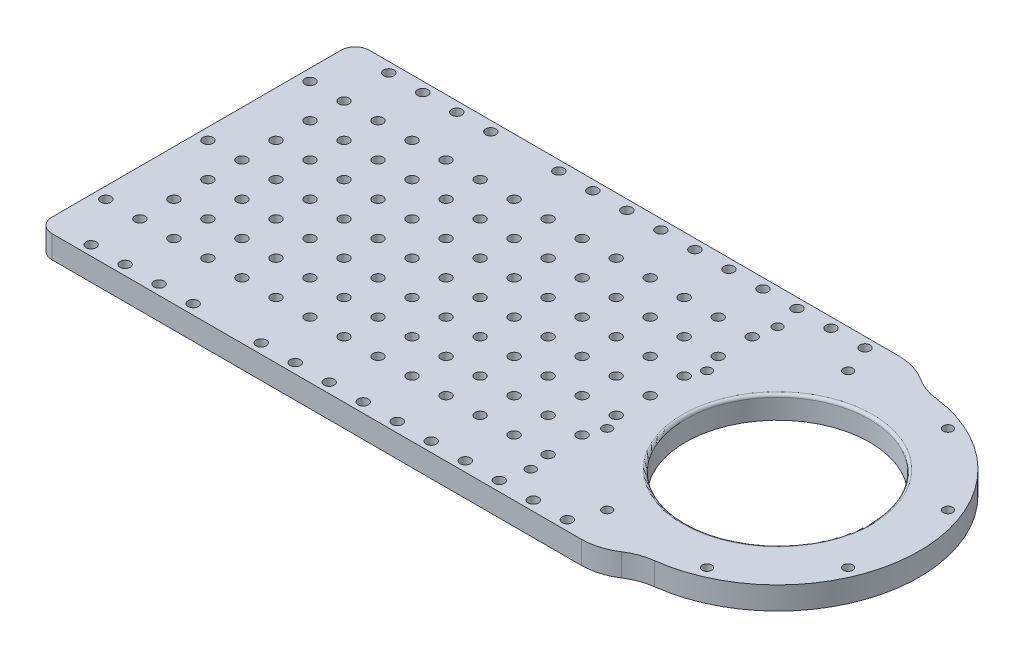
ISO-10303-21;
HEADER;
FILE_DESCRIPTION(('STEP AP214'),'2;1');
FILE_NAME('part.step','',(''),(''),'','','');
FILE_SCHEMA(('AUTOMOTIVE_DESIGN { 1 0 10303 214 1 1 1 1 }'));
ENDSEC;
DATA;
#1=APPLICATION_CONTEXT('core data for automotive mechanical design processes');
#2=APPLICATION_PROTOCOL_DEFINITION('international standard','automotive_design',2000,#1);
#3=PRODUCT_CONTEXT('',#1,'mechanical');
#4=PRODUCT('Part','Part','',(#3));
#5=PRODUCT_RELATED_PRODUCT_CATEGORY('part','',(#4));
#6=PRODUCT_DEFINITION_FORMATION('','',#4);
#7=PRODUCT_DEFINITION_CONTEXT('part definition',#1,'design');
#8=PRODUCT_DEFINITION('design','',#6,#7);
#9=PRODUCT_DEFINITION_SHAPE('','',#8);
#10=(LENGTH_UNIT() NAMED_UNIT(*) SI_UNIT(.MILLI.,.METRE.));
#11=(NAMED_UNIT(*) PLANE_ANGLE_UNIT() SI_UNIT($,.RADIAN.));
#12=(NAMED_UNIT(*) SI_UNIT($,.STERADIAN.) SOLID_ANGLE_UNIT());
#13=UNCERTAINTY_MEASURE_WITH_UNIT(LENGTH_MEASURE(1.E-05),#10,'distance_accuracy_value','');
#14=(GEOMETRIC_REPRESENTATION_CONTEXT(3) GLOBAL_UNCERTAINTY_ASSIGNED_CONTEXT((#13)) GLOBAL_UNIT_ASSIGNED_CONTEXT((#10,
#11,#12)) REPRESENTATION_CONTEXT('',''));
#15=CARTESIAN_POINT('',(0.,0.,0.));
#16=DIRECTION('',(0.,0.,1.));
#17=DIRECTION('',(1.,0.,0.));
#18=AXIS2_PLACEMENT_3D('',#15,#16,#17);
#19=CARTESIAN_POINT('',(0.,8.,0.));
#20=DIRECTION('',(0.,1.,0.));
#21=DIRECTION('',(0.,0.,1.));
#22=AXIS2_PLACEMENT_3D('',#19,#20,#21);
#23=PLANE('',#22);
#24=CARTESIAN_POINT('',(88.,8.,-23.9999999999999));
#25=DIRECTION('',(0.,1.,0.));
#26=DIRECTION('',(0.,0.,1.));
#27=AXIS2_PLACEMENT_3D('',#24,#25,#26);
#28=CIRCLE('',#27,1.79999999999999);
#29=CARTESIAN_POINT('',(88.,8.,-22.1999999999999));
#30=VERTEX_POINT('',#29);
#31=EDGE_CURVE('E2907',#30,#30,#28,.T.);
#32=ORIENTED_EDGE('',*,*,#31,.F.);
#33=EDGE_LOOP('',(#32));
#34=FACE_BOUND('',#33,.T.);
#35=CARTESIAN_POINT('',(76.,8.,-23.9999999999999));
#36=DIRECTION('',(0.,1.,0.));
#37=DIRECTION('',(0.,0.,1.));
#38=AXIS2_PLACEMENT_3D('',#35,#36,#37);
#39=CIRCLE('',#38,1.79999999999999);
#40=CARTESIAN_POINT('',(76.,8.,-22.1999999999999));
#41=VERTEX_POINT('',#40);
#42=EDGE_CURVE('E2901',#41,#41,#39,.T.);
#43=ORIENTED_EDGE('',*,*,#42,.F.);
#44=EDGE_LOOP('',(#43));
#45=FACE_BOUND('',#44,.T.);
#46=CARTESIAN_POINT('',(-19.9999999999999,8.,-11.9999999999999));
#47=DIRECTION('',(0.,1.,0.));
#48=DIRECTION('',(0.,0.,1.));
#49=AXIS2_PLACEMENT_3D('',#46,#47,#48);
#50=CIRCLE('',#49,1.8);
#51=CARTESIAN_POINT('',(-19.9999999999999,8.,-10.1999999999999));
#52=VERTEX_POINT('',#51);
#53=EDGE_CURVE('E2506',#52,#52,#50,.T.);
#54=ORIENTED_EDGE('',*,*,#53,.F.);
#55=EDGE_LOOP('',(#54));
#56=FACE_BOUND('',#55,.T.);
#57=CARTESIAN_POINT('',(100.,8.,-23.9999999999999));
#58=DIRECTION('',(0.,1.,0.));
#59=DIRECTION('',(0.,0.,1.));
#60=AXIS2_PLACEMENT_3D('',#57,#58,#59);
#61=CIRCLE('',#60,1.79999999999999);
#62=CARTESIAN_POINT('',(100.,8.,-22.1999999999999));
#63=VERTEX_POINT('',#62);
#64=EDGE_CURVE('E2902',#63,#63,#61,.T.);
#65=ORIENTED_EDGE('',*,*,#64,.F.);
#66=EDGE_LOOP('',(#65));
#67=FACE_BOUND('',#66,.T.);
#68=CARTESIAN_POINT('',(16.0000000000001,8.,-11.9999999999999));
#69=DIRECTION('',(0.,1.,0.));
#70=DIRECTION('',(0.,0.,1.));
#71=AXIS2_PLACEMENT_3D('',#68,#69,#70);
#72=CIRCLE('',#71,1.8);
#73=CARTESIAN_POINT('',(16.0000000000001,8.,-10.1999999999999));
#74=VERTEX_POINT('',#73);
#75=EDGE_CURVE('E2917',#74,#74,#72,.T.);
#76=ORIENTED_EDGE('',*,*,#75,.F.);
#77=EDGE_LOOP('',(#76));
#78=FACE_BOUND('',#77,.T.);
#79=CARTESIAN_POINT('',(-7.99999999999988,8.,-11.9999999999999));
#80=DIRECTION('',(0.,1.,0.));
#81=DIRECTION('',(0.,0.,1.));
#82=AXIS2_PLACEMENT_3D('',#79,#80,#81);
#83=CIRCLE('',#82,1.8);
#84=CARTESIAN_POINT('',(-7.99999999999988,8.,-10.1999999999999));
#85=VERTEX_POINT('',#84);
#86=EDGE_CURVE('E2924',#85,#85,#83,.T.);
#87=ORIENTED_EDGE('',*,*,#86,.F.);
#88=EDGE_LOOP('',(#87));
#89=FACE_BOUND('',#88,.T.);
#90=CARTESIAN_POINT('',(4.00000000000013,8.,-11.9999999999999));
#91=DIRECTION('',(0.,1.,0.));
#92=DIRECTION('',(0.,0.,1.));
#93=AXIS2_PLACEMENT_3D('',#90,#91,#92);
#94=CIRCLE('',#93,1.8);
#95=CARTESIAN_POINT('',(4.00000000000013,8.,-10.1999999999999));
#96=VERTEX_POINT('',#95);
#97=EDGE_CURVE('E2919',#96,#96,#94,.T.);
#98=ORIENTED_EDGE('',*,*,#97,.F.);
#99=EDGE_LOOP('',(#98));
#100=FACE_BOUND('',#99,.T.);
#101=CARTESIAN_POINT('',(4.00000000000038,8.,12.0000000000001));
#102=DIRECTION('',(0.,1.,0.));
#103=DIRECTION('',(0.,0.,1.));
#104=AXIS2_PLACEMENT_3D('',#101,#102,#103);
#105=CIRCLE('',#104,1.8);
#106=CARTESIAN_POINT('',(4.00000000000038,8.,13.8000000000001));
#107=VERTEX_POINT('',#106);
#108=EDGE_CURVE('E3259',#107,#107,#105,.T.);
#109=ORIENTED_EDGE('',*,*,#108,.F.);
#110=EDGE_LOOP('',(#109));
#111=FACE_BOUND('',#110,.T.);
#112=CARTESIAN_POINT('',(-7.99999999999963,8.,12.0000000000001));
#113=DIRECTION('',(0.,1.,0.));
#114=DIRECTION('',(0.,0.,1.));
#115=AXIS2_PLACEMENT_3D('',#112,#113,#114);
#116=CIRCLE('',#115,1.8);
#117=CARTESIAN_POINT('',(-7.99999999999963,8.,13.8000000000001));
#118=VERTEX_POINT('',#117);
#119=EDGE_CURVE('E3264',#118,#118,#116,.T.);
#120=ORIENTED_EDGE('',*,*,#119,.F.);
#121=EDGE_LOOP('',(#120));
#122=FACE_BOUND('',#121,.T.);
#123=CARTESIAN_POINT('',(-7.9999999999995,8.,24.0000000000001));
#124=DIRECTION('',(0.,1.,0.));
#125=DIRECTION('',(0.,0.,1.));
#126=AXIS2_PLACEMENT_3D('',#123,#124,#125);
#127=CIRCLE('',#126,1.8);
#128=CARTESIAN_POINT('',(-7.9999999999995,8.,25.8000000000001));
#129=VERTEX_POINT('',#128);
#130=EDGE_CURVE('E3255',#129,#129,#127,.T.);
#131=ORIENTED_EDGE('',*,*,#130,.F.);
#132=EDGE_LOOP('',(#131));
#133=FACE_BOUND('',#132,.T.);
#134=CARTESIAN_POINT('',(76.0000000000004,8.,12.0000000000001));
#135=DIRECTION('',(0.,1.,0.));
#136=DIRECTION('',(0.,0.,1.));
#137=AXIS2_PLACEMENT_3D('',#134,#135,#136);
#138=CIRCLE('',#137,1.79999999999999);
#139=CARTESIAN_POINT('',(76.0000000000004,8.,13.8000000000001));
#140=VERTEX_POINT('',#139);
#141=EDGE_CURVE('E3240',#140,#140,#138,.T.);
#142=ORIENTED_EDGE('',*,*,#141,.F.);
#143=EDGE_LOOP('',(#142));
#144=FACE_BOUND('',#143,.T.);
#145=CARTESIAN_POINT('',(4.0000000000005,8.,24.0000000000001));
#146=DIRECTION('',(0.,1.,0.));
#147=DIRECTION('',(0.,0.,1.));
#148=AXIS2_PLACEMENT_3D('',#145,#146,#147);
#149=CIRCLE('',#148,1.8);
#150=CARTESIAN_POINT('',(4.0000000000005,8.,25.8000000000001));
#151=VERTEX_POINT('',#150);
#152=EDGE_CURVE('E3243',#151,#151,#149,.T.);
#153=ORIENTED_EDGE('',*,*,#152,.F.);
#154=EDGE_LOOP('',(#153));
#155=FACE_BOUND('',#154,.T.);
#156=CARTESIAN_POINT('',(16.0000000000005,8.,24.0000000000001));
#157=DIRECTION('',(0.,1.,0.));
#158=DIRECTION('',(0.,0.,1.));
#159=AXIS2_PLACEMENT_3D('',#156,#157,#158);
#160=CIRCLE('',#159,1.8);
#161=CARTESIAN_POINT('',(16.0000000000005,8.,25.8000000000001));
#162=VERTEX_POINT('',#161);
#163=EDGE_CURVE('E3247',#162,#162,#160,.T.);
#164=ORIENTED_EDGE('',*,*,#163,.F.);
#165=EDGE_LOOP('',(#164));
#166=FACE_BOUND('',#165,.T.);
#167=CARTESIAN_POINT('',(-19.9999999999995,8.,24.0000000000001));
#168=DIRECTION('',(0.,1.,0.));
#169=DIRECTION('',(0.,0.,1.));
#170=AXIS2_PLACEMENT_3D('',#167,#168,#169);
#171=CIRCLE('',#170,1.8);
#172=CARTESIAN_POINT('',(-19.9999999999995,8.,25.8000000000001));
#173=VERTEX_POINT('',#172);
#174=EDGE_CURVE('E3251',#173,#173,#171,.T.);
#175=ORIENTED_EDGE('',*,*,#174,.F.);
#176=EDGE_LOOP('',(#175));
#177=FACE_BOUND('',#176,.T.);
#178=CARTESIAN_POINT('',(-19.9999999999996,8.,12.0000000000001));
#179=DIRECTION('',(0.,1.,0.));
#180=DIRECTION('',(0.,0.,1.));
#181=AXIS2_PLACEMENT_3D('',#178,#179,#180);
#182=CIRCLE('',#181,1.8);
#183=CARTESIAN_POINT('',(-19.9999999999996,8.,13.8000000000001));
#184=VERTEX_POINT('',#183);
#185=EDGE_CURVE('E3263',#184,#184,#182,.T.);
#186=ORIENTED_EDGE('',*,*,#185,.F.);
#187=EDGE_LOOP('',(#186));
#188=FACE_BOUND('',#187,.T.);
#189=CARTESIAN_POINT('',(52.0000000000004,8.,12.0000000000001));
#190=DIRECTION('',(0.,1.,0.));
#191=DIRECTION('',(0.,0.,1.));
#192=AXIS2_PLACEMENT_3D('',#189,#190,#191);
#193=CIRCLE('',#192,1.8);
#194=CARTESIAN_POINT('',(52.0000000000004,8.,13.8000000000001));
#195=VERTEX_POINT('',#194);
#196=EDGE_CURVE('E2913',#195,#195,#193,.T.);
#197=ORIENTED_EDGE('',*,*,#196,.F.);
#198=EDGE_LOOP('',(#197));
#199=FACE_BOUND('',#198,.T.);
#200=CARTESIAN_POINT('',(16.0000000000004,8.,12.0000000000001));
#201=DIRECTION('',(0.,1.,0.));
#202=DIRECTION('',(0.,0.,1.));
#203=AXIS2_PLACEMENT_3D('',#200,#201,#202);
#204=CIRCLE('',#203,1.8);
#205=CARTESIAN_POINT('',(16.0000000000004,8.,13.8000000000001));
#206=VERTEX_POINT('',#205);
#207=EDGE_CURVE('E2910',#206,#206,#204,.T.);
#208=ORIENTED_EDGE('',*,*,#207,.F.);
#209=EDGE_LOOP('',(#208));
#210=FACE_BOUND('',#209,.T.);
#211=CARTESIAN_POINT('',(100.000000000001,8.,24.0000000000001));
#212=DIRECTION('',(0.,1.,0.));
#213=DIRECTION('',(0.,0.,1.));
#214=AXIS2_PLACEMENT_3D('',#211,#212,#213);
#215=CIRCLE('',#214,1.79999999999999);
#216=CARTESIAN_POINT('',(100.000000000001,8.,25.8000000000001));
#217=VERTEX_POINT('',#216);
#218=EDGE_CURVE('E2959',#217,#217,#215,.T.);
#219=ORIENTED_EDGE('',*,*,#218,.F.);
#220=EDGE_LOOP('',(#219));
#221=FACE_BOUND('',#220,.T.);
#222=CARTESIAN_POINT('',(76.0000000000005,8.,24.0000000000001));
#223=DIRECTION('',(0.,1.,0.));
#224=DIRECTION('',(0.,0.,1.));
#225=AXIS2_PLACEMENT_3D('',#222,#223,#224);
#226=CIRCLE('',#225,1.79999999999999);
#227=CARTESIAN_POINT('',(76.0000000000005,8.,25.8000000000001));
#228=VERTEX_POINT('',#227);
#229=EDGE_CURVE('E2966',#228,#228,#226,.T.);
#230=ORIENTED_EDGE('',*,*,#229,.F.);
#231=EDGE_LOOP('',(#230));
#232=FACE_BOUND('',#231,.T.);
#233=CARTESIAN_POINT('',(88.0000000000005,8.,24.0000000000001));
#234=DIRECTION('',(0.,1.,0.));
#235=DIRECTION('',(0.,0.,1.));
#236=AXIS2_PLACEMENT_3D('',#233,#234,#235);
#237=CIRCLE('',#236,1.79999999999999);
#238=CARTESIAN_POINT('',(88.0000000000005,8.,25.8000000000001));
#239=VERTEX_POINT('',#238);
#240=EDGE_CURVE('E2967',#239,#239,#237,.T.);
#241=ORIENTED_EDGE('',*,*,#240,.F.);
#242=EDGE_LOOP('',(#241));
#243=FACE_BOUND('',#242,.T.);
#244=CARTESIAN_POINT('',(64.0000000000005,8.,24.0000000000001));
#245=DIRECTION('',(0.,1.,0.));
#246=DIRECTION('',(0.,0.,1.));
#247=AXIS2_PLACEMENT_3D('',#244,#245,#246);
#248=CIRCLE('',#247,1.79999999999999);
#249=CARTESIAN_POINT('',(64.0000000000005,8.,25.8000000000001));
#250=VERTEX_POINT('',#249);
#251=EDGE_CURVE('E2955',#250,#250,#248,.T.);
#252=ORIENTED_EDGE('',*,*,#251,.F.);
#253=EDGE_LOOP('',(#252));
#254=FACE_BOUND('',#253,.T.);
#255=CARTESIAN_POINT('',(52.0000000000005,8.,24.0000000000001));
#256=DIRECTION('',(0.,1.,0.));
#257=DIRECTION('',(0.,0.,1.));
#258=AXIS2_PLACEMENT_3D('',#255,#256,#257);
#259=CIRCLE('',#258,1.8);
#260=CARTESIAN_POINT('',(52.0000000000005,8.,25.8000000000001));
#261=VERTEX_POINT('',#260);
#262=EDGE_CURVE('E2935',#261,#261,#259,.T.);
#263=ORIENTED_EDGE('',*,*,#262,.F.);
#264=EDGE_LOOP('',(#263));
#265=FACE_BOUND('',#264,.T.);
#266=CARTESIAN_POINT('',(-31.9999999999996,8.,12.0000000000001));
#267=DIRECTION('',(0.,1.,0.));
#268=DIRECTION('',(0.,0.,1.));
#269=AXIS2_PLACEMENT_3D('',#266,#267,#268);
#270=CIRCLE('',#269,1.8);
#271=CARTESIAN_POINT('',(-31.9999999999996,8.,13.8000000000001));
#272=VERTEX_POINT('',#271);
#273=EDGE_CURVE('E608',#272,#272,#270,.T.);
#274=ORIENTED_EDGE('',*,*,#273,.F.);
#275=EDGE_LOOP('',(#274));
#276=FACE_BOUND('',#275,.T.);
#277=CARTESIAN_POINT('',(-31.9999999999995,8.,24.0000000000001));
#278=DIRECTION('',(0.,1.,0.));
#279=DIRECTION('',(0.,0.,1.));
#280=AXIS2_PLACEMENT_3D('',#277,#278,#279);
#281=CIRCLE('',#280,1.8);
#282=CARTESIAN_POINT('',(-31.9999999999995,8.,25.8000000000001));
#283=VERTEX_POINT('',#282);
#284=EDGE_CURVE('E2979',#283,#283,#281,.T.);
#285=ORIENTED_EDGE('',*,*,#284,.F.);
#286=EDGE_LOOP('',(#285));
#287=FACE_BOUND('',#286,.T.);
#288=CARTESIAN_POINT('',(-31.9999999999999,8.,-11.9999999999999));
#289=DIRECTION('',(0.,1.,0.));
#290=DIRECTION('',(0.,0.,1.));
#291=AXIS2_PLACEMENT_3D('',#288,#289,#290);
#292=CIRCLE('',#291,1.8);
#293=CARTESIAN_POINT('',(-31.9999999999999,8.,-10.1999999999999));
#294=VERTEX_POINT('',#293);
#295=EDGE_CURVE('E2975',#294,#294,#292,.T.);
#296=ORIENTED_EDGE('',*,*,#295,.F.);
#297=EDGE_LOOP('',(#296));
#298=FACE_BOUND('',#297,.T.);
#299=CARTESIAN_POINT('',(-32.,8.,-23.9999999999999));
#300=DIRECTION('',(0.,1.,0.));
#301=DIRECTION('',(0.,0.,1.));
#302=AXIS2_PLACEMENT_3D('',#299,#300,#301);
#303=CIRCLE('',#302,1.8);
#304=CARTESIAN_POINT('',(-32.,8.,-22.1999999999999));
#305=VERTEX_POINT('',#304);
#306=EDGE_CURVE('E2971',#305,#305,#303,.T.);
#307=ORIENTED_EDGE('',*,*,#306,.F.);
#308=EDGE_LOOP('',(#307));
#309=FACE_BOUND('',#308,.T.);
#310=CARTESIAN_POINT('',(64.,8.,-23.9999999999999));
#311=DIRECTION('',(0.,1.,0.));
#312=DIRECTION('',(0.,0.,1.));
#313=AXIS2_PLACEMENT_3D('',#310,#311,#312);
#314=CIRCLE('',#313,1.79999999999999);
#315=CARTESIAN_POINT('',(64.,8.,-22.1999999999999));
#316=VERTEX_POINT('',#315);
#317=EDGE_CURVE('E2931',#316,#316,#314,.T.);
#318=ORIENTED_EDGE('',*,*,#317,.F.);
#319=EDGE_LOOP('',(#318));
#320=FACE_BOUND('',#319,.T.);
#321=CARTESIAN_POINT('',(52.,8.,-23.9999999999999));
#322=DIRECTION('',(0.,1.,0.));
#323=DIRECTION('',(0.,0.,1.));
#324=AXIS2_PLACEMENT_3D('',#321,#322,#323);
#325=CIRCLE('',#324,1.8);
#326=CARTESIAN_POINT('',(52.,8.,-22.1999999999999));
#327=VERTEX_POINT('',#326);
#328=EDGE_CURVE('E2936',#327,#327,#325,.T.);
#329=ORIENTED_EDGE('',*,*,#328,.F.);
#330=EDGE_LOOP('',(#329));
#331=FACE_BOUND('',#330,.T.);
#332=CARTESIAN_POINT('',(-8.,8.,-23.9999999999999));
#333=DIRECTION('',(0.,1.,0.));
#334=DIRECTION('',(0.,0.,1.));
#335=AXIS2_PLACEMENT_3D('',#332,#333,#334);
#336=CIRCLE('',#335,1.8);
#337=CARTESIAN_POINT('',(-8.,8.,-22.1999999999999));
#338=VERTEX_POINT('',#337);
#339=EDGE_CURVE('E2940',#338,#338,#336,.T.);
#340=ORIENTED_EDGE('',*,*,#339,.F.);
#341=EDGE_LOOP('',(#340));
#342=FACE_BOUND('',#341,.T.);
#343=CARTESIAN_POINT('',(-20.,8.,-23.9999999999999));
#344=DIRECTION('',(0.,1.,0.));
#345=DIRECTION('',(0.,0.,1.));
#346=AXIS2_PLACEMENT_3D('',#343,#344,#345);
#347=CIRCLE('',#346,1.8);
#348=CARTESIAN_POINT('',(-20.,8.,-22.1999999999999));
#349=VERTEX_POINT('',#348);
#350=EDGE_CURVE('E2944',#349,#349,#347,.T.);
#351=ORIENTED_EDGE('',*,*,#350,.F.);
#352=EDGE_LOOP('',(#351));
#353=FACE_BOUND('',#352,.T.);
#354=CARTESIAN_POINT('',(16.,8.,-23.9999999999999));
#355=DIRECTION('',(0.,1.,0.));
#356=DIRECTION('',(0.,0.,1.));
#357=AXIS2_PLACEMENT_3D('',#354,#355,#356);
#358=CIRCLE('',#357,1.8);
#359=CARTESIAN_POINT('',(16.,8.,-22.1999999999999));
#360=VERTEX_POINT('',#359);
#361=EDGE_CURVE('E2948',#360,#360,#358,.T.);
#362=ORIENTED_EDGE('',*,*,#361,.F.);
#363=EDGE_LOOP('',(#362));
#364=FACE_BOUND('',#363,.T.);
#365=CARTESIAN_POINT('',(4.,8.,-23.9999999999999));
#366=DIRECTION('',(0.,1.,0.));
#367=DIRECTION('',(0.,0.,1.));
#368=AXIS2_PLACEMENT_3D('',#365,#366,#367);
#369=CIRCLE('',#368,1.8);
#370=CARTESIAN_POINT('',(4.,8.,-22.1999999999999));
#371=VERTEX_POINT('',#370);
#372=EDGE_CURVE('E2923',#371,#371,#369,.T.);
#373=ORIENTED_EDGE('',*,*,#372,.F.);
#374=EDGE_LOOP('',(#373));
#375=FACE_BOUND('',#374,.T.);
#376=CARTESIAN_POINT('',(88.0000000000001,8.,-11.9999999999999));
#377=DIRECTION('',(0.,1.,0.));
#378=DIRECTION('',(0.,0.,1.));
#379=AXIS2_PLACEMENT_3D('',#376,#377,#378);
#380=CIRCLE('',#379,1.79999999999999);
#381=CARTESIAN_POINT('',(88.0000000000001,8.,-10.1999999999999));
#382=VERTEX_POINT('',#381);
#383=EDGE_CURVE('E3009',#382,#382,#380,.T.);
#384=ORIENTED_EDGE('',*,*,#383,.F.);
#385=EDGE_LOOP('',(#384));
#386=FACE_BOUND('',#385,.T.);
#387=CARTESIAN_POINT('',(52.0000000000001,8.,-11.9999999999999));
#388=DIRECTION('',(0.,1.,0.));
#389=DIRECTION('',(0.,0.,1.));
#390=AXIS2_PLACEMENT_3D('',#387,#388,#389);
#391=CIRCLE('',#390,1.8);
#392=CARTESIAN_POINT('',(52.0000000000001,8.,-10.1999999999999));
#393=VERTEX_POINT('',#392);
#394=EDGE_CURVE('E3013',#393,#393,#391,.T.);
#395=ORIENTED_EDGE('',*,*,#394,.F.);
#396=EDGE_LOOP('',(#395));
#397=FACE_BOUND('',#396,.T.);
#398=CARTESIAN_POINT('',(64.0000000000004,8.,12.0000000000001));
#399=DIRECTION('',(0.,1.,0.));
#400=DIRECTION('',(0.,0.,1.));
#401=AXIS2_PLACEMENT_3D('',#398,#399,#400);
#402=CIRCLE('',#401,1.79999999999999);
#403=CARTESIAN_POINT('',(64.0000000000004,8.,13.8000000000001));
#404=VERTEX_POINT('',#403);
#405=EDGE_CURVE('E3017',#404,#404,#402,.T.);
#406=ORIENTED_EDGE('',*,*,#405,.F.);
#407=EDGE_LOOP('',(#406));
#408=FACE_BOUND('',#407,.T.);
#409=CARTESIAN_POINT('',(100.,8.,12.0000000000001));
#410=DIRECTION('',(0.,1.,0.));
#411=DIRECTION('',(0.,0.,1.));
#412=AXIS2_PLACEMENT_3D('',#409,#410,#411);
#413=CIRCLE('',#412,1.79999999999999);
#414=CARTESIAN_POINT('',(100.,8.,13.8000000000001));
#415=VERTEX_POINT('',#414);
#416=EDGE_CURVE('E3021',#415,#415,#413,.T.);
#417=ORIENTED_EDGE('',*,*,#416,.F.);
#418=EDGE_LOOP('',(#417));
#419=FACE_BOUND('',#418,.T.);
#420=CARTESIAN_POINT('',(88.0000000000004,8.,12.0000000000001));
#421=DIRECTION('',(0.,1.,0.));
#422=DIRECTION('',(0.,0.,1.));
#423=AXIS2_PLACEMENT_3D('',#420,#421,#422);
#424=CIRCLE('',#423,1.79999999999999);
#425=CARTESIAN_POINT('',(88.0000000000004,8.,13.8000000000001));
#426=VERTEX_POINT('',#425);
#427=EDGE_CURVE('E3025',#426,#426,#424,.T.);
#428=ORIENTED_EDGE('',*,*,#427,.F.);
#429=EDGE_LOOP('',(#428));
#430=FACE_BOUND('',#429,.T.);
#431=CARTESIAN_POINT('',(100.,8.,-11.9999999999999));
#432=DIRECTION('',(0.,1.,0.));
#433=DIRECTION('',(0.,0.,1.));
#434=AXIS2_PLACEMENT_3D('',#431,#432,#433);
#435=CIRCLE('',#434,1.79999999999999);
#436=CARTESIAN_POINT('',(100.,8.,-10.1999999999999));
#437=VERTEX_POINT('',#436);
#438=EDGE_CURVE('E3029',#437,#437,#435,.T.);
#439=ORIENTED_EDGE('',*,*,#438,.F.);
#440=EDGE_LOOP('',(#439));
#441=FACE_BOUND('',#440,.T.);
#442=CARTESIAN_POINT('',(76.0000000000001,8.,-11.9999999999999));
#443=DIRECTION('',(0.,1.,0.));
#444=DIRECTION('',(0.,0.,1.));
#445=AXIS2_PLACEMENT_3D('',#442,#443,#444);
#446=CIRCLE('',#445,1.79999999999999);
#447=CARTESIAN_POINT('',(76.0000000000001,8.,-10.1999999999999));
#448=VERTEX_POINT('',#447);
#449=EDGE_CURVE('E3033',#448,#448,#446,.T.);
#450=ORIENTED_EDGE('',*,*,#449,.F.);
#451=EDGE_LOOP('',(#450));
#452=FACE_BOUND('',#451,.T.);
#453=CARTESIAN_POINT('',(64.0000000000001,8.,-11.9999999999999));
#454=DIRECTION('',(0.,1.,0.));
#455=DIRECTION('',(0.,0.,1.));
#456=AXIS2_PLACEMENT_3D('',#453,#454,#455);
#457=CIRCLE('',#456,1.79999999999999);
#458=CARTESIAN_POINT('',(64.0000000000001,8.,-10.1999999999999));
#459=VERTEX_POINT('',#458);
#460=EDGE_CURVE('E3037',#459,#459,#457,.T.);
#461=ORIENTED_EDGE('',*,*,#460,.F.);
#462=EDGE_LOOP('',(#461));
#463=FACE_BOUND('',#462,.T.);
#464=CARTESIAN_POINT('',(156.937829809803,8.,0.));
#465=DIRECTION('',(0.,1.,0.));
#466=DIRECTION('',(0.,0.,1.));
#467=AXIS2_PLACEMENT_3D('',#464,#465,#466);
#468=CIRCLE('',#467,33.5);
#469=CARTESIAN_POINT('',(156.937829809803,8.,33.5));
#470=VERTEX_POINT('',#469);
#471=EDGE_CURVE('E11',#470,#470,#468,.F.);
#472=ORIENTED_EDGE('',*,*,#471,.T.);
#473=EDGE_LOOP('',(#472));
#474=FACE_BOUND('',#473,.T.);
#475=CARTESIAN_POINT('',(3.28161127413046,8.,52.5));
#476=DIRECTION('',(0.,-1.,0.));
#477=DIRECTION('',(0.,0.,-1.));
#478=AXIS2_PLACEMENT_3D('',#475,#476,#477);
#479=CIRCLE('',#478,1.8);
#480=CARTESIAN_POINT('',(3.28161127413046,8.,50.7));
#481=VERTEX_POINT('',#480);
#482=EDGE_CURVE('E1120',#481,#481,#479,.T.);
#483=ORIENTED_EDGE('',*,*,#482,.T.);
#484=EDGE_LOOP('',(#483));
#485=FACE_BOUND('',#484,.T.);
#486=CARTESIAN_POINT('',(-20.7183887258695,8.,52.5));
#487=DIRECTION('',(0.,-1.,0.));
#488=DIRECTION('',(0.,0.,-1.));
#489=AXIS2_PLACEMENT_3D('',#486,#487,#488);
#490=CIRCLE('',#489,1.8);
#491=CARTESIAN_POINT('',(-20.7183887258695,8.,50.7));
#492=VERTEX_POINT('',#491);
#493=EDGE_CURVE('E1119',#492,#492,#490,.T.);
#494=ORIENTED_EDGE('',*,*,#493,.T.);
#495=EDGE_LOOP('',(#494));
#496=FACE_BOUND('',#495,.T.);
#497=CARTESIAN_POINT('',(27.2816112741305,8.,52.5));
#498=DIRECTION('',(0.,-1.,0.));
#499=DIRECTION('',(0.,0.,-1.));
#500=AXIS2_PLACEMENT_3D('',#497,#498,#499);
#501=CIRCLE('',#500,1.8);
#502=CARTESIAN_POINT('',(27.2816112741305,8.,50.7));
#503=VERTEX_POINT('',#502);
#504=EDGE_CURVE('E1124',#503,#503,#501,.T.);
#505=ORIENTED_EDGE('',*,*,#504,.T.);
#506=EDGE_LOOP('',(#505));
#507=FACE_BOUND('',#506,.T.);
#508=CARTESIAN_POINT('',(75.2816112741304,8.,52.5));
#509=DIRECTION('',(0.,-1.,0.));
#510=DIRECTION('',(0.,0.,-1.));
#511=AXIS2_PLACEMENT_3D('',#508,#509,#510);
#512=CIRCLE('',#511,1.79999999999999);
#513=CARTESIAN_POINT('',(75.2816112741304,8.,50.7));
#514=VERTEX_POINT('',#513);
#515=EDGE_CURVE('E1151',#514,#514,#512,.T.);
#516=ORIENTED_EDGE('',*,*,#515,.T.);
#517=EDGE_LOOP('',(#516));
#518=FACE_BOUND('',#517,.T.);
#519=CARTESIAN_POINT('',(99.2816112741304,8.,52.5));
#520=DIRECTION('',(0.,-1.,0.));
#521=DIRECTION('',(0.,0.,-1.));
#522=AXIS2_PLACEMENT_3D('',#519,#520,#521);
#523=CIRCLE('',#522,1.79999999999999);
#524=CARTESIAN_POINT('',(99.2816112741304,8.,50.7));
#525=VERTEX_POINT('',#524);
#526=EDGE_CURVE('E1143',#525,#525,#523,.T.);
#527=ORIENTED_EDGE('',*,*,#526,.T.);
#528=EDGE_LOOP('',(#527));
#529=FACE_BOUND('',#528,.T.);
#530=CARTESIAN_POINT('',(123.28161127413,8.,52.5));
#531=DIRECTION('',(0.,-1.,0.));
#532=DIRECTION('',(0.,0.,-1.));
#533=AXIS2_PLACEMENT_3D('',#530,#531,#532);
#534=CIRCLE('',#533,1.80000000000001);
#535=CARTESIAN_POINT('',(123.28161127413,8.,50.7));
#536=VERTEX_POINT('',#535);
#537=EDGE_CURVE('E1135',#536,#536,#534,.T.);
#538=ORIENTED_EDGE('',*,*,#537,.T.);
#539=EDGE_LOOP('',(#538));
#540=FACE_BOUND('',#539,.T.);
#541=CARTESIAN_POINT('',(51.2816112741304,8.,52.5));
#542=DIRECTION('',(0.,-1.,0.));
#543=DIRECTION('',(0.,0.,-1.));
#544=AXIS2_PLACEMENT_3D('',#541,#542,#543);
#545=CIRCLE('',#544,1.8);
#546=CARTESIAN_POINT('',(51.2816112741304,8.,50.7));
#547=VERTEX_POINT('',#546);
#548=EDGE_CURVE('E1052',#547,#547,#545,.T.);
#549=ORIENTED_EDGE('',*,*,#548,.T.);
#550=EDGE_LOOP('',(#549));
#551=FACE_BOUND('',#550,.T.);
#552=CARTESIAN_POINT('',(113.400785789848,8.,-43.5370440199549));
#553=DIRECTION('',(0.,1.,0.));
#554=DIRECTION('',(0.,0.,1.));
#555=AXIS2_PLACEMENT_3D('',#552,#553,#554);
#556=CIRCLE('',#555,1.65);
#557=CARTESIAN_POINT('',(113.400785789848,8.,-41.8870440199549));
#558=VERTEX_POINT('',#557);
#559=EDGE_CURVE('E236',#558,#558,#556,.T.);
#560=ORIENTED_EDGE('',*,*,#559,.F.);
#561=EDGE_LOOP('',(#560));
#562=FACE_BOUND('',#561,.T.);
#563=CARTESIAN_POINT('',(114.437947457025,8.,17.6));
#564=DIRECTION('',(0.,1.,0.));
#565=DIRECTION('',(0.,0.,1.));
#566=AXIS2_PLACEMENT_3D('',#563,#564,#565);
#567=CIRCLE('',#566,1.65000000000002);
#568=CARTESIAN_POINT('',(114.437947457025,8.,19.25));
#569=VERTEX_POINT('',#568);
#570=EDGE_CURVE('E202',#569,#569,#567,.T.);
#571=ORIENTED_EDGE('',*,*,#570,.F.);
#572=EDGE_LOOP('',(#571));
#573=FACE_BOUND('',#572,.T.);
#574=CARTESIAN_POINT('',(199.437712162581,8.,-17.6));
#575=DIRECTION('',(0.,1.,0.));
#576=DIRECTION('',(0.,0.,1.));
#577=AXIS2_PLACEMENT_3D('',#574,#575,#576);
#578=CIRCLE('',#577,1.65000000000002);
#579=CARTESIAN_POINT('',(199.437712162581,8.,-15.95));
#580=VERTEX_POINT('',#579);
#581=EDGE_CURVE('E240',#580,#580,#578,.T.);
#582=ORIENTED_EDGE('',*,*,#581,.F.);
#583=EDGE_LOOP('',(#582));
#584=FACE_BOUND('',#583,.T.);
#585=CARTESIAN_POINT('',(199.434864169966,8.,17.6068756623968));
#586=DIRECTION('',(0.,1.,0.));
#587=DIRECTION('',(0.,0.,1.));
#588=AXIS2_PLACEMENT_3D('',#585,#586,#587);
#589=CIRCLE('',#588,1.65000000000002);
#590=CARTESIAN_POINT('',(199.434864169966,8.,19.2568756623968));
#591=VERTEX_POINT('',#590);
#592=EDGE_CURVE('E1173',#591,#591,#589,.T.);
#593=ORIENTED_EDGE('',*,*,#592,.F.);
#594=EDGE_LOOP('',(#593));
#595=FACE_BOUND('',#594,.T.);
#596=CARTESIAN_POINT('',(174.537829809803,8.,42.4998823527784));
#597=DIRECTION('',(0.,1.,0.));
#598=DIRECTION('',(0.,0.,1.));
#599=AXIS2_PLACEMENT_3D('',#596,#597,#598);
#600=CIRCLE('',#599,1.65000000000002);
#601=CARTESIAN_POINT('',(174.537829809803,8.,44.1498823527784));
#602=VERTEX_POINT('',#601);
#603=EDGE_CURVE('E1168',#602,#602,#600,.T.);
#604=ORIENTED_EDGE('',*,*,#603,.F.);
#605=EDGE_LOOP('',(#604));
#606=FACE_BOUND('',#605,.T.);
#607=CARTESIAN_POINT('',(114.44079544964,8.,-17.6068756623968));
#608=DIRECTION('',(0.,1.,0.));
#609=DIRECTION('',(0.,0.,1.));
#610=AXIS2_PLACEMENT_3D('',#607,#608,#609);
#611=CIRCLE('',#610,1.65);
#612=CARTESIAN_POINT('',(114.44079544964,8.,-15.9568756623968));
#613=VERTEX_POINT('',#612);
#614=EDGE_CURVE('E1188',#613,#613,#611,.T.);
#615=ORIENTED_EDGE('',*,*,#614,.F.);
#616=EDGE_LOOP('',(#615));
#617=FACE_BOUND('',#616,.T.);
#618=CARTESIAN_POINT('',(139.337829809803,8.,-42.4998823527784));
#619=DIRECTION('',(0.,1.,0.));
#620=DIRECTION('',(0.,0.,1.));
#621=AXIS2_PLACEMENT_3D('',#618,#619,#620);
#622=CIRCLE('',#621,1.65000000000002);
#623=CARTESIAN_POINT('',(139.337829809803,8.,-40.8498823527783));
#624=VERTEX_POINT('',#623);
#625=EDGE_CURVE('E1184',#624,#624,#622,.T.);
#626=ORIENTED_EDGE('',*,*,#625,.F.);
#627=EDGE_LOOP('',(#626));
#628=FACE_BOUND('',#627,.T.);
#629=CARTESIAN_POINT('',(174.5447054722,8.,-42.4970343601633));
#630=DIRECTION('',(0.,1.,0.));
#631=DIRECTION('',(0.,0.,1.));
#632=AXIS2_PLACEMENT_3D('',#629,#630,#631);
#633=CIRCLE('',#632,1.65000000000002);
#634=CARTESIAN_POINT('',(174.5447054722,8.,-40.8470343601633));
#635=VERTEX_POINT('',#634);
#636=EDGE_CURVE('E1180',#635,#635,#633,.T.);
#637=ORIENTED_EDGE('',*,*,#636,.F.);
#638=EDGE_LOOP('',(#637));
#639=FACE_BOUND('',#638,.T.);
#640=CARTESIAN_POINT('',(139.330954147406,8.,42.4970343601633));
#641=DIRECTION('',(0.,1.,0.));
#642=DIRECTION('',(0.,0.,1.));
#643=AXIS2_PLACEMENT_3D('',#640,#641,#642);
#644=CIRCLE('',#643,1.65000000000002);
#645=CARTESIAN_POINT('',(139.330954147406,8.,44.1470343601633));
#646=VERTEX_POINT('',#645);
#647=EDGE_CURVE('E1172',#646,#646,#644,.T.);
#648=ORIENTED_EDGE('',*,*,#647,.F.);
#649=EDGE_LOOP('',(#648));
#650=FACE_BOUND('',#649,.T.);
#651=CARTESIAN_POINT('',(113.400785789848,8.,43.5370440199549));
#652=DIRECTION('',(0.,1.,0.));
#653=DIRECTION('',(0.,0.,1.));
#654=AXIS2_PLACEMENT_3D('',#651,#652,#653);
#655=CIRCLE('',#654,1.65);
#656=CARTESIAN_POINT('',(113.400785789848,8.,45.1870440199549));
#657=VERTEX_POINT('',#656);
#658=EDGE_CURVE('E354',#657,#657,#655,.F.);
#659=ORIENTED_EDGE('',*,*,#658,.T.);
#660=EDGE_LOOP('',(#659));
#661=FACE_BOUND('',#660,.T.);
#662=CARTESIAN_POINT('',(-32.7183887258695,8.,-52.5));
#663=DIRECTION('',(0.,1.,0.));
#664=DIRECTION('',(0.,0.,1.));
#665=AXIS2_PLACEMENT_3D('',#662,#663,#664);
#666=CIRCLE('',#665,1.8);
#667=CARTESIAN_POINT('',(-32.7183887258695,8.,-50.7));
#668=VERTEX_POINT('',#667);
#669=EDGE_CURVE('E572',#668,#668,#666,.T.);
#670=ORIENTED_EDGE('',*,*,#669,.F.);
#671=EDGE_LOOP('',(#670));
#672=FACE_BOUND('',#671,.T.);
#673=CARTESIAN_POINT('',(-32.7183887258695,8.,52.5));
#674=DIRECTION('',(0.,-1.,0.));
#675=DIRECTION('',(0.,0.,-1.));
#676=AXIS2_PLACEMENT_3D('',#673,#674,#675);
#677=CIRCLE('',#676,1.8);
#678=CARTESIAN_POINT('',(-32.7183887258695,8.,50.7));
#679=VERTEX_POINT('',#678);
#680=EDGE_CURVE('E1057',#679,#679,#677,.T.);
#681=ORIENTED_EDGE('',*,*,#680,.T.);
#682=EDGE_LOOP('',(#681));
#683=FACE_BOUND('',#682,.T.);
#684=CARTESIAN_POINT('',(135.28161127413,8.,52.5));
#685=DIRECTION('',(0.,-1.,0.));
#686=DIRECTION('',(0.,0.,-1.));
#687=AXIS2_PLACEMENT_3D('',#684,#685,#686);
#688=CIRCLE('',#687,1.80000000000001);
#689=CARTESIAN_POINT('',(135.28161127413,8.,50.7));
#690=VERTEX_POINT('',#689);
#691=EDGE_CURVE('E1115',#690,#690,#688,.T.);
#692=ORIENTED_EDGE('',*,*,#691,.T.);
#693=EDGE_LOOP('',(#692));
#694=FACE_BOUND('',#693,.T.);
#695=CARTESIAN_POINT('',(111.28161127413,8.,52.5));
#696=DIRECTION('',(0.,-1.,0.));
#697=DIRECTION('',(0.,0.,-1.));
#698=AXIS2_PLACEMENT_3D('',#695,#696,#697);
#699=CIRCLE('',#698,1.79999999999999);
#700=CARTESIAN_POINT('',(111.28161127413,8.,50.7));
#701=VERTEX_POINT('',#700);
#702=EDGE_CURVE('E1139',#701,#701,#699,.T.);
#703=ORIENTED_EDGE('',*,*,#702,.T.);
#704=EDGE_LOOP('',(#703));
#705=FACE_BOUND('',#704,.T.);
#706=CARTESIAN_POINT('',(87.2816112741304,8.,52.5));
#707=DIRECTION('',(0.,-1.,0.));
#708=DIRECTION('',(0.,0.,-1.));
#709=AXIS2_PLACEMENT_3D('',#706,#707,#708);
#710=CIRCLE('',#709,1.79999999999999);
#711=CARTESIAN_POINT('',(87.2816112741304,8.,50.7));
#712=VERTEX_POINT('',#711);
#713=EDGE_CURVE('E1147',#712,#712,#710,.T.);
#714=ORIENTED_EDGE('',*,*,#713,.T.);
#715=EDGE_LOOP('',(#714));
#716=FACE_BOUND('',#715,.T.);
#717=CARTESIAN_POINT('',(39.2816112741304,8.,52.5));
#718=DIRECTION('',(0.,-1.,0.));
#719=DIRECTION('',(0.,0.,-1.));
#720=AXIS2_PLACEMENT_3D('',#717,#718,#719);
#721=CIRCLE('',#720,1.8);
#722=CARTESIAN_POINT('',(39.2816112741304,8.,50.7));
#723=VERTEX_POINT('',#722);
#724=EDGE_CURVE('E1155',#723,#723,#721,.T.);
#725=ORIENTED_EDGE('',*,*,#724,.T.);
#726=EDGE_LOOP('',(#725));
#727=FACE_BOUND('',#726,.T.);
#728=CARTESIAN_POINT('',(63.2816112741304,8.,52.5));
#729=DIRECTION('',(0.,-1.,0.));
#730=DIRECTION('',(0.,0.,-1.));
#731=AXIS2_PLACEMENT_3D('',#728,#729,#730);
#732=CIRCLE('',#731,1.79999999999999);
#733=CARTESIAN_POINT('',(63.2816112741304,8.,50.7));
#734=VERTEX_POINT('',#733);
#735=EDGE_CURVE('E1056',#734,#734,#732,.T.);
#736=ORIENTED_EDGE('',*,*,#735,.T.);
#737=EDGE_LOOP('',(#736));
#738=FACE_BOUND('',#737,.T.);
#739=CARTESIAN_POINT('',(-8.71838872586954,8.,52.5));
#740=DIRECTION('',(0.,-1.,0.));
#741=DIRECTION('',(0.,0.,-1.));
#742=AXIS2_PLACEMENT_3D('',#739,#740,#741);
#743=CIRCLE('',#742,1.8);
#744=CARTESIAN_POINT('',(-8.71838872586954,8.,50.7));
#745=VERTEX_POINT('',#744);
#746=EDGE_CURVE('E1125',#745,#745,#743,.T.);
#747=ORIENTED_EDGE('',*,*,#746,.T.);
#748=EDGE_LOOP('',(#747));
#749=FACE_BOUND('',#748,.T.);
#750=CARTESIAN_POINT('',(135.28161127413,8.,-52.5));
#751=DIRECTION('',(0.,1.,0.));
#752=DIRECTION('',(0.,0.,1.));
#753=AXIS2_PLACEMENT_3D('',#750,#751,#752);
#754=CIRCLE('',#753,1.80000000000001);
#755=CARTESIAN_POINT('',(135.28161127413,8.,-50.7));
#756=VERTEX_POINT('',#755);
#757=EDGE_CURVE('E1111',#756,#756,#754,.T.);
#758=ORIENTED_EDGE('',*,*,#757,.F.);
#759=EDGE_LOOP('',(#758));
#760=FACE_BOUND('',#759,.T.);
#761=CARTESIAN_POINT('',(123.28161127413,8.,-52.5));
#762=DIRECTION('',(0.,1.,0.));
#763=DIRECTION('',(0.,0.,1.));
#764=AXIS2_PLACEMENT_3D('',#761,#762,#763);
#765=CIRCLE('',#764,1.80000000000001);
#766=CARTESIAN_POINT('',(123.28161127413,8.,-50.7));
#767=VERTEX_POINT('',#766);
#768=EDGE_CURVE('E1107',#767,#767,#765,.T.);
#769=ORIENTED_EDGE('',*,*,#768,.F.);
#770=EDGE_LOOP('',(#769));
#771=FACE_BOUND('',#770,.T.);
#772=CARTESIAN_POINT('',(111.28161127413,8.,-52.5));
#773=DIRECTION('',(0.,1.,0.));
#774=DIRECTION('',(0.,0.,1.));
#775=AXIS2_PLACEMENT_3D('',#772,#773,#774);
#776=CIRCLE('',#775,1.79999999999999);
#777=CARTESIAN_POINT('',(111.28161127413,8.,-50.7));
#778=VERTEX_POINT('',#777);
#779=EDGE_CURVE('E1103',#778,#778,#776,.T.);
#780=ORIENTED_EDGE('',*,*,#779,.F.);
#781=EDGE_LOOP('',(#780));
#782=FACE_BOUND('',#781,.T.);
#783=CARTESIAN_POINT('',(99.2816112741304,8.,-52.5));
#784=DIRECTION('',(0.,1.,0.));
#785=DIRECTION('',(0.,0.,1.));
#786=AXIS2_PLACEMENT_3D('',#783,#784,#785);
#787=CIRCLE('',#786,1.79999999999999);
#788=CARTESIAN_POINT('',(99.2816112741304,8.,-50.7));
#789=VERTEX_POINT('',#788);
#790=EDGE_CURVE('E1099',#789,#789,#787,.T.);
#791=ORIENTED_EDGE('',*,*,#790,.F.);
#792=EDGE_LOOP('',(#791));
#793=FACE_BOUND('',#792,.T.);
#794=CARTESIAN_POINT('',(87.2816112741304,8.,-52.5));
#795=DIRECTION('',(0.,1.,0.));
#796=DIRECTION('',(0.,0.,1.));
#797=AXIS2_PLACEMENT_3D('',#794,#795,#796);
#798=CIRCLE('',#797,1.79999999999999);
#799=CARTESIAN_POINT('',(87.2816112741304,8.,-50.7));
#800=VERTEX_POINT('',#799);
#801=EDGE_CURVE('E1095',#800,#800,#798,.T.);
#802=ORIENTED_EDGE('',*,*,#801,.F.);
#803=EDGE_LOOP('',(#802));
#804=FACE_BOUND('',#803,.T.);
#805=CARTESIAN_POINT('',(75.2816112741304,8.,-52.5));
#806=DIRECTION('',(0.,1.,0.));
#807=DIRECTION('',(0.,0.,1.));
#808=AXIS2_PLACEMENT_3D('',#805,#806,#807);
#809=CIRCLE('',#808,1.79999999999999);
#810=CARTESIAN_POINT('',(75.2816112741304,8.,-50.7));
#811=VERTEX_POINT('',#810);
#812=EDGE_CURVE('E1091',#811,#811,#809,.T.);
#813=ORIENTED_EDGE('',*,*,#812,.F.);
#814=EDGE_LOOP('',(#813));
#815=FACE_BOUND('',#814,.T.);
#816=CARTESIAN_POINT('',(63.2816112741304,8.,-52.5));
#817=DIRECTION('',(0.,1.,0.));
#818=DIRECTION('',(0.,0.,1.));
#819=AXIS2_PLACEMENT_3D('',#816,#817,#818);
#820=CIRCLE('',#819,1.79999999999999);
#821=CARTESIAN_POINT('',(63.2816112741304,8.,-50.7));
#822=VERTEX_POINT('',#821);
#823=EDGE_CURVE('E1087',#822,#822,#820,.T.);
#824=ORIENTED_EDGE('',*,*,#823,.F.);
#825=EDGE_LOOP('',(#824));
#826=FACE_BOUND('',#825,.T.);
#827=CARTESIAN_POINT('',(51.2816112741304,8.,-52.5));
#828=DIRECTION('',(0.,1.,0.));
#829=DIRECTION('',(0.,0.,1.));
#830=AXIS2_PLACEMENT_3D('',#827,#828,#829);
#831=CIRCLE('',#830,1.8);
#832=CARTESIAN_POINT('',(51.2816112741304,8.,-50.7));
#833=VERTEX_POINT('',#832);
#834=EDGE_CURVE('E1083',#833,#833,#831,.T.);
#835=ORIENTED_EDGE('',*,*,#834,.F.);
#836=EDGE_LOOP('',(#835));
#837=FACE_BOUND('',#836,.T.);
#838=CARTESIAN_POINT('',(39.2816112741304,8.,-52.5));
#839=DIRECTION('',(0.,1.,0.));
#840=DIRECTION('',(0.,0.,1.));
#841=AXIS2_PLACEMENT_3D('',#838,#839,#840);
#842=CIRCLE('',#841,1.8);
#843=CARTESIAN_POINT('',(39.2816112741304,8.,-50.7));
#844=VERTEX_POINT('',#843);
#845=EDGE_CURVE('E1079',#844,#844,#842,.T.);
#846=ORIENTED_EDGE('',*,*,#845,.F.);
#847=EDGE_LOOP('',(#846));
#848=FACE_BOUND('',#847,.T.);
#849=CARTESIAN_POINT('',(27.2816112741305,8.,-52.5));
#850=DIRECTION('',(0.,1.,0.));
#851=DIRECTION('',(0.,0.,1.));
#852=AXIS2_PLACEMENT_3D('',#849,#850,#851);
#853=CIRCLE('',#852,1.8);
#854=CARTESIAN_POINT('',(27.2816112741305,8.,-50.7));
#855=VERTEX_POINT('',#854);
#856=EDGE_CURVE('E1075',#855,#855,#853,.T.);
#857=ORIENTED_EDGE('',*,*,#856,.F.);
#858=EDGE_LOOP('',(#857));
#859=FACE_BOUND('',#858,.T.);
#860=CARTESIAN_POINT('',(3.28161127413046,8.,-52.5));
#861=DIRECTION('',(0.,1.,0.));
#862=DIRECTION('',(0.,0.,1.));
#863=AXIS2_PLACEMENT_3D('',#860,#861,#862);
#864=CIRCLE('',#863,1.8);
#865=CARTESIAN_POINT('',(3.28161127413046,8.,-50.7));
#866=VERTEX_POINT('',#865);
#867=EDGE_CURVE('E1071',#866,#866,#864,.T.);
#868=ORIENTED_EDGE('',*,*,#867,.F.);
#869=EDGE_LOOP('',(#868));
#870=FACE_BOUND('',#869,.T.);
#871=CARTESIAN_POINT('',(-8.71838872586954,8.,-52.5));
#872=DIRECTION('',(0.,1.,0.));
#873=DIRECTION('',(0.,0.,1.));
#874=AXIS2_PLACEMENT_3D('',#871,#872,#873);
#875=CIRCLE('',#874,1.8);
#876=CARTESIAN_POINT('',(-8.71838872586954,8.,-50.7));
#877=VERTEX_POINT('',#876);
#878=EDGE_CURVE('E1067',#877,#877,#875,.T.);
#879=ORIENTED_EDGE('',*,*,#878,.F.);
#880=EDGE_LOOP('',(#879));
#881=FACE_BOUND('',#880,.T.);
#882=CARTESIAN_POINT('',(-20.7183887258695,8.,-52.5));
#883=DIRECTION('',(0.,1.,0.));
#884=DIRECTION('',(0.,0.,1.));
#885=AXIS2_PLACEMENT_3D('',#882,#883,#884);
#886=CIRCLE('',#885,1.8);
#887=CARTESIAN_POINT('',(-20.7183887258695,8.,-50.7));
#888=VERTEX_POINT('',#887);
#889=EDGE_CURVE('E246',#888,#888,#886,.T.);
#890=ORIENTED_EDGE('',*,*,#889,.F.);
#891=EDGE_LOOP('',(#890));
#892=FACE_BOUND('',#891,.T.);
#893=CARTESIAN_POINT('',(-20.,8.,0.));
#894=DIRECTION('',(0.,1.,0.));
#895=DIRECTION('',(0.,0.,1.));
#896=AXIS2_PLACEMENT_3D('',#893,#894,#895);
#897=CIRCLE('',#896,1.8);
#898=CARTESIAN_POINT('',(-20.,8.,1.8));
#899=VERTEX_POINT('',#898);
#900=EDGE_CURVE('E360',#899,#899,#897,.T.);
#901=ORIENTED_EDGE('',*,*,#900,.F.);
#902=EDGE_LOOP('',(#901));
#903=FACE_BOUND('',#902,.T.);
#904=CARTESIAN_POINT('',(76.,8.,0.));
#905=DIRECTION('',(0.,1.,0.));
#906=DIRECTION('',(0.,0.,1.));
#907=AXIS2_PLACEMENT_3D('',#904,#905,#906);
#908=CIRCLE('',#907,1.79999999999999);
#909=CARTESIAN_POINT('',(76.,8.,1.79999999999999));
#910=VERTEX_POINT('',#909);
#911=EDGE_CURVE('E910',#910,#910,#908,.T.);
#912=ORIENTED_EDGE('',*,*,#911,.F.);
#913=EDGE_LOOP('',(#912));
#914=FACE_BOUND('',#913,.T.);
#915=CARTESIAN_POINT('',(112.,8.,24.));
#916=DIRECTION('',(0.,1.,0.));
#917=DIRECTION('',(0.,0.,1.));
#918=AXIS2_PLACEMENT_3D('',#915,#916,#917);
#919=CIRCLE('',#918,1.79999999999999);
#920=CARTESIAN_POINT('',(112.,8.,25.8));
#921=VERTEX_POINT('',#920);
#922=EDGE_CURVE('E914',#921,#921,#919,.T.);
#923=ORIENTED_EDGE('',*,*,#922,.F.);
#924=EDGE_LOOP('',(#923));
#925=FACE_BOUND('',#924,.T.);
#926=CARTESIAN_POINT('',(112.,8.,-12.));
#927=DIRECTION('',(0.,1.,0.));
#928=DIRECTION('',(0.,0.,1.));
#929=AXIS2_PLACEMENT_3D('',#926,#927,#928);
#930=CIRCLE('',#929,1.79999999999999);
#931=CARTESIAN_POINT('',(112.,8.,-10.2));
#932=VERTEX_POINT('',#931);
#933=EDGE_CURVE('E918',#932,#932,#930,.T.);
#934=ORIENTED_EDGE('',*,*,#933,.F.);
#935=EDGE_LOOP('',(#934));
#936=FACE_BOUND('',#935,.T.);
#937=CARTESIAN_POINT('',(112.,8.,0.));
#938=DIRECTION('',(0.,1.,0.));
#939=DIRECTION('',(0.,0.,1.));
#940=AXIS2_PLACEMENT_3D('',#937,#938,#939);
#941=CIRCLE('',#940,1.79999999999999);
#942=CARTESIAN_POINT('',(112.,8.,1.79999999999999));
#943=VERTEX_POINT('',#942);
#944=EDGE_CURVE('E922',#943,#943,#941,.T.);
#945=ORIENTED_EDGE('',*,*,#944,.F.);
#946=EDGE_LOOP('',(#945));
#947=FACE_BOUND('',#946,.T.);
#948=CARTESIAN_POINT('',(27.9999999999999,8.,-24.));
#949=DIRECTION('',(0.,1.,0.));
#950=DIRECTION('',(0.,0.,1.));
#951=AXIS2_PLACEMENT_3D('',#948,#949,#950);
#952=CIRCLE('',#951,1.8);
#953=CARTESIAN_POINT('',(27.9999999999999,8.,-22.2));
#954=VERTEX_POINT('',#953);
#955=EDGE_CURVE('E894',#954,#954,#952,.T.);
#956=ORIENTED_EDGE('',*,*,#955,.F.);
#957=EDGE_LOOP('',(#956));
#958=FACE_BOUND('',#957,.T.);
#959=CARTESIAN_POINT('',(88.,8.,0.));
#960=DIRECTION('',(0.,1.,0.));
#961=DIRECTION('',(0.,0.,1.));
#962=AXIS2_PLACEMENT_3D('',#959,#960,#961);
#963=CIRCLE('',#962,1.79999999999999);
#964=CARTESIAN_POINT('',(88.,8.,1.79999999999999));
#965=VERTEX_POINT('',#964);
#966=EDGE_CURVE('E898',#965,#965,#963,.T.);
#967=ORIENTED_EDGE('',*,*,#966,.F.);
#968=EDGE_LOOP('',(#967));
#969=FACE_BOUND('',#968,.T.);
#970=CARTESIAN_POINT('',(100.,8.,0.));
#971=DIRECTION('',(0.,1.,0.));
#972=DIRECTION('',(0.,0.,1.));
#973=AXIS2_PLACEMENT_3D('',#970,#971,#972);
#974=CIRCLE('',#973,1.79999999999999);
#975=CARTESIAN_POINT('',(100.,8.,1.79999999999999));
#976=VERTEX_POINT('',#975);
#977=EDGE_CURVE('E902',#976,#976,#974,.T.);
#978=ORIENTED_EDGE('',*,*,#977,.F.);
#979=EDGE_LOOP('',(#978));
#980=FACE_BOUND('',#979,.T.);
#981=CARTESIAN_POINT('',(40.0000000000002,8.,24.));
#982=DIRECTION('',(0.,1.,0.));
#983=DIRECTION('',(0.,0.,1.));
#984=AXIS2_PLACEMENT_3D('',#981,#982,#983);
#985=CIRCLE('',#984,1.8);
#986=CARTESIAN_POINT('',(40.0000000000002,8.,25.8));
#987=VERTEX_POINT('',#986);
#988=EDGE_CURVE('E906',#987,#987,#985,.T.);
#989=ORIENTED_EDGE('',*,*,#988,.F.);
#990=EDGE_LOOP('',(#989));
#991=FACE_BOUND('',#990,.T.);
#992=CARTESIAN_POINT('',(112.,8.,36.));
#993=DIRECTION('',(0.,1.,0.));
#994=DIRECTION('',(0.,0.,1.));
#995=AXIS2_PLACEMENT_3D('',#992,#993,#994);
#996=CIRCLE('',#995,1.79999999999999);
#997=CARTESIAN_POINT('',(112.,8.,37.8));
#998=VERTEX_POINT('',#997);
#999=EDGE_CURVE('E942',#998,#998,#996,.T.);
#1000=ORIENTED_EDGE('',*,*,#999,.F.);
#1001=EDGE_LOOP('',(#1000));
#1002=FACE_BOUND('',#1001,.T.);
#1003=CARTESIAN_POINT('',(52.0000000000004,8.,36.));
#1004=DIRECTION('',(0.,1.,0.));
#1005=DIRECTION('',(0.,0.,1.));
#1006=AXIS2_PLACEMENT_3D('',#1003,#1004,#1005);
#1007=CIRCLE('',#1006,1.8);
#1008=CARTESIAN_POINT('',(52.0000000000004,8.,37.8));
#1009=VERTEX_POINT('',#1008);
#1010=EDGE_CURVE('E946',#1009,#1009,#1007,.T.);
#1011=ORIENTED_EDGE('',*,*,#1010,.F.);
#1012=EDGE_LOOP('',(#1011));
#1013=FACE_BOUND('',#1012,.T.);
#1014=CARTESIAN_POINT('',(40.0000000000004,8.,36.));
#1015=DIRECTION('',(0.,1.,0.));
#1016=DIRECTION('',(0.,0.,1.));
#1017=AXIS2_PLACEMENT_3D('',#1014,#1015,#1016);
#1018=CIRCLE('',#1017,1.8);
#1019=CARTESIAN_POINT('',(40.0000000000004,8.,37.8));
#1020=VERTEX_POINT('',#1019);
#1021=EDGE_CURVE('E950',#1020,#1020,#1018,.T.);
#1022=ORIENTED_EDGE('',*,*,#1021,.F.);
#1023=EDGE_LOOP('',(#1022));
#1024=FACE_BOUND('',#1023,.T.);
#1025=CARTESIAN_POINT('',(76.0000000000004,8.,36.));
#1026=DIRECTION('',(0.,1.,0.));
#1027=DIRECTION('',(0.,0.,1.));
#1028=AXIS2_PLACEMENT_3D('',#1025,#1026,#1027);
#1029=CIRCLE('',#1028,1.79999999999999);
#1030=CARTESIAN_POINT('',(76.0000000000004,8.,37.8));
#1031=VERTEX_POINT('',#1030);
#1032=EDGE_CURVE('E954',#1031,#1031,#1029,.T.);
#1033=ORIENTED_EDGE('',*,*,#1032,.F.);
#1034=EDGE_LOOP('',(#1033));
#1035=FACE_BOUND('',#1034,.T.);
#1036=CARTESIAN_POINT('',(112.,8.,12.));
#1037=DIRECTION('',(0.,1.,0.));
#1038=DIRECTION('',(0.,0.,1.));
#1039=AXIS2_PLACEMENT_3D('',#1036,#1037,#1038);
#1040=CIRCLE('',#1039,1.79999999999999);
#1041=CARTESIAN_POINT('',(112.,8.,13.8));
#1042=VERTEX_POINT('',#1041);
#1043=EDGE_CURVE('E926',#1042,#1042,#1040,.T.);
#1044=ORIENTED_EDGE('',*,*,#1043,.F.);
#1045=EDGE_LOOP('',(#1044));
#1046=FACE_BOUND('',#1045,.T.);
#1047=CARTESIAN_POINT('',(100.,8.,36.));
#1048=DIRECTION('',(0.,1.,0.));
#1049=DIRECTION('',(0.,0.,1.));
#1050=AXIS2_PLACEMENT_3D('',#1047,#1048,#1049);
#1051=CIRCLE('',#1050,1.79999999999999);
#1052=CARTESIAN_POINT('',(100.,8.,37.8));
#1053=VERTEX_POINT('',#1052);
#1054=EDGE_CURVE('E930',#1053,#1053,#1051,.T.);
#1055=ORIENTED_EDGE('',*,*,#1054,.F.);
#1056=EDGE_LOOP('',(#1055));
#1057=FACE_BOUND('',#1056,.T.);
#1058=CARTESIAN_POINT('',(88.0000000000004,8.,36.));
#1059=DIRECTION('',(0.,1.,0.));
#1060=DIRECTION('',(0.,0.,1.));
#1061=AXIS2_PLACEMENT_3D('',#1058,#1059,#1060);
#1062=CIRCLE('',#1061,1.79999999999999);
#1063=CARTESIAN_POINT('',(88.0000000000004,8.,37.8));
#1064=VERTEX_POINT('',#1063);
#1065=EDGE_CURVE('E934',#1064,#1064,#1062,.T.);
#1066=ORIENTED_EDGE('',*,*,#1065,.F.);
#1067=EDGE_LOOP('',(#1066));
#1068=FACE_BOUND('',#1067,.T.);
#1069=CARTESIAN_POINT('',(112.,8.,-24.));
#1070=DIRECTION('',(0.,1.,0.));
#1071=DIRECTION('',(0.,0.,1.));
#1072=AXIS2_PLACEMENT_3D('',#1069,#1070,#1071);
#1073=CIRCLE('',#1072,1.79999999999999);
#1074=CARTESIAN_POINT('',(112.,8.,-22.2));
#1075=VERTEX_POINT('',#1074);
#1076=EDGE_CURVE('E938',#1075,#1075,#1073,.T.);
#1077=ORIENTED_EDGE('',*,*,#1076,.F.);
#1078=EDGE_LOOP('',(#1077));
#1079=FACE_BOUND('',#1078,.T.);
#1080=CARTESIAN_POINT('',(40.0000000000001,8.,12.));
#1081=DIRECTION('',(0.,1.,0.));
#1082=DIRECTION('',(0.,0.,1.));
#1083=AXIS2_PLACEMENT_3D('',#1080,#1081,#1082);
#1084=CIRCLE('',#1083,1.8);
#1085=CARTESIAN_POINT('',(40.0000000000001,8.,13.8));
#1086=VERTEX_POINT('',#1085);
#1087=EDGE_CURVE('E846',#1086,#1086,#1084,.T.);
#1088=ORIENTED_EDGE('',*,*,#1087,.F.);
#1089=EDGE_LOOP('',(#1088));
#1090=FACE_BOUND('',#1089,.T.);
#1091=CARTESIAN_POINT('',(99.9999999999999,8.,-36.));
#1092=DIRECTION('',(0.,1.,0.));
#1093=DIRECTION('',(0.,0.,1.));
#1094=AXIS2_PLACEMENT_3D('',#1091,#1092,#1093);
#1095=CIRCLE('',#1094,1.79999999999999);
#1096=CARTESIAN_POINT('',(99.9999999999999,8.,-34.2));
#1097=VERTEX_POINT('',#1096);
#1098=EDGE_CURVE('E850',#1097,#1097,#1095,.T.);
#1099=ORIENTED_EDGE('',*,*,#1098,.F.);
#1100=EDGE_LOOP('',(#1099));
#1101=FACE_BOUND('',#1100,.T.);
#1102=CARTESIAN_POINT('',(112.,8.,-36.));
#1103=DIRECTION('',(0.,1.,0.));
#1104=DIRECTION('',(0.,0.,1.));
#1105=AXIS2_PLACEMENT_3D('',#1102,#1103,#1104);
#1106=CIRCLE('',#1105,1.79999999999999);
#1107=CARTESIAN_POINT('',(112.,8.,-34.2));
#1108=VERTEX_POINT('',#1107);
#1109=EDGE_CURVE('E854',#1108,#1108,#1106,.T.);
#1110=ORIENTED_EDGE('',*,*,#1109,.F.);
#1111=EDGE_LOOP('',(#1110));
#1112=FACE_BOUND('',#1111,.T.);
#1113=CARTESIAN_POINT('',(75.9999999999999,8.,-36.));
#1114=DIRECTION('',(0.,1.,0.));
#1115=DIRECTION('',(0.,0.,1.));
#1116=AXIS2_PLACEMENT_3D('',#1113,#1114,#1115);
#1117=CIRCLE('',#1116,1.79999999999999);
#1118=CARTESIAN_POINT('',(75.9999999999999,8.,-34.2));
#1119=VERTEX_POINT('',#1118);
#1120=EDGE_CURVE('E858',#1119,#1119,#1117,.T.);
#1121=ORIENTED_EDGE('',*,*,#1120,.F.);
#1122=EDGE_LOOP('',(#1121));
#1123=FACE_BOUND('',#1122,.T.);
#1124=CARTESIAN_POINT('',(40.,8.,0.));
#1125=DIRECTION('',(0.,1.,0.));
#1126=DIRECTION('',(0.,0.,1.));
#1127=AXIS2_PLACEMENT_3D('',#1124,#1125,#1126);
#1128=CIRCLE('',#1127,1.8);
#1129=CARTESIAN_POINT('',(40.,8.,1.8));
#1130=VERTEX_POINT('',#1129);
#1131=EDGE_CURVE('E842',#1130,#1130,#1128,.T.);
#1132=ORIENTED_EDGE('',*,*,#1131,.F.);
#1133=EDGE_LOOP('',(#1132));
#1134=FACE_BOUND('',#1133,.T.);
#1135=CARTESIAN_POINT('',(63.9999999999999,8.,-36.));
#1136=DIRECTION('',(0.,1.,0.));
#1137=DIRECTION('',(0.,0.,1.));
#1138=AXIS2_PLACEMENT_3D('',#1135,#1136,#1137);
#1139=CIRCLE('',#1138,1.79999999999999);
#1140=CARTESIAN_POINT('',(63.9999999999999,8.,-34.2));
#1141=VERTEX_POINT('',#1140);
#1142=EDGE_CURVE('E837',#1141,#1141,#1139,.T.);
#1143=ORIENTED_EDGE('',*,*,#1142,.F.);
#1144=EDGE_LOOP('',(#1143));
#1145=FACE_BOUND('',#1144,.T.);
#1146=CARTESIAN_POINT('',(27.9999999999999,8.,-36.));
#1147=DIRECTION('',(0.,1.,0.));
#1148=DIRECTION('',(0.,0.,1.));
#1149=AXIS2_PLACEMENT_3D('',#1146,#1147,#1148);
#1150=CIRCLE('',#1149,1.8);
#1151=CARTESIAN_POINT('',(27.9999999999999,8.,-34.2));
#1152=VERTEX_POINT('',#1151);
#1153=EDGE_CURVE('E832',#1152,#1152,#1150,.T.);
#1154=ORIENTED_EDGE('',*,*,#1153,.F.);
#1155=EDGE_LOOP('',(#1154));
#1156=FACE_BOUND('',#1155,.T.);
#1157=CARTESIAN_POINT('',(-8.,8.,0.));
#1158=DIRECTION('',(0.,1.,0.));
#1159=DIRECTION('',(0.,0.,1.));
#1160=AXIS2_PLACEMENT_3D('',#1157,#1158,#1159);
#1161=CIRCLE('',#1160,1.8);
#1162=CARTESIAN_POINT('',(-8.,8.,1.8));
#1163=VERTEX_POINT('',#1162);
#1164=EDGE_CURVE('E878',#1163,#1163,#1161,.T.);
#1165=ORIENTED_EDGE('',*,*,#1164,.F.);
#1166=EDGE_LOOP('',(#1165));
#1167=FACE_BOUND('',#1166,.T.);
#1168=CARTESIAN_POINT('',(39.9999999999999,8.,-24.));
#1169=DIRECTION('',(0.,1.,0.));
#1170=DIRECTION('',(0.,0.,1.));
#1171=AXIS2_PLACEMENT_3D('',#1168,#1169,#1170);
#1172=CIRCLE('',#1171,1.8);
#1173=CARTESIAN_POINT('',(39.9999999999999,8.,-22.2));
#1174=VERTEX_POINT('',#1173);
#1175=EDGE_CURVE('E882',#1174,#1174,#1172,.T.);
#1176=ORIENTED_EDGE('',*,*,#1175,.F.);
#1177=EDGE_LOOP('',(#1176));
#1178=FACE_BOUND('',#1177,.T.);
#1179=CARTESIAN_POINT('',(40.,8.,-12.));
#1180=DIRECTION('',(0.,1.,0.));
#1181=DIRECTION('',(0.,0.,1.));
#1182=AXIS2_PLACEMENT_3D('',#1179,#1180,#1181);
#1183=CIRCLE('',#1182,1.8);
#1184=CARTESIAN_POINT('',(40.,8.,-10.2));
#1185=VERTEX_POINT('',#1184);
#1186=EDGE_CURVE('E886',#1185,#1185,#1183,.T.);
#1187=ORIENTED_EDGE('',*,*,#1186,.F.);
#1188=EDGE_LOOP('',(#1187));
#1189=FACE_BOUND('',#1188,.T.);
#1190=CARTESIAN_POINT('',(28.,8.,-12.));
#1191=DIRECTION('',(0.,1.,0.));
#1192=DIRECTION('',(0.,0.,1.));
#1193=AXIS2_PLACEMENT_3D('',#1190,#1191,#1192);
#1194=CIRCLE('',#1193,1.8);
#1195=CARTESIAN_POINT('',(28.,8.,-10.2));
#1196=VERTEX_POINT('',#1195);
#1197=EDGE_CURVE('E890',#1196,#1196,#1194,.T.);
#1198=ORIENTED_EDGE('',*,*,#1197,.F.);
#1199=EDGE_LOOP('',(#1198));
#1200=FACE_BOUND('',#1199,.T.);
#1201=CARTESIAN_POINT('',(87.9999999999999,8.,-36.));
#1202=DIRECTION('',(0.,1.,0.));
#1203=DIRECTION('',(0.,0.,1.));
#1204=AXIS2_PLACEMENT_3D('',#1201,#1202,#1203);
#1205=CIRCLE('',#1204,1.79999999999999);
#1206=CARTESIAN_POINT('',(87.9999999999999,8.,-34.2));
#1207=VERTEX_POINT('',#1206);
#1208=EDGE_CURVE('E862',#1207,#1207,#1205,.T.);
#1209=ORIENTED_EDGE('',*,*,#1208,.F.);
#1210=EDGE_LOOP('',(#1209));
#1211=FACE_BOUND('',#1210,.T.);
#1212=CARTESIAN_POINT('',(-32.,8.,0.));
#1213=DIRECTION('',(0.,1.,0.));
#1214=DIRECTION('',(0.,0.,1.));
#1215=AXIS2_PLACEMENT_3D('',#1212,#1213,#1214);
#1216=CIRCLE('',#1215,1.8);
#1217=CARTESIAN_POINT('',(-32.,8.,1.80000000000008));
#1218=VERTEX_POINT('',#1217);
#1219=EDGE_CURVE('E866',#1218,#1218,#1216,.T.);
#1220=ORIENTED_EDGE('',*,*,#1219,.F.);
#1221=EDGE_LOOP('',(#1220));
#1222=FACE_BOUND('',#1221,.T.);
#1223=CARTESIAN_POINT('',(-44.,8.,1.6759110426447E-13));
#1224=DIRECTION('',(0.,1.,0.));
#1225=DIRECTION('',(0.,0.,1.));
#1226=AXIS2_PLACEMENT_3D('',#1223,#1224,#1225);
#1227=CIRCLE('',#1226,1.8);
#1228=CARTESIAN_POINT('',(-44.,8.,1.80000000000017));
#1229=VERTEX_POINT('',#1228);
#1230=EDGE_CURVE('E870',#1229,#1229,#1227,.T.);
#1231=ORIENTED_EDGE('',*,*,#1230,.F.);
#1232=EDGE_LOOP('',(#1231));
#1233=FACE_BOUND('',#1232,.T.);
#1234=CARTESIAN_POINT('',(4.,8.,0.));
#1235=DIRECTION('',(0.,1.,0.));
#1236=DIRECTION('',(0.,0.,1.));
#1237=AXIS2_PLACEMENT_3D('',#1234,#1235,#1236);
#1238=CIRCLE('',#1237,1.8);
#1239=CARTESIAN_POINT('',(4.,8.,1.8));
#1240=VERTEX_POINT('',#1239);
#1241=EDGE_CURVE('E874',#1240,#1240,#1238,.T.);
#1242=ORIENTED_EDGE('',*,*,#1241,.F.);
#1243=EDGE_LOOP('',(#1242));
#1244=FACE_BOUND('',#1243,.T.);
#1245=CARTESIAN_POINT('',(-31.9999999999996,8.,36.0000000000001));
#1246=DIRECTION('',(0.,1.,0.));
#1247=DIRECTION('',(0.,0.,1.));
#1248=AXIS2_PLACEMENT_3D('',#1245,#1246,#1247);
#1249=CIRCLE('',#1248,1.8);
#1250=CARTESIAN_POINT('',(-31.9999999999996,8.,37.8000000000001));
#1251=VERTEX_POINT('',#1250);
#1252=EDGE_CURVE('E1014',#1251,#1251,#1249,.T.);
#1253=ORIENTED_EDGE('',*,*,#1252,.F.);
#1254=EDGE_LOOP('',(#1253));
#1255=FACE_BOUND('',#1254,.T.);
#1256=CARTESIAN_POINT('',(-19.9999999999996,8.,36.));
#1257=DIRECTION('',(0.,1.,0.));
#1258=DIRECTION('',(0.,0.,1.));
#1259=AXIS2_PLACEMENT_3D('',#1256,#1257,#1258);
#1260=CIRCLE('',#1259,1.8);
#1261=CARTESIAN_POINT('',(-19.9999999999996,8.,37.8));
#1262=VERTEX_POINT('',#1261);
#1263=EDGE_CURVE('E1010',#1262,#1262,#1260,.T.);
#1264=ORIENTED_EDGE('',*,*,#1263,.F.);
#1265=EDGE_LOOP('',(#1264));
#1266=FACE_BOUND('',#1265,.T.);
#1267=CARTESIAN_POINT('',(-43.9999999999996,8.,36.0000000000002));
#1268=DIRECTION('',(0.,1.,0.));
#1269=DIRECTION('',(0.,0.,1.));
#1270=AXIS2_PLACEMENT_3D('',#1267,#1268,#1269);
#1271=CIRCLE('',#1270,1.8);
#1272=CARTESIAN_POINT('',(-43.9999999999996,8.,37.8000000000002));
#1273=VERTEX_POINT('',#1272);
#1274=EDGE_CURVE('E1006',#1273,#1273,#1271,.T.);
#1275=ORIENTED_EDGE('',*,*,#1274,.F.);
#1276=EDGE_LOOP('',(#1275));
#1277=FACE_BOUND('',#1276,.T.);
#1278=CARTESIAN_POINT('',(28.0000000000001,8.,12.));
#1279=DIRECTION('',(0.,1.,0.));
#1280=DIRECTION('',(0.,0.,1.));
#1281=AXIS2_PLACEMENT_3D('',#1278,#1279,#1280);
#1282=CIRCLE('',#1281,1.8);
#1283=CARTESIAN_POINT('',(28.0000000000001,8.,13.8));
#1284=VERTEX_POINT('',#1283);
#1285=EDGE_CURVE('E1018',#1284,#1284,#1282,.T.);
#1286=ORIENTED_EDGE('',*,*,#1285,.F.);
#1287=EDGE_LOOP('',(#1286));
#1288=FACE_BOUND('',#1287,.T.);
#1289=CARTESIAN_POINT('',(28.0000000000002,8.,24.));
#1290=DIRECTION('',(0.,1.,0.));
#1291=DIRECTION('',(0.,0.,1.));
#1292=AXIS2_PLACEMENT_3D('',#1289,#1290,#1291);
#1293=CIRCLE('',#1292,1.8);
#1294=CARTESIAN_POINT('',(28.0000000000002,8.,25.8));
#1295=VERTEX_POINT('',#1294);
#1296=EDGE_CURVE('E1022',#1295,#1295,#1293,.T.);
#1297=ORIENTED_EDGE('',*,*,#1296,.F.);
#1298=EDGE_LOOP('',(#1297));
#1299=FACE_BOUND('',#1298,.T.);
#1300=CARTESIAN_POINT('',(16.,8.,0.));
#1301=DIRECTION('',(0.,1.,0.));
#1302=DIRECTION('',(0.,0.,1.));
#1303=AXIS2_PLACEMENT_3D('',#1300,#1301,#1302);
#1304=CIRCLE('',#1303,1.8);
#1305=CARTESIAN_POINT('',(16.,8.,1.8));
#1306=VERTEX_POINT('',#1305);
#1307=EDGE_CURVE('E1026',#1306,#1306,#1304,.T.);
#1308=ORIENTED_EDGE('',*,*,#1307,.F.);
#1309=EDGE_LOOP('',(#1308));
#1310=FACE_BOUND('',#1309,.T.);
#1311=CARTESIAN_POINT('',(28.,8.,0.));
#1312=DIRECTION('',(0.,1.,0.));
#1313=DIRECTION('',(0.,0.,1.));
#1314=AXIS2_PLACEMENT_3D('',#1311,#1312,#1313);
#1315=CIRCLE('',#1314,1.8);
#1316=CARTESIAN_POINT('',(28.,8.,1.8));
#1317=VERTEX_POINT('',#1316);
#1318=EDGE_CURVE('E1030',#1317,#1317,#1315,.T.);
#1319=ORIENTED_EDGE('',*,*,#1318,.F.);
#1320=EDGE_LOOP('',(#1319));
#1321=FACE_BOUND('',#1320,.T.);
#1322=CARTESIAN_POINT('',(4.00000000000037,8.,36.));
#1323=DIRECTION('',(0.,1.,0.));
#1324=DIRECTION('',(0.,0.,1.));
#1325=AXIS2_PLACEMENT_3D('',#1322,#1323,#1324);
#1326=CIRCLE('',#1325,1.8);
#1327=CARTESIAN_POINT('',(4.00000000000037,8.,37.8));
#1328=VERTEX_POINT('',#1327);
#1329=EDGE_CURVE('E1034',#1328,#1328,#1326,.T.);
#1330=ORIENTED_EDGE('',*,*,#1329,.F.);
#1331=EDGE_LOOP('',(#1330));
#1332=FACE_BOUND('',#1331,.T.);
#1333=CARTESIAN_POINT('',(-7.99999999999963,8.,36.));
#1334=DIRECTION('',(0.,1.,0.));
#1335=DIRECTION('',(0.,0.,1.));
#1336=AXIS2_PLACEMENT_3D('',#1333,#1334,#1335);
#1337=CIRCLE('',#1336,1.8);
#1338=CARTESIAN_POINT('',(-7.99999999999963,8.,37.8));
#1339=VERTEX_POINT('',#1338);
#1340=EDGE_CURVE('E1038',#1339,#1339,#1337,.T.);
#1341=ORIENTED_EDGE('',*,*,#1340,.F.);
#1342=EDGE_LOOP('',(#1341));
#1343=FACE_BOUND('',#1342,.T.);
#1344=CARTESIAN_POINT('',(28.0000000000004,8.,36.));
#1345=DIRECTION('',(0.,1.,0.));
#1346=DIRECTION('',(0.,0.,1.));
#1347=AXIS2_PLACEMENT_3D('',#1344,#1345,#1346);
#1348=CIRCLE('',#1347,1.8);
#1349=CARTESIAN_POINT('',(28.0000000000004,8.,37.8));
#1350=VERTEX_POINT('',#1349);
#1351=EDGE_CURVE('E1042',#1350,#1350,#1348,.T.);
#1352=ORIENTED_EDGE('',*,*,#1351,.F.);
#1353=EDGE_LOOP('',(#1352));
#1354=FACE_BOUND('',#1353,.T.);
#1355=CARTESIAN_POINT('',(16.0000000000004,8.,36.));
#1356=DIRECTION('',(0.,1.,0.));
#1357=DIRECTION('',(0.,0.,1.));
#1358=AXIS2_PLACEMENT_3D('',#1355,#1356,#1357);
#1359=CIRCLE('',#1358,1.8);
#1360=CARTESIAN_POINT('',(16.0000000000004,8.,37.8));
#1361=VERTEX_POINT('',#1360);
#1362=EDGE_CURVE('E1005',#1361,#1361,#1359,.T.);
#1363=ORIENTED_EDGE('',*,*,#1362,.F.);
#1364=EDGE_LOOP('',(#1363));
#1365=FACE_BOUND('',#1364,.T.);
#1366=CARTESIAN_POINT('',(-32.0000000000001,8.,-35.9999999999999));
#1367=DIRECTION('',(0.,1.,0.));
#1368=DIRECTION('',(0.,0.,1.));
#1369=AXIS2_PLACEMENT_3D('',#1366,#1367,#1368);
#1370=CIRCLE('',#1369,1.8);
#1371=CARTESIAN_POINT('',(-32.0000000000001,8.,-34.1999999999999));
#1372=VERTEX_POINT('',#1371);
#1373=EDGE_CURVE('E974',#1372,#1372,#1370,.T.);
#1374=ORIENTED_EDGE('',*,*,#1373,.F.);
#1375=EDGE_LOOP('',(#1374));
#1376=FACE_BOUND('',#1375,.T.);
#1377=CARTESIAN_POINT('',(3.99999999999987,8.,-36.));
#1378=DIRECTION('',(0.,1.,0.));
#1379=DIRECTION('',(0.,0.,1.));
#1380=AXIS2_PLACEMENT_3D('',#1377,#1378,#1379);
#1381=CIRCLE('',#1380,1.8);
#1382=CARTESIAN_POINT('',(3.99999999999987,8.,-34.2));
#1383=VERTEX_POINT('',#1382);
#1384=EDGE_CURVE('E981',#1383,#1383,#1381,.T.);
#1385=ORIENTED_EDGE('',*,*,#1384,.F.);
#1386=EDGE_LOOP('',(#1385));
#1387=FACE_BOUND('',#1386,.T.);
#1388=CARTESIAN_POINT('',(64.0000000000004,8.,36.));
#1389=DIRECTION('',(0.,1.,0.));
#1390=DIRECTION('',(0.,0.,1.));
#1391=AXIS2_PLACEMENT_3D('',#1388,#1389,#1390);
#1392=CIRCLE('',#1391,1.79999999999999);
#1393=CARTESIAN_POINT('',(64.0000000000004,8.,37.8));
#1394=VERTEX_POINT('',#1393);
#1395=EDGE_CURVE('E958',#1394,#1394,#1392,.T.);
#1396=ORIENTED_EDGE('',*,*,#1395,.F.);
#1397=EDGE_LOOP('',(#1396));
#1398=FACE_BOUND('',#1397,.T.);
#1399=CARTESIAN_POINT('',(-20.0000000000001,8.,-36.));
#1400=DIRECTION('',(0.,1.,0.));
#1401=DIRECTION('',(0.,0.,1.));
#1402=AXIS2_PLACEMENT_3D('',#1399,#1400,#1401);
#1403=CIRCLE('',#1402,1.8);
#1404=CARTESIAN_POINT('',(-20.0000000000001,8.,-34.2));
#1405=VERTEX_POINT('',#1404);
#1406=EDGE_CURVE('E962',#1405,#1405,#1403,.T.);
#1407=ORIENTED_EDGE('',*,*,#1406,.F.);
#1408=EDGE_LOOP('',(#1407));
#1409=FACE_BOUND('',#1408,.T.);
#1410=CARTESIAN_POINT('',(-8.00000000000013,8.,-36.));
#1411=DIRECTION('',(0.,1.,0.));
#1412=DIRECTION('',(0.,0.,1.));
#1413=AXIS2_PLACEMENT_3D('',#1410,#1411,#1412);
#1414=CIRCLE('',#1413,1.8);
#1415=CARTESIAN_POINT('',(-8.00000000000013,8.,-34.2));
#1416=VERTEX_POINT('',#1415);
#1417=EDGE_CURVE('E966',#1416,#1416,#1414,.T.);
#1418=ORIENTED_EDGE('',*,*,#1417,.F.);
#1419=EDGE_LOOP('',(#1418));
#1420=FACE_BOUND('',#1419,.T.);
#1421=CARTESIAN_POINT('',(-44.0000000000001,8.,-35.9999999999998));
#1422=DIRECTION('',(0.,1.,0.));
#1423=DIRECTION('',(0.,0.,1.));
#1424=AXIS2_PLACEMENT_3D('',#1421,#1422,#1423);
#1425=CIRCLE('',#1424,1.8);
#1426=CARTESIAN_POINT('',(-44.0000000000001,8.,-34.1999999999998));
#1427=VERTEX_POINT('',#1426);
#1428=EDGE_CURVE('E970',#1427,#1427,#1425,.T.);
#1429=ORIENTED_EDGE('',*,*,#1428,.F.);
#1430=EDGE_LOOP('',(#1429));
#1431=FACE_BOUND('',#1430,.T.);
#1432=CARTESIAN_POINT('',(51.9999999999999,8.,-36.));
#1433=DIRECTION('',(0.,1.,0.));
#1434=DIRECTION('',(0.,0.,1.));
#1435=AXIS2_PLACEMENT_3D('',#1432,#1433,#1434);
#1436=CIRCLE('',#1435,1.8);
#1437=CARTESIAN_POINT('',(51.9999999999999,8.,-34.2));
#1438=VERTEX_POINT('',#1437);
#1439=EDGE_CURVE('E998',#1438,#1438,#1436,.T.);
#1440=ORIENTED_EDGE('',*,*,#1439,.F.);
#1441=EDGE_LOOP('',(#1440));
#1442=FACE_BOUND('',#1441,.T.);
#1443=CARTESIAN_POINT('',(15.9999999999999,8.,-36.));
#1444=DIRECTION('',(0.,1.,0.));
#1445=DIRECTION('',(0.,0.,1.));
#1446=AXIS2_PLACEMENT_3D('',#1443,#1444,#1445);
#1447=CIRCLE('',#1446,1.8);
#1448=CARTESIAN_POINT('',(15.9999999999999,8.,-34.2));
#1449=VERTEX_POINT('',#1448);
#1450=EDGE_CURVE('E985',#1449,#1449,#1447,.T.);
#1451=ORIENTED_EDGE('',*,*,#1450,.F.);
#1452=EDGE_LOOP('',(#1451));
#1453=FACE_BOUND('',#1452,.T.);
#1454=CARTESIAN_POINT('',(64.,8.,0.));
#1455=DIRECTION('',(0.,1.,0.));
#1456=DIRECTION('',(0.,0.,1.));
#1457=AXIS2_PLACEMENT_3D('',#1454,#1455,#1456);
#1458=CIRCLE('',#1457,1.79999999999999);
#1459=CARTESIAN_POINT('',(64.,8.,1.79999999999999));
#1460=VERTEX_POINT('',#1459);
#1461=EDGE_CURVE('E986',#1460,#1460,#1458,.T.);
#1462=ORIENTED_EDGE('',*,*,#1461,.F.);
#1463=EDGE_LOOP('',(#1462));
#1464=FACE_BOUND('',#1463,.T.);
#1465=CARTESIAN_POINT('',(39.9999999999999,8.,-36.));
#1466=DIRECTION('',(0.,1.,0.));
#1467=DIRECTION('',(0.,0.,1.));
#1468=AXIS2_PLACEMENT_3D('',#1465,#1466,#1467);
#1469=CIRCLE('',#1468,1.8);
#1470=CARTESIAN_POINT('',(39.9999999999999,8.,-34.2));
#1471=VERTEX_POINT('',#1470);
#1472=EDGE_CURVE('E990',#1471,#1471,#1469,.T.);
#1473=ORIENTED_EDGE('',*,*,#1472,.F.);
#1474=EDGE_LOOP('',(#1473));
#1475=FACE_BOUND('',#1474,.T.);
#1476=CARTESIAN_POINT('',(52.,8.,0.));
#1477=DIRECTION('',(0.,1.,0.));
#1478=DIRECTION('',(0.,0.,1.));
#1479=AXIS2_PLACEMENT_3D('',#1476,#1477,#1478);
#1480=CIRCLE('',#1479,1.8);
#1481=CARTESIAN_POINT('',(52.,8.,1.8));
#1482=VERTEX_POINT('',#1481);
#1483=EDGE_CURVE('E994',#1482,#1482,#1480,.T.);
#1484=ORIENTED_EDGE('',*,*,#1483,.F.);
#1485=EDGE_LOOP('',(#1484));
#1486=FACE_BOUND('',#1485,.T.);
#1487=DIRECTION('',(-1.,0.,0.));
#1488=VECTOR('',#1487,1.);
#1489=CARTESIAN_POINT('',(-100.,8.,-56.));
#1490=LINE('',#1489,#1488);
#1491=CARTESIAN_POINT('',(143.705644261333,8.,-56.));
#1492=VERTEX_POINT('',#1491);
#1493=CARTESIAN_POINT('',(-43.0621701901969,8.,-56.));
#1494=VERTEX_POINT('',#1493);
#1495=EDGE_CURVE('E140',#1492,#1494,#1490,.T.);
#1496=ORIENTED_EDGE('',*,*,#1495,.T.);
#1497=CARTESIAN_POINT('',(-43.0621701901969,8.,-51.));
#1498=DIRECTION('',(0.,1.,0.));
#1499=DIRECTION('',(0.,0.,1.));
#1500=AXIS2_PLACEMENT_3D('',#1497,#1498,#1499);
#1501=CIRCLE('',#1500,5.);
#1502=CARTESIAN_POINT('',(-48.0621701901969,8.,-51.));
#1503=VERTEX_POINT('',#1502);
#1504=EDGE_CURVE('E590',#1494,#1503,#1501,.T.);
#1505=ORIENTED_EDGE('',*,*,#1504,.T.);
#1506=DIRECTION('',(0.,0.,1.));
#1507=VECTOR('',#1506,1.);
#1508=CARTESIAN_POINT('',(-48.0621701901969,8.,-62.6241360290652));
#1509=LINE('',#1508,#1507);
#1510=CARTESIAN_POINT('',(-48.0621701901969,8.,51.));
#1511=VERTEX_POINT('',#1510);
#1512=EDGE_CURVE('E599',#1503,#1511,#1509,.T.);
#1513=ORIENTED_EDGE('',*,*,#1512,.T.);
#1514=CARTESIAN_POINT('',(-43.0621701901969,8.,51.));
#1515=DIRECTION('',(0.,1.,0.));
#1516=DIRECTION('',(0.,0.,1.));
#1517=AXIS2_PLACEMENT_3D('',#1514,#1515,#1516);
#1518=CIRCLE('',#1517,5.);
#1519=CARTESIAN_POINT('',(-43.0621701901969,8.,56.));
#1520=VERTEX_POINT('',#1519);
#1521=EDGE_CURVE('E65',#1511,#1520,#1518,.T.);
#1522=ORIENTED_EDGE('',*,*,#1521,.T.);
#1523=DIRECTION('',(1.,0.,0.));
#1524=VECTOR('',#1523,1.);
#1525=CARTESIAN_POINT('',(-100.,8.,56.));
#1526=LINE('',#1525,#1524);
#1527=CARTESIAN_POINT('',(143.705644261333,8.,56.));
#1528=VERTEX_POINT('',#1527);
#1529=EDGE_CURVE('E1207',#1520,#1528,#1526,.T.);
#1530=ORIENTED_EDGE('',*,*,#1529,.T.);
#1531=CARTESIAN_POINT('',(143.705644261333,8.,36.));
#1532=DIRECTION('',(0.,1.,0.));
#1533=DIRECTION('',(0.,0.,1.));
#1534=AXIS2_PLACEMENT_3D('',#1531,#1532,#1533);
#1535=CIRCLE('',#1534,20.);
#1536=CARTESIAN_POINT('',(154.665979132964,8.,52.7293472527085));
#1537=VERTEX_POINT('',#1536);
#1538=EDGE_CURVE('E158',#1528,#1537,#1535,.T.);
#1539=ORIENTED_EDGE('',*,*,#1538,.T.);
#1540=CARTESIAN_POINT('',(165.626314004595,8.,69.458694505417));
#1541=DIRECTION('',(0.,1.,0.));
#1542=DIRECTION('',(0.,0.,1.));
#1543=AXIS2_PLACEMENT_3D('',#1540,#1541,#1542);
#1544=CIRCLE('',#1543,20.);
#1545=CARTESIAN_POINT('',(163.14388994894,8.,49.613353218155));
#1546=VERTEX_POINT('',#1545);
#1547=EDGE_CURVE('E185',#1537,#1546,#1544,.F.);
#1548=ORIENTED_EDGE('',*,*,#1547,.T.);
#1549=CARTESIAN_POINT('',(156.937829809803,8.,0.));
#1550=DIRECTION('',(0.,1.,0.));
#1551=DIRECTION('',(0.,0.,1.));
#1552=AXIS2_PLACEMENT_3D('',#1549,#1550,#1551);
#1553=CIRCLE('',#1552,50.);
#1554=CARTESIAN_POINT('',(163.14388994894,8.,-49.613353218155));
#1555=VERTEX_POINT('',#1554);
#1556=EDGE_CURVE('E230',#1546,#1555,#1553,.T.);
#1557=ORIENTED_EDGE('',*,*,#1556,.T.);
#1558=CARTESIAN_POINT('',(165.626314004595,8.,-69.458694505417));
#1559=DIRECTION('',(0.,1.,0.));
#1560=DIRECTION('',(0.,0.,1.));
#1561=AXIS2_PLACEMENT_3D('',#1558,#1559,#1560);
#1562=CIRCLE('',#1561,20.);
#1563=CARTESIAN_POINT('',(154.665979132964,8.,-52.7293472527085));
#1564=VERTEX_POINT('',#1563);
#1565=EDGE_CURVE('E190',#1555,#1564,#1562,.F.);
#1566=ORIENTED_EDGE('',*,*,#1565,.T.);
#1567=CARTESIAN_POINT('',(143.705644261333,8.,-36.));
#1568=DIRECTION('',(0.,1.,0.));
#1569=DIRECTION('',(0.,0.,1.));
#1570=AXIS2_PLACEMENT_3D('',#1567,#1568,#1569);
#1571=CIRCLE('',#1570,20.);
#1572=EDGE_CURVE('E160',#1564,#1492,#1571,.T.);
#1573=ORIENTED_EDGE('',*,*,#1572,.T.);
#1574=EDGE_LOOP('',(#1496,#1505,#1513,#1522,#1530,#1539,#1548,#1557,#1566,#1573));
#1575=FACE_BOUND('',#1574,.T.);
#1576=ADVANCED_FACE('F47',(#34,#45,#56,#67,#78,#89,#100,#111,#122,#133,#144,#155,#166,#177,#188,
#199,#210,#221,#232,#243,#254,#265,#276,#287,#298,#309,#320,#331,#342,#353,#364,#375,#386,#397,
#408,#419,#430,#441,#452,#463,#474,#485,#496,#507,#518,#529,#540,#551,#562,#573,#584,#595,#606,
#617,#628,#639,#650,#661,#672,#683,#694,#705,#716,#727,#738,#749,#760,#771,#782,#793,#804,#815,
#826,#837,#848,#859,#870,#881,#892,#903,#914,#925,#936,#947,#958,#969,#980,#991,#1002,#1013,
#1024,#1035,#1046,#1057,#1068,#1079,#1090,#1101,#1112,#1123,#1134,#1145,#1156,#1167,#1178,#1189,
#1200,#1211,#1222,#1233,#1244,#1255,#1266,#1277,#1288,#1299,#1310,#1321,#1332,#1343,#1354,#1365,
#1376,#1387,#1398,#1409,#1420,#1431,#1442,#1453,#1464,#1475,#1486,#1575),#23,.T.);
#1577=CARTESIAN_POINT('',(0.,0.,0.));
#1578=DIRECTION('',(0.,1.,0.));
#1579=DIRECTION('',(0.,0.,1.));
#1580=AXIS2_PLACEMENT_3D('',#1577,#1578,#1579);
#1581=PLANE('',#1580);
#1582=CARTESIAN_POINT('',(88.,0.,-23.9999999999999));
#1583=DIRECTION('',(0.,1.,0.));
#1584=DIRECTION('',(0.,0.,1.));
#1585=AXIS2_PLACEMENT_3D('',#1582,#1583,#1584);
#1586=CIRCLE('',#1585,1.79999999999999);
#1587=CARTESIAN_POINT('',(88.,0.,-22.1999999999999));
#1588=VERTEX_POINT('',#1587);
#1589=EDGE_CURVE('E51',#1588,#1588,#1586,.T.);
#1590=ORIENTED_EDGE('',*,*,#1589,.T.);
#1591=EDGE_LOOP('',(#1590));
#1592=FACE_BOUND('',#1591,.T.);
#1593=CARTESIAN_POINT('',(76.,0.,-23.9999999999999));
#1594=DIRECTION('',(0.,1.,0.));
#1595=DIRECTION('',(0.,0.,1.));
#1596=AXIS2_PLACEMENT_3D('',#1593,#1594,#1595);
#1597=CIRCLE('',#1596,1.79999999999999);
#1598=CARTESIAN_POINT('',(76.,0.,-22.1999999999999));
#1599=VERTEX_POINT('',#1598);
#1600=EDGE_CURVE('E755',#1599,#1599,#1597,.T.);
#1601=ORIENTED_EDGE('',*,*,#1600,.T.);
#1602=EDGE_LOOP('',(#1601));
#1603=FACE_BOUND('',#1602,.T.);
#1604=CARTESIAN_POINT('',(-19.9999999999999,0.,-11.9999999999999));
#1605=DIRECTION('',(0.,1.,0.));
#1606=DIRECTION('',(0.,0.,1.));
#1607=AXIS2_PLACEMENT_3D('',#1604,#1605,#1606);
#1608=CIRCLE('',#1607,1.8);
#1609=CARTESIAN_POINT('',(-19.9999999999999,0.,-10.1999999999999));
#1610=VERTEX_POINT('',#1609);
#1611=EDGE_CURVE('E752',#1610,#1610,#1608,.T.);
#1612=ORIENTED_EDGE('',*,*,#1611,.T.);
#1613=EDGE_LOOP('',(#1612));
#1614=FACE_BOUND('',#1613,.T.);
#1615=CARTESIAN_POINT('',(100.,0.,-23.9999999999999));
#1616=DIRECTION('',(0.,1.,0.));
#1617=DIRECTION('',(0.,0.,1.));
#1618=AXIS2_PLACEMENT_3D('',#1615,#1616,#1617);
#1619=CIRCLE('',#1618,1.79999999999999);
#1620=CARTESIAN_POINT('',(100.,0.,-22.1999999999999));
#1621=VERTEX_POINT('',#1620);
#1622=EDGE_CURVE('E748',#1621,#1621,#1619,.T.);
#1623=ORIENTED_EDGE('',*,*,#1622,.T.);
#1624=EDGE_LOOP('',(#1623));
#1625=FACE_BOUND('',#1624,.T.);
#1626=CARTESIAN_POINT('',(16.0000000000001,0.,-11.9999999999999));
#1627=DIRECTION('',(0.,1.,0.));
#1628=DIRECTION('',(0.,0.,1.));
#1629=AXIS2_PLACEMENT_3D('',#1626,#1627,#1628);
#1630=CIRCLE('',#1629,1.8);
#1631=CARTESIAN_POINT('',(16.0000000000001,0.,-10.1999999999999));
#1632=VERTEX_POINT('',#1631);
#1633=EDGE_CURVE('E744',#1632,#1632,#1630,.T.);
#1634=ORIENTED_EDGE('',*,*,#1633,.T.);
#1635=EDGE_LOOP('',(#1634));
#1636=FACE_BOUND('',#1635,.T.);
#1637=CARTESIAN_POINT('',(-7.99999999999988,0.,-11.9999999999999));
#1638=DIRECTION('',(0.,1.,0.));
#1639=DIRECTION('',(0.,0.,1.));
#1640=AXIS2_PLACEMENT_3D('',#1637,#1638,#1639);
#1641=CIRCLE('',#1640,1.8);
#1642=CARTESIAN_POINT('',(-7.99999999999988,0.,-10.1999999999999));
#1643=VERTEX_POINT('',#1642);
#1644=EDGE_CURVE('E740',#1643,#1643,#1641,.T.);
#1645=ORIENTED_EDGE('',*,*,#1644,.T.);
#1646=EDGE_LOOP('',(#1645));
#1647=FACE_BOUND('',#1646,.T.);
#1648=CARTESIAN_POINT('',(4.00000000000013,0.,-11.9999999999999));
#1649=DIRECTION('',(0.,1.,0.));
#1650=DIRECTION('',(0.,0.,1.));
#1651=AXIS2_PLACEMENT_3D('',#1648,#1649,#1650);
#1652=CIRCLE('',#1651,1.8);
#1653=CARTESIAN_POINT('',(4.00000000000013,0.,-10.1999999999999));
#1654=VERTEX_POINT('',#1653);
#1655=EDGE_CURVE('E736',#1654,#1654,#1652,.T.);
#1656=ORIENTED_EDGE('',*,*,#1655,.T.);
#1657=EDGE_LOOP('',(#1656));
#1658=FACE_BOUND('',#1657,.T.);
#1659=CARTESIAN_POINT('',(4.00000000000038,0.,12.0000000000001));
#1660=DIRECTION('',(0.,1.,0.));
#1661=DIRECTION('',(0.,0.,1.));
#1662=AXIS2_PLACEMENT_3D('',#1659,#1660,#1661);
#1663=CIRCLE('',#1662,1.8);
#1664=CARTESIAN_POINT('',(4.00000000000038,0.,13.8000000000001));
#1665=VERTEX_POINT('',#1664);
#1666=EDGE_CURVE('E732',#1665,#1665,#1663,.T.);
#1667=ORIENTED_EDGE('',*,*,#1666,.T.);
#1668=EDGE_LOOP('',(#1667));
#1669=FACE_BOUND('',#1668,.T.);
#1670=CARTESIAN_POINT('',(-7.99999999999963,0.,12.0000000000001));
#1671=DIRECTION('',(0.,1.,0.));
#1672=DIRECTION('',(0.,0.,1.));
#1673=AXIS2_PLACEMENT_3D('',#1670,#1671,#1672);
#1674=CIRCLE('',#1673,1.8);
#1675=CARTESIAN_POINT('',(-7.99999999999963,0.,13.8000000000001));
#1676=VERTEX_POINT('',#1675);
#1677=EDGE_CURVE('E728',#1676,#1676,#1674,.T.);
#1678=ORIENTED_EDGE('',*,*,#1677,.T.);
#1679=EDGE_LOOP('',(#1678));
#1680=FACE_BOUND('',#1679,.T.);
#1681=CARTESIAN_POINT('',(-7.9999999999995,0.,24.0000000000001));
#1682=DIRECTION('',(0.,1.,0.));
#1683=DIRECTION('',(0.,0.,1.));
#1684=AXIS2_PLACEMENT_3D('',#1681,#1682,#1683);
#1685=CIRCLE('',#1684,1.8);
#1686=CARTESIAN_POINT('',(-7.9999999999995,0.,25.8000000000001));
#1687=VERTEX_POINT('',#1686);
#1688=EDGE_CURVE('E724',#1687,#1687,#1685,.T.);
#1689=ORIENTED_EDGE('',*,*,#1688,.T.);
#1690=EDGE_LOOP('',(#1689));
#1691=FACE_BOUND('',#1690,.T.);
#1692=CARTESIAN_POINT('',(76.0000000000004,0.,12.0000000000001));
#1693=DIRECTION('',(0.,1.,0.));
#1694=DIRECTION('',(0.,0.,1.));
#1695=AXIS2_PLACEMENT_3D('',#1692,#1693,#1694);
#1696=CIRCLE('',#1695,1.79999999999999);
#1697=CARTESIAN_POINT('',(76.0000000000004,0.,13.8000000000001));
#1698=VERTEX_POINT('',#1697);
#1699=EDGE_CURVE('E720',#1698,#1698,#1696,.T.);
#1700=ORIENTED_EDGE('',*,*,#1699,.T.);
#1701=EDGE_LOOP('',(#1700));
#1702=FACE_BOUND('',#1701,.T.);
#1703=CARTESIAN_POINT('',(4.0000000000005,0.,24.0000000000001));
#1704=DIRECTION('',(0.,1.,0.));
#1705=DIRECTION('',(0.,0.,1.));
#1706=AXIS2_PLACEMENT_3D('',#1703,#1704,#1705);
#1707=CIRCLE('',#1706,1.8);
#1708=CARTESIAN_POINT('',(4.0000000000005,0.,25.8000000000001));
#1709=VERTEX_POINT('',#1708);
#1710=EDGE_CURVE('E716',#1709,#1709,#1707,.T.);
#1711=ORIENTED_EDGE('',*,*,#1710,.T.);
#1712=EDGE_LOOP('',(#1711));
#1713=FACE_BOUND('',#1712,.T.);
#1714=CARTESIAN_POINT('',(16.0000000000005,0.,24.0000000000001));
#1715=DIRECTION('',(0.,1.,0.));
#1716=DIRECTION('',(0.,0.,1.));
#1717=AXIS2_PLACEMENT_3D('',#1714,#1715,#1716);
#1718=CIRCLE('',#1717,1.8);
#1719=CARTESIAN_POINT('',(16.0000000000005,0.,25.8000000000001));
#1720=VERTEX_POINT('',#1719);
#1721=EDGE_CURVE('E712',#1720,#1720,#1718,.T.);
#1722=ORIENTED_EDGE('',*,*,#1721,.T.);
#1723=EDGE_LOOP('',(#1722));
#1724=FACE_BOUND('',#1723,.T.);
#1725=CARTESIAN_POINT('',(-19.9999999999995,0.,24.0000000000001));
#1726=DIRECTION('',(0.,1.,0.));
#1727=DIRECTION('',(0.,0.,1.));
#1728=AXIS2_PLACEMENT_3D('',#1725,#1726,#1727);
#1729=CIRCLE('',#1728,1.8);
#1730=CARTESIAN_POINT('',(-19.9999999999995,0.,25.8000000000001));
#1731=VERTEX_POINT('',#1730);
#1732=EDGE_CURVE('E708',#1731,#1731,#1729,.T.);
#1733=ORIENTED_EDGE('',*,*,#1732,.T.);
#1734=EDGE_LOOP('',(#1733));
#1735=FACE_BOUND('',#1734,.T.);
#1736=CARTESIAN_POINT('',(-19.9999999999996,0.,12.0000000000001));
#1737=DIRECTION('',(0.,1.,0.));
#1738=DIRECTION('',(0.,0.,1.));
#1739=AXIS2_PLACEMENT_3D('',#1736,#1737,#1738);
#1740=CIRCLE('',#1739,1.8);
#1741=CARTESIAN_POINT('',(-19.9999999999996,0.,13.8000000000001));
#1742=VERTEX_POINT('',#1741);
#1743=EDGE_CURVE('E704',#1742,#1742,#1740,.T.);
#1744=ORIENTED_EDGE('',*,*,#1743,.T.);
#1745=EDGE_LOOP('',(#1744));
#1746=FACE_BOUND('',#1745,.T.);
#1747=CARTESIAN_POINT('',(52.0000000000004,0.,12.0000000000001));
#1748=DIRECTION('',(0.,1.,0.));
#1749=DIRECTION('',(0.,0.,1.));
#1750=AXIS2_PLACEMENT_3D('',#1747,#1748,#1749);
#1751=CIRCLE('',#1750,1.8);
#1752=CARTESIAN_POINT('',(52.0000000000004,0.,13.8000000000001));
#1753=VERTEX_POINT('',#1752);
#1754=EDGE_CURVE('E700',#1753,#1753,#1751,.T.);
#1755=ORIENTED_EDGE('',*,*,#1754,.T.);
#1756=EDGE_LOOP('',(#1755));
#1757=FACE_BOUND('',#1756,.T.);
#1758=CARTESIAN_POINT('',(16.0000000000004,0.,12.0000000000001));
#1759=DIRECTION('',(0.,1.,0.));
#1760=DIRECTION('',(0.,0.,1.));
#1761=AXIS2_PLACEMENT_3D('',#1758,#1759,#1760);
#1762=CIRCLE('',#1761,1.8);
#1763=CARTESIAN_POINT('',(16.0000000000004,0.,13.8000000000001));
#1764=VERTEX_POINT('',#1763);
#1765=EDGE_CURVE('E696',#1764,#1764,#1762,.T.);
#1766=ORIENTED_EDGE('',*,*,#1765,.T.);
#1767=EDGE_LOOP('',(#1766));
#1768=FACE_BOUND('',#1767,.T.);
#1769=CARTESIAN_POINT('',(100.000000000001,0.,24.0000000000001));
#1770=DIRECTION('',(0.,1.,0.));
#1771=DIRECTION('',(0.,0.,1.));
#1772=AXIS2_PLACEMENT_3D('',#1769,#1770,#1771);
#1773=CIRCLE('',#1772,1.79999999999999);
#1774=CARTESIAN_POINT('',(100.000000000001,0.,25.8000000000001));
#1775=VERTEX_POINT('',#1774);
#1776=EDGE_CURVE('E692',#1775,#1775,#1773,.T.);
#1777=ORIENTED_EDGE('',*,*,#1776,.T.);
#1778=EDGE_LOOP('',(#1777));
#1779=FACE_BOUND('',#1778,.T.);
#1780=CARTESIAN_POINT('',(76.0000000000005,0.,24.0000000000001));
#1781=DIRECTION('',(0.,1.,0.));
#1782=DIRECTION('',(0.,0.,1.));
#1783=AXIS2_PLACEMENT_3D('',#1780,#1781,#1782);
#1784=CIRCLE('',#1783,1.79999999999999);
#1785=CARTESIAN_POINT('',(76.0000000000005,0.,25.8000000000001));
#1786=VERTEX_POINT('',#1785);
#1787=EDGE_CURVE('E688',#1786,#1786,#1784,.T.);
#1788=ORIENTED_EDGE('',*,*,#1787,.T.);
#1789=EDGE_LOOP('',(#1788));
#1790=FACE_BOUND('',#1789,.T.);
#1791=CARTESIAN_POINT('',(88.0000000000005,0.,24.0000000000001));
#1792=DIRECTION('',(0.,1.,0.));
#1793=DIRECTION('',(0.,0.,1.));
#1794=AXIS2_PLACEMENT_3D('',#1791,#1792,#1793);
#1795=CIRCLE('',#1794,1.79999999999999);
#1796=CARTESIAN_POINT('',(88.0000000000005,0.,25.8000000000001));
#1797=VERTEX_POINT('',#1796);
#1798=EDGE_CURVE('E684',#1797,#1797,#1795,.T.);
#1799=ORIENTED_EDGE('',*,*,#1798,.T.);
#1800=EDGE_LOOP('',(#1799));
#1801=FACE_BOUND('',#1800,.T.);
#1802=CARTESIAN_POINT('',(64.0000000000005,0.,24.0000000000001));
#1803=DIRECTION('',(0.,1.,0.));
#1804=DIRECTION('',(0.,0.,1.));
#1805=AXIS2_PLACEMENT_3D('',#1802,#1803,#1804);
#1806=CIRCLE('',#1805,1.79999999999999);
#1807=CARTESIAN_POINT('',(64.0000000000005,0.,25.8000000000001));
#1808=VERTEX_POINT('',#1807);
#1809=EDGE_CURVE('E680',#1808,#1808,#1806,.T.);
#1810=ORIENTED_EDGE('',*,*,#1809,.T.);
#1811=EDGE_LOOP('',(#1810));
#1812=FACE_BOUND('',#1811,.T.);
#1813=CARTESIAN_POINT('',(52.0000000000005,0.,24.0000000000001));
#1814=DIRECTION('',(0.,1.,0.));
#1815=DIRECTION('',(0.,0.,1.));
#1816=AXIS2_PLACEMENT_3D('',#1813,#1814,#1815);
#1817=CIRCLE('',#1816,1.8);
#1818=CARTESIAN_POINT('',(52.0000000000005,0.,25.8000000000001));
#1819=VERTEX_POINT('',#1818);
#1820=EDGE_CURVE('E676',#1819,#1819,#1817,.T.);
#1821=ORIENTED_EDGE('',*,*,#1820,.T.);
#1822=EDGE_LOOP('',(#1821));
#1823=FACE_BOUND('',#1822,.T.);
#1824=CARTESIAN_POINT('',(-31.9999999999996,0.,12.0000000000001));
#1825=DIRECTION('',(0.,1.,0.));
#1826=DIRECTION('',(0.,0.,1.));
#1827=AXIS2_PLACEMENT_3D('',#1824,#1825,#1826);
#1828=CIRCLE('',#1827,1.8);
#1829=CARTESIAN_POINT('',(-31.9999999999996,0.,13.8000000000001));
#1830=VERTEX_POINT('',#1829);
#1831=EDGE_CURVE('E672',#1830,#1830,#1828,.T.);
#1832=ORIENTED_EDGE('',*,*,#1831,.T.);
#1833=EDGE_LOOP('',(#1832));
#1834=FACE_BOUND('',#1833,.T.);
#1835=CARTESIAN_POINT('',(-31.9999999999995,0.,24.0000000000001));
#1836=DIRECTION('',(0.,1.,0.));
#1837=DIRECTION('',(0.,0.,1.));
#1838=AXIS2_PLACEMENT_3D('',#1835,#1836,#1837);
#1839=CIRCLE('',#1838,1.8);
#1840=CARTESIAN_POINT('',(-31.9999999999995,0.,25.8000000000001));
#1841=VERTEX_POINT('',#1840);
#1842=EDGE_CURVE('E668',#1841,#1841,#1839,.T.);
#1843=ORIENTED_EDGE('',*,*,#1842,.T.);
#1844=EDGE_LOOP('',(#1843));
#1845=FACE_BOUND('',#1844,.T.);
#1846=CARTESIAN_POINT('',(-31.9999999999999,0.,-11.9999999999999));
#1847=DIRECTION('',(0.,1.,0.));
#1848=DIRECTION('',(0.,0.,1.));
#1849=AXIS2_PLACEMENT_3D('',#1846,#1847,#1848);
#1850=CIRCLE('',#1849,1.8);
#1851=CARTESIAN_POINT('',(-31.9999999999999,0.,-10.1999999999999));
#1852=VERTEX_POINT('',#1851);
#1853=EDGE_CURVE('E664',#1852,#1852,#1850,.T.);
#1854=ORIENTED_EDGE('',*,*,#1853,.T.);
#1855=EDGE_LOOP('',(#1854));
#1856=FACE_BOUND('',#1855,.T.);
#1857=CARTESIAN_POINT('',(-32.,0.,-23.9999999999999));
#1858=DIRECTION('',(0.,1.,0.));
#1859=DIRECTION('',(0.,0.,1.));
#1860=AXIS2_PLACEMENT_3D('',#1857,#1858,#1859);
#1861=CIRCLE('',#1860,1.8);
#1862=CARTESIAN_POINT('',(-32.,0.,-22.1999999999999));
#1863=VERTEX_POINT('',#1862);
#1864=EDGE_CURVE('E660',#1863,#1863,#1861,.T.);
#1865=ORIENTED_EDGE('',*,*,#1864,.T.);
#1866=EDGE_LOOP('',(#1865));
#1867=FACE_BOUND('',#1866,.T.);
#1868=CARTESIAN_POINT('',(64.,0.,-23.9999999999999));
#1869=DIRECTION('',(0.,1.,0.));
#1870=DIRECTION('',(0.,0.,1.));
#1871=AXIS2_PLACEMENT_3D('',#1868,#1869,#1870);
#1872=CIRCLE('',#1871,1.79999999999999);
#1873=CARTESIAN_POINT('',(64.,0.,-22.1999999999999));
#1874=VERTEX_POINT('',#1873);
#1875=EDGE_CURVE('E656',#1874,#1874,#1872,.T.);
#1876=ORIENTED_EDGE('',*,*,#1875,.T.);
#1877=EDGE_LOOP('',(#1876));
#1878=FACE_BOUND('',#1877,.T.);
#1879=CARTESIAN_POINT('',(52.,0.,-23.9999999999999));
#1880=DIRECTION('',(0.,1.,0.));
#1881=DIRECTION('',(0.,0.,1.));
#1882=AXIS2_PLACEMENT_3D('',#1879,#1880,#1881);
#1883=CIRCLE('',#1882,1.8);
#1884=CARTESIAN_POINT('',(52.,0.,-22.1999999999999));
#1885=VERTEX_POINT('',#1884);
#1886=EDGE_CURVE('E652',#1885,#1885,#1883,.T.);
#1887=ORIENTED_EDGE('',*,*,#1886,.T.);
#1888=EDGE_LOOP('',(#1887));
#1889=FACE_BOUND('',#1888,.T.);
#1890=CARTESIAN_POINT('',(-8.,0.,-23.9999999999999));
#1891=DIRECTION('',(0.,1.,0.));
#1892=DIRECTION('',(0.,0.,1.));
#1893=AXIS2_PLACEMENT_3D('',#1890,#1891,#1892);
#1894=CIRCLE('',#1893,1.8);
#1895=CARTESIAN_POINT('',(-8.,0.,-22.1999999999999));
#1896=VERTEX_POINT('',#1895);
#1897=EDGE_CURVE('E648',#1896,#1896,#1894,.T.);
#1898=ORIENTED_EDGE('',*,*,#1897,.T.);
#1899=EDGE_LOOP('',(#1898));
#1900=FACE_BOUND('',#1899,.T.);
#1901=CARTESIAN_POINT('',(-20.,0.,-23.9999999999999));
#1902=DIRECTION('',(0.,1.,0.));
#1903=DIRECTION('',(0.,0.,1.));
#1904=AXIS2_PLACEMENT_3D('',#1901,#1902,#1903);
#1905=CIRCLE('',#1904,1.8);
#1906=CARTESIAN_POINT('',(-20.,0.,-22.1999999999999));
#1907=VERTEX_POINT('',#1906);
#1908=EDGE_CURVE('E644',#1907,#1907,#1905,.T.);
#1909=ORIENTED_EDGE('',*,*,#1908,.T.);
#1910=EDGE_LOOP('',(#1909));
#1911=FACE_BOUND('',#1910,.T.);
#1912=CARTESIAN_POINT('',(16.,0.,-23.9999999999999));
#1913=DIRECTION('',(0.,1.,0.));
#1914=DIRECTION('',(0.,0.,1.));
#1915=AXIS2_PLACEMENT_3D('',#1912,#1913,#1914);
#1916=CIRCLE('',#1915,1.8);
#1917=CARTESIAN_POINT('',(16.,0.,-22.1999999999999));
#1918=VERTEX_POINT('',#1917);
#1919=EDGE_CURVE('E640',#1918,#1918,#1916,.T.);
#1920=ORIENTED_EDGE('',*,*,#1919,.T.);
#1921=EDGE_LOOP('',(#1920));
#1922=FACE_BOUND('',#1921,.T.);
#1923=CARTESIAN_POINT('',(4.,0.,-23.9999999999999));
#1924=DIRECTION('',(0.,1.,0.));
#1925=DIRECTION('',(0.,0.,1.));
#1926=AXIS2_PLACEMENT_3D('',#1923,#1924,#1925);
#1927=CIRCLE('',#1926,1.8);
#1928=CARTESIAN_POINT('',(4.,0.,-22.1999999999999));
#1929=VERTEX_POINT('',#1928);
#1930=EDGE_CURVE('E636',#1929,#1929,#1927,.T.);
#1931=ORIENTED_EDGE('',*,*,#1930,.T.);
#1932=EDGE_LOOP('',(#1931));
#1933=FACE_BOUND('',#1932,.T.);
#1934=CARTESIAN_POINT('',(88.0000000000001,0.,-11.9999999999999));
#1935=DIRECTION('',(0.,1.,0.));
#1936=DIRECTION('',(0.,0.,1.));
#1937=AXIS2_PLACEMENT_3D('',#1934,#1935,#1936);
#1938=CIRCLE('',#1937,1.79999999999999);
#1939=CARTESIAN_POINT('',(88.0000000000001,0.,-10.1999999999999));
#1940=VERTEX_POINT('',#1939);
#1941=EDGE_CURVE('E632',#1940,#1940,#1938,.T.);
#1942=ORIENTED_EDGE('',*,*,#1941,.T.);
#1943=EDGE_LOOP('',(#1942));
#1944=FACE_BOUND('',#1943,.T.);
#1945=CARTESIAN_POINT('',(52.0000000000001,0.,-11.9999999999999));
#1946=DIRECTION('',(0.,1.,0.));
#1947=DIRECTION('',(0.,0.,1.));
#1948=AXIS2_PLACEMENT_3D('',#1945,#1946,#1947);
#1949=CIRCLE('',#1948,1.8);
#1950=CARTESIAN_POINT('',(52.0000000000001,0.,-10.1999999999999));
#1951=VERTEX_POINT('',#1950);
#1952=EDGE_CURVE('E628',#1951,#1951,#1949,.T.);
#1953=ORIENTED_EDGE('',*,*,#1952,.T.);
#1954=EDGE_LOOP('',(#1953));
#1955=FACE_BOUND('',#1954,.T.);
#1956=CARTESIAN_POINT('',(64.0000000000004,0.,12.0000000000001));
#1957=DIRECTION('',(0.,1.,0.));
#1958=DIRECTION('',(0.,0.,1.));
#1959=AXIS2_PLACEMENT_3D('',#1956,#1957,#1958);
#1960=CIRCLE('',#1959,1.79999999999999);
#1961=CARTESIAN_POINT('',(64.0000000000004,0.,13.8000000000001));
#1962=VERTEX_POINT('',#1961);
#1963=EDGE_CURVE('E624',#1962,#1962,#1960,.T.);
#1964=ORIENTED_EDGE('',*,*,#1963,.T.);
#1965=EDGE_LOOP('',(#1964));
#1966=FACE_BOUND('',#1965,.T.);
#1967=CARTESIAN_POINT('',(100.,0.,12.0000000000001));
#1968=DIRECTION('',(0.,1.,0.));
#1969=DIRECTION('',(0.,0.,1.));
#1970=AXIS2_PLACEMENT_3D('',#1967,#1968,#1969);
#1971=CIRCLE('',#1970,1.79999999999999);
#1972=CARTESIAN_POINT('',(100.,0.,13.8000000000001));
#1973=VERTEX_POINT('',#1972);
#1974=EDGE_CURVE('E620',#1973,#1973,#1971,.T.);
#1975=ORIENTED_EDGE('',*,*,#1974,.T.);
#1976=EDGE_LOOP('',(#1975));
#1977=FACE_BOUND('',#1976,.T.);
#1978=CARTESIAN_POINT('',(88.0000000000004,0.,12.0000000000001));
#1979=DIRECTION('',(0.,1.,0.));
#1980=DIRECTION('',(0.,0.,1.));
#1981=AXIS2_PLACEMENT_3D('',#1978,#1979,#1980);
#1982=CIRCLE('',#1981,1.79999999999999);
#1983=CARTESIAN_POINT('',(88.0000000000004,0.,13.8000000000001));
#1984=VERTEX_POINT('',#1983);
#1985=EDGE_CURVE('E616',#1984,#1984,#1982,.T.);
#1986=ORIENTED_EDGE('',*,*,#1985,.T.);
#1987=EDGE_LOOP('',(#1986));
#1988=FACE_BOUND('',#1987,.T.);
#1989=CARTESIAN_POINT('',(100.,0.,-11.9999999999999));
#1990=DIRECTION('',(0.,1.,0.));
#1991=DIRECTION('',(0.,0.,1.));
#1992=AXIS2_PLACEMENT_3D('',#1989,#1990,#1991);
#1993=CIRCLE('',#1992,1.79999999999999);
#1994=CARTESIAN_POINT('',(100.,0.,-10.1999999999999));
#1995=VERTEX_POINT('',#1994);
#1996=EDGE_CURVE('E612',#1995,#1995,#1993,.T.);
#1997=ORIENTED_EDGE('',*,*,#1996,.T.);
#1998=EDGE_LOOP('',(#1997));
#1999=FACE_BOUND('',#1998,.T.);
#2000=CARTESIAN_POINT('',(76.0000000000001,0.,-11.9999999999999));
#2001=DIRECTION('',(0.,1.,0.));
#2002=DIRECTION('',(0.,0.,1.));
#2003=AXIS2_PLACEMENT_3D('',#2000,#2001,#2002);
#2004=CIRCLE('',#2003,1.79999999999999);
#2005=CARTESIAN_POINT('',(76.0000000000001,0.,-10.1999999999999));
#2006=VERTEX_POINT('',#2005);
#2007=EDGE_CURVE('E607',#2006,#2006,#2004,.T.);
#2008=ORIENTED_EDGE('',*,*,#2007,.T.);
#2009=EDGE_LOOP('',(#2008));
#2010=FACE_BOUND('',#2009,.T.);
#2011=CARTESIAN_POINT('',(64.0000000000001,0.,-11.9999999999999));
#2012=DIRECTION('',(0.,1.,0.));
#2013=DIRECTION('',(0.,0.,1.));
#2014=AXIS2_PLACEMENT_3D('',#2011,#2012,#2013);
#2015=CIRCLE('',#2014,1.79999999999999);
#2016=CARTESIAN_POINT('',(64.0000000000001,0.,-10.1999999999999));
#2017=VERTEX_POINT('',#2016);
#2018=EDGE_CURVE('E603',#2017,#2017,#2015,.T.);
#2019=ORIENTED_EDGE('',*,*,#2018,.T.);
#2020=EDGE_LOOP('',(#2019));
#2021=FACE_BOUND('',#2020,.T.);
#2022=CARTESIAN_POINT('',(156.937829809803,0.,0.));
#2023=DIRECTION('',(0.,1.,0.));
#2024=DIRECTION('',(0.,0.,1.));
#2025=AXIS2_PLACEMENT_3D('',#2022,#2023,#2024);
#2026=CIRCLE('',#2025,32.5);
#2027=CARTESIAN_POINT('',(156.937829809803,0.,32.5));
#2028=VERTEX_POINT('',#2027);
#2029=EDGE_CURVE('E595',#2028,#2028,#2026,.T.);
#2030=ORIENTED_EDGE('',*,*,#2029,.T.);
#2031=EDGE_LOOP('',(#2030));
#2032=FACE_BOUND('',#2031,.T.);
#2033=CARTESIAN_POINT('',(3.28161127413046,0.,52.5));
#2034=DIRECTION('',(0.,1.,0.));
#2035=DIRECTION('',(0.,0.,1.));
#2036=AXIS2_PLACEMENT_3D('',#2033,#2034,#2035);
#2037=CIRCLE('',#2036,1.8);
#2038=CARTESIAN_POINT('',(3.28161127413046,0.,54.3));
#2039=VERTEX_POINT('',#2038);
#2040=EDGE_CURVE('E298',#2039,#2039,#2037,.F.);
#2041=ORIENTED_EDGE('',*,*,#2040,.F.);
#2042=EDGE_LOOP('',(#2041));
#2043=FACE_BOUND('',#2042,.T.);
#2044=CARTESIAN_POINT('',(-8.71838872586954,0.,52.5));
#2045=DIRECTION('',(0.,1.,0.));
#2046=DIRECTION('',(0.,0.,1.));
#2047=AXIS2_PLACEMENT_3D('',#2044,#2045,#2046);
#2048=CIRCLE('',#2047,1.8);
#2049=CARTESIAN_POINT('',(-8.71838872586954,0.,54.3));
#2050=VERTEX_POINT('',#2049);
#2051=EDGE_CURVE('E294',#2050,#2050,#2048,.F.);
#2052=ORIENTED_EDGE('',*,*,#2051,.F.);
#2053=EDGE_LOOP('',(#2052));
#2054=FACE_BOUND('',#2053,.T.);
#2055=CARTESIAN_POINT('',(-20.7183887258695,0.,52.5));
#2056=DIRECTION('',(0.,1.,0.));
#2057=DIRECTION('',(0.,0.,1.));
#2058=AXIS2_PLACEMENT_3D('',#2055,#2056,#2057);
#2059=CIRCLE('',#2058,1.8);
#2060=CARTESIAN_POINT('',(-20.7183887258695,0.,54.3));
#2061=VERTEX_POINT('',#2060);
#2062=EDGE_CURVE('E290',#2061,#2061,#2059,.F.);
#2063=ORIENTED_EDGE('',*,*,#2062,.F.);
#2064=EDGE_LOOP('',(#2063));
#2065=FACE_BOUND('',#2064,.T.);
#2066=CARTESIAN_POINT('',(63.2816112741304,0.,52.5));
#2067=DIRECTION('',(0.,1.,0.));
#2068=DIRECTION('',(0.,0.,1.));
#2069=AXIS2_PLACEMENT_3D('',#2066,#2067,#2068);
#2070=CIRCLE('',#2069,1.79999999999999);
#2071=CARTESIAN_POINT('',(63.2816112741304,0.,54.3));
#2072=VERTEX_POINT('',#2071);
#2073=EDGE_CURVE('E286',#2072,#2072,#2070,.F.);
#2074=ORIENTED_EDGE('',*,*,#2073,.F.);
#2075=EDGE_LOOP('',(#2074));
#2076=FACE_BOUND('',#2075,.T.);
#2077=CARTESIAN_POINT('',(27.2816112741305,0.,52.5));
#2078=DIRECTION('',(0.,1.,0.));
#2079=DIRECTION('',(0.,0.,1.));
#2080=AXIS2_PLACEMENT_3D('',#2077,#2078,#2079);
#2081=CIRCLE('',#2080,1.8);
#2082=CARTESIAN_POINT('',(27.2816112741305,0.,54.3));
#2083=VERTEX_POINT('',#2082);
#2084=EDGE_CURVE('E282',#2083,#2083,#2081,.F.);
#2085=ORIENTED_EDGE('',*,*,#2084,.F.);
#2086=EDGE_LOOP('',(#2085));
#2087=FACE_BOUND('',#2086,.T.);
#2088=CARTESIAN_POINT('',(39.2816112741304,0.,52.5));
#2089=DIRECTION('',(0.,1.,0.));
#2090=DIRECTION('',(0.,0.,1.));
#2091=AXIS2_PLACEMENT_3D('',#2088,#2089,#2090);
#2092=CIRCLE('',#2091,1.8);
#2093=CARTESIAN_POINT('',(39.2816112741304,0.,54.3));
#2094=VERTEX_POINT('',#2093);
#2095=EDGE_CURVE('E278',#2094,#2094,#2092,.F.);
#2096=ORIENTED_EDGE('',*,*,#2095,.F.);
#2097=EDGE_LOOP('',(#2096));
#2098=FACE_BOUND('',#2097,.T.);
#2099=CARTESIAN_POINT('',(75.2816112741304,0.,52.5));
#2100=DIRECTION('',(0.,1.,0.));
#2101=DIRECTION('',(0.,0.,1.));
#2102=AXIS2_PLACEMENT_3D('',#2099,#2100,#2101);
#2103=CIRCLE('',#2102,1.79999999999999);
#2104=CARTESIAN_POINT('',(75.2816112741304,0.,54.3));
#2105=VERTEX_POINT('',#2104);
#2106=EDGE_CURVE('E274',#2105,#2105,#2103,.F.);
#2107=ORIENTED_EDGE('',*,*,#2106,.F.);
#2108=EDGE_LOOP('',(#2107));
#2109=FACE_BOUND('',#2108,.T.);
#2110=CARTESIAN_POINT('',(87.2816112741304,0.,52.5));
#2111=DIRECTION('',(0.,1.,0.));
#2112=DIRECTION('',(0.,0.,1.));
#2113=AXIS2_PLACEMENT_3D('',#2110,#2111,#2112);
#2114=CIRCLE('',#2113,1.79999999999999);
#2115=CARTESIAN_POINT('',(87.2816112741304,0.,54.3));
#2116=VERTEX_POINT('',#2115);
#2117=EDGE_CURVE('E270',#2116,#2116,#2114,.F.);
#2118=ORIENTED_EDGE('',*,*,#2117,.F.);
#2119=EDGE_LOOP('',(#2118));
#2120=FACE_BOUND('',#2119,.T.);
#2121=CARTESIAN_POINT('',(99.2816112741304,0.,52.5));
#2122=DIRECTION('',(0.,1.,0.));
#2123=DIRECTION('',(0.,0.,1.));
#2124=AXIS2_PLACEMENT_3D('',#2121,#2122,#2123);
#2125=CIRCLE('',#2124,1.79999999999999);
#2126=CARTESIAN_POINT('',(99.2816112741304,0.,54.3));
#2127=VERTEX_POINT('',#2126);
#2128=EDGE_CURVE('E266',#2127,#2127,#2125,.F.);
#2129=ORIENTED_EDGE('',*,*,#2128,.F.);
#2130=EDGE_LOOP('',(#2129));
#2131=FACE_BOUND('',#2130,.T.);
#2132=CARTESIAN_POINT('',(111.28161127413,0.,52.5));
#2133=DIRECTION('',(0.,1.,0.));
#2134=DIRECTION('',(0.,0.,1.));
#2135=AXIS2_PLACEMENT_3D('',#2132,#2133,#2134);
#2136=CIRCLE('',#2135,1.79999999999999);
#2137=CARTESIAN_POINT('',(111.28161127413,0.,54.3));
#2138=VERTEX_POINT('',#2137);
#2139=EDGE_CURVE('E262',#2138,#2138,#2136,.F.);
#2140=ORIENTED_EDGE('',*,*,#2139,.F.);
#2141=EDGE_LOOP('',(#2140));
#2142=FACE_BOUND('',#2141,.T.);
#2143=CARTESIAN_POINT('',(123.28161127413,0.,52.5));
#2144=DIRECTION('',(0.,1.,0.));
#2145=DIRECTION('',(0.,0.,1.));
#2146=AXIS2_PLACEMENT_3D('',#2143,#2144,#2145);
#2147=CIRCLE('',#2146,1.80000000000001);
#2148=CARTESIAN_POINT('',(123.28161127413,0.,54.3));
#2149=VERTEX_POINT('',#2148);
#2150=EDGE_CURVE('E258',#2149,#2149,#2147,.F.);
#2151=ORIENTED_EDGE('',*,*,#2150,.F.);
#2152=EDGE_LOOP('',(#2151));
#2153=FACE_BOUND('',#2152,.T.);
#2154=CARTESIAN_POINT('',(135.28161127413,0.,52.5));
#2155=DIRECTION('',(0.,1.,0.));
#2156=DIRECTION('',(0.,0.,1.));
#2157=AXIS2_PLACEMENT_3D('',#2154,#2155,#2156);
#2158=CIRCLE('',#2157,1.80000000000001);
#2159=CARTESIAN_POINT('',(135.28161127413,0.,54.3));
#2160=VERTEX_POINT('',#2159);
#2161=EDGE_CURVE('E254',#2160,#2160,#2158,.F.);
#2162=ORIENTED_EDGE('',*,*,#2161,.F.);
#2163=EDGE_LOOP('',(#2162));
#2164=FACE_BOUND('',#2163,.T.);
#2165=CARTESIAN_POINT('',(51.2816112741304,0.,52.5));
#2166=DIRECTION('',(0.,1.,0.));
#2167=DIRECTION('',(0.,0.,1.));
#2168=AXIS2_PLACEMENT_3D('',#2165,#2166,#2167);
#2169=CIRCLE('',#2168,1.8);
#2170=CARTESIAN_POINT('',(51.2816112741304,0.,54.3));
#2171=VERTEX_POINT('',#2170);
#2172=EDGE_CURVE('E250',#2171,#2171,#2169,.F.);
#2173=ORIENTED_EDGE('',*,*,#2172,.F.);
#2174=EDGE_LOOP('',(#2173));
#2175=FACE_BOUND('',#2174,.T.);
#2176=CARTESIAN_POINT('',(-32.7183887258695,0.,52.5));
#2177=DIRECTION('',(0.,1.,0.));
#2178=DIRECTION('',(0.,0.,1.));
#2179=AXIS2_PLACEMENT_3D('',#2176,#2177,#2178);
#2180=CIRCLE('',#2179,1.8);
#2181=CARTESIAN_POINT('',(-32.7183887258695,0.,54.3));
#2182=VERTEX_POINT('',#2181);
#2183=EDGE_CURVE('E245',#2182,#2182,#2180,.F.);
#2184=ORIENTED_EDGE('',*,*,#2183,.F.);
#2185=EDGE_LOOP('',(#2184));
#2186=FACE_BOUND('',#2185,.T.);
#2187=CARTESIAN_POINT('',(113.400785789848,0.,-43.5370440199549));
#2188=DIRECTION('',(0.,1.,0.));
#2189=DIRECTION('',(0.,0.,1.));
#2190=AXIS2_PLACEMENT_3D('',#2187,#2188,#2189);
#2191=CIRCLE('',#2190,1.65);
#2192=CARTESIAN_POINT('',(113.400785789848,0.,-41.8870440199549));
#2193=VERTEX_POINT('',#2192);
#2194=EDGE_CURVE('E235',#2193,#2193,#2191,.T.);
#2195=ORIENTED_EDGE('',*,*,#2194,.T.);
#2196=EDGE_LOOP('',(#2195));
#2197=FACE_BOUND('',#2196,.T.);
#2198=CARTESIAN_POINT('',(113.400785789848,0.,43.5370440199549));
#2199=DIRECTION('',(0.,1.,0.));
#2200=DIRECTION('',(0.,0.,1.));
#2201=AXIS2_PLACEMENT_3D('',#2198,#2199,#2200);
#2202=CIRCLE('',#2201,1.65);
#2203=CARTESIAN_POINT('',(113.400785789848,0.,45.1870440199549));
#2204=VERTEX_POINT('',#2203);
#2205=EDGE_CURVE('E231',#2204,#2204,#2202,.F.);
#2206=ORIENTED_EDGE('',*,*,#2205,.F.);
#2207=EDGE_LOOP('',(#2206));
#2208=FACE_BOUND('',#2207,.T.);
#2209=CARTESIAN_POINT('',(139.330954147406,0.,42.4970343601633));
#2210=DIRECTION('',(0.,1.,0.));
#2211=DIRECTION('',(0.,0.,1.));
#2212=AXIS2_PLACEMENT_3D('',#2209,#2210,#2211);
#2213=CIRCLE('',#2212,1.65000000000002);
#2214=CARTESIAN_POINT('',(139.330954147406,0.,44.1470343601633));
#2215=VERTEX_POINT('',#2214);
#2216=EDGE_CURVE('E226',#2215,#2215,#2213,.T.);
#2217=ORIENTED_EDGE('',*,*,#2216,.T.);
#2218=EDGE_LOOP('',(#2217));
#2219=FACE_BOUND('',#2218,.T.);
#2220=CARTESIAN_POINT('',(174.5447054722,0.,-42.4970343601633));
#2221=DIRECTION('',(0.,1.,0.));
#2222=DIRECTION('',(0.,0.,1.));
#2223=AXIS2_PLACEMENT_3D('',#2220,#2221,#2222);
#2224=CIRCLE('',#2223,1.65000000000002);
#2225=CARTESIAN_POINT('',(174.5447054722,0.,-40.8470343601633));
#2226=VERTEX_POINT('',#2225);
#2227=EDGE_CURVE('E222',#2226,#2226,#2224,.T.);
#2228=ORIENTED_EDGE('',*,*,#2227,.T.);
#2229=EDGE_LOOP('',(#2228));
#2230=FACE_BOUND('',#2229,.T.);
#2231=CARTESIAN_POINT('',(139.337829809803,0.,-42.4998823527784));
#2232=DIRECTION('',(0.,1.,0.));
#2233=DIRECTION('',(0.,0.,1.));
#2234=AXIS2_PLACEMENT_3D('',#2231,#2232,#2233);
#2235=CIRCLE('',#2234,1.65000000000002);
#2236=CARTESIAN_POINT('',(139.337829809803,0.,-40.8498823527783));
#2237=VERTEX_POINT('',#2236);
#2238=EDGE_CURVE('E218',#2237,#2237,#2235,.T.);
#2239=ORIENTED_EDGE('',*,*,#2238,.T.);
#2240=EDGE_LOOP('',(#2239));
#2241=FACE_BOUND('',#2240,.T.);
#2242=CARTESIAN_POINT('',(114.44079544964,0.,-17.6068756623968));
#2243=DIRECTION('',(0.,1.,0.));
#2244=DIRECTION('',(0.,0.,1.));
#2245=AXIS2_PLACEMENT_3D('',#2242,#2243,#2244);
#2246=CIRCLE('',#2245,1.65);
#2247=CARTESIAN_POINT('',(114.44079544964,0.,-15.9568756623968));
#2248=VERTEX_POINT('',#2247);
#2249=EDGE_CURVE('E214',#2248,#2248,#2246,.T.);
#2250=ORIENTED_EDGE('',*,*,#2249,.T.);
#2251=EDGE_LOOP('',(#2250));
#2252=FACE_BOUND('',#2251,.T.);
#2253=CARTESIAN_POINT('',(174.537829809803,0.,42.4998823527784));
#2254=DIRECTION('',(0.,1.,0.));
#2255=DIRECTION('',(0.,0.,1.));
#2256=AXIS2_PLACEMENT_3D('',#2253,#2254,#2255);
#2257=CIRCLE('',#2256,1.65000000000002);
#2258=CARTESIAN_POINT('',(174.537829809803,0.,44.1498823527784));
#2259=VERTEX_POINT('',#2258);
#2260=EDGE_CURVE('E210',#2259,#2259,#2257,.T.);
#2261=ORIENTED_EDGE('',*,*,#2260,.T.);
#2262=EDGE_LOOP('',(#2261));
#2263=FACE_BOUND('',#2262,.T.);
#2264=CARTESIAN_POINT('',(199.434864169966,0.,17.6068756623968));
#2265=DIRECTION('',(0.,1.,0.));
#2266=DIRECTION('',(0.,0.,1.));
#2267=AXIS2_PLACEMENT_3D('',#2264,#2265,#2266);
#2268=CIRCLE('',#2267,1.65000000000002);
#2269=CARTESIAN_POINT('',(199.434864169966,0.,19.2568756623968));
#2270=VERTEX_POINT('',#2269);
#2271=EDGE_CURVE('E206',#2270,#2270,#2268,.T.);
#2272=ORIENTED_EDGE('',*,*,#2271,.T.);
#2273=EDGE_LOOP('',(#2272));
#2274=FACE_BOUND('',#2273,.T.);
#2275=CARTESIAN_POINT('',(199.437712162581,0.,-17.6));
#2276=DIRECTION('',(0.,1.,0.));
#2277=DIRECTION('',(0.,0.,1.));
#2278=AXIS2_PLACEMENT_3D('',#2275,#2276,#2277);
#2279=CIRCLE('',#2278,1.65000000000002);
#2280=CARTESIAN_POINT('',(199.437712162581,0.,-15.95));
#2281=VERTEX_POINT('',#2280);
#2282=EDGE_CURVE('E201',#2281,#2281,#2279,.T.);
#2283=ORIENTED_EDGE('',*,*,#2282,.T.);
#2284=EDGE_LOOP('',(#2283));
#2285=FACE_BOUND('',#2284,.T.);
#2286=CARTESIAN_POINT('',(114.437947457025,0.,17.6));
#2287=DIRECTION('',(0.,1.,0.));
#2288=DIRECTION('',(0.,0.,1.));
#2289=AXIS2_PLACEMENT_3D('',#2286,#2287,#2288);
#2290=CIRCLE('',#2289,1.65000000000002);
#2291=CARTESIAN_POINT('',(114.437947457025,0.,19.25));
#2292=VERTEX_POINT('',#2291);
#2293=EDGE_CURVE('E197',#2292,#2292,#2290,.T.);
#2294=ORIENTED_EDGE('',*,*,#2293,.T.);
#2295=EDGE_LOOP('',(#2294));
#2296=FACE_BOUND('',#2295,.T.);
#2297=CARTESIAN_POINT('',(-32.7183887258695,0.,-52.5));
#2298=DIRECTION('',(0.,1.,0.));
#2299=DIRECTION('',(0.,0.,1.));
#2300=AXIS2_PLACEMENT_3D('',#2297,#2298,#2299);
#2301=CIRCLE('',#2300,1.8);
#2302=CARTESIAN_POINT('',(-32.7183887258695,0.,-50.7));
#2303=VERTEX_POINT('',#2302);
#2304=EDGE_CURVE('E241',#2303,#2303,#2301,.T.);
#2305=ORIENTED_EDGE('',*,*,#2304,.T.);
#2306=EDGE_LOOP('',(#2305));
#2307=FACE_BOUND('',#2306,.T.);
#2308=CARTESIAN_POINT('',(135.28161127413,0.,-52.5));
#2309=DIRECTION('',(0.,1.,0.));
#2310=DIRECTION('',(0.,0.,1.));
#2311=AXIS2_PLACEMENT_3D('',#2308,#2309,#2310);
#2312=CIRCLE('',#2311,1.80000000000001);
#2313=CARTESIAN_POINT('',(135.28161127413,0.,-50.7));
#2314=VERTEX_POINT('',#2313);
#2315=EDGE_CURVE('E302',#2314,#2314,#2312,.T.);
#2316=ORIENTED_EDGE('',*,*,#2315,.T.);
#2317=EDGE_LOOP('',(#2316));
#2318=FACE_BOUND('',#2317,.T.);
#2319=CARTESIAN_POINT('',(123.28161127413,0.,-52.5));
#2320=DIRECTION('',(0.,1.,0.));
#2321=DIRECTION('',(0.,0.,1.));
#2322=AXIS2_PLACEMENT_3D('',#2319,#2320,#2321);
#2323=CIRCLE('',#2322,1.80000000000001);
#2324=CARTESIAN_POINT('',(123.28161127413,0.,-50.7));
#2325=VERTEX_POINT('',#2324);
#2326=EDGE_CURVE('E306',#2325,#2325,#2323,.T.);
#2327=ORIENTED_EDGE('',*,*,#2326,.T.);
#2328=EDGE_LOOP('',(#2327));
#2329=FACE_BOUND('',#2328,.T.);
#2330=CARTESIAN_POINT('',(111.28161127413,0.,-52.5));
#2331=DIRECTION('',(0.,1.,0.));
#2332=DIRECTION('',(0.,0.,1.));
#2333=AXIS2_PLACEMENT_3D('',#2330,#2331,#2332);
#2334=CIRCLE('',#2333,1.79999999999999);
#2335=CARTESIAN_POINT('',(111.28161127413,0.,-50.7));
#2336=VERTEX_POINT('',#2335);
#2337=EDGE_CURVE('E310',#2336,#2336,#2334,.T.);
#2338=ORIENTED_EDGE('',*,*,#2337,.T.);
#2339=EDGE_LOOP('',(#2338));
#2340=FACE_BOUND('',#2339,.T.);
#2341=CARTESIAN_POINT('',(99.2816112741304,0.,-52.5));
#2342=DIRECTION('',(0.,1.,0.));
#2343=DIRECTION('',(0.,0.,1.));
#2344=AXIS2_PLACEMENT_3D('',#2341,#2342,#2343);
#2345=CIRCLE('',#2344,1.79999999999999);
#2346=CARTESIAN_POINT('',(99.2816112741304,0.,-50.7));
#2347=VERTEX_POINT('',#2346);
#2348=EDGE_CURVE('E314',#2347,#2347,#2345,.T.);
#2349=ORIENTED_EDGE('',*,*,#2348,.T.);
#2350=EDGE_LOOP('',(#2349));
#2351=FACE_BOUND('',#2350,.T.);
#2352=CARTESIAN_POINT('',(87.2816112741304,0.,-52.5));
#2353=DIRECTION('',(0.,1.,0.));
#2354=DIRECTION('',(0.,0.,1.));
#2355=AXIS2_PLACEMENT_3D('',#2352,#2353,#2354);
#2356=CIRCLE('',#2355,1.79999999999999);
#2357=CARTESIAN_POINT('',(87.2816112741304,0.,-50.7));
#2358=VERTEX_POINT('',#2357);
#2359=EDGE_CURVE('E318',#2358,#2358,#2356,.T.);
#2360=ORIENTED_EDGE('',*,*,#2359,.T.);
#2361=EDGE_LOOP('',(#2360));
#2362=FACE_BOUND('',#2361,.T.);
#2363=CARTESIAN_POINT('',(75.2816112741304,0.,-52.5));
#2364=DIRECTION('',(0.,1.,0.));
#2365=DIRECTION('',(0.,0.,1.));
#2366=AXIS2_PLACEMENT_3D('',#2363,#2364,#2365);
#2367=CIRCLE('',#2366,1.79999999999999);
#2368=CARTESIAN_POINT('',(75.2816112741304,0.,-50.7));
#2369=VERTEX_POINT('',#2368);
#2370=EDGE_CURVE('E322',#2369,#2369,#2367,.T.);
#2371=ORIENTED_EDGE('',*,*,#2370,.T.);
#2372=EDGE_LOOP('',(#2371));
#2373=FACE_BOUND('',#2372,.T.);
#2374=CARTESIAN_POINT('',(63.2816112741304,0.,-52.5));
#2375=DIRECTION('',(0.,1.,0.));
#2376=DIRECTION('',(0.,0.,1.));
#2377=AXIS2_PLACEMENT_3D('',#2374,#2375,#2376);
#2378=CIRCLE('',#2377,1.79999999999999);
#2379=CARTESIAN_POINT('',(63.2816112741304,0.,-50.7));
#2380=VERTEX_POINT('',#2379);
#2381=EDGE_CURVE('E326',#2380,#2380,#2378,.T.);
#2382=ORIENTED_EDGE('',*,*,#2381,.T.);
#2383=EDGE_LOOP('',(#2382));
#2384=FACE_BOUND('',#2383,.T.);
#2385=CARTESIAN_POINT('',(51.2816112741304,0.,-52.5));
#2386=DIRECTION('',(0.,1.,0.));
#2387=DIRECTION('',(0.,0.,1.));
#2388=AXIS2_PLACEMENT_3D('',#2385,#2386,#2387);
#2389=CIRCLE('',#2388,1.8);
#2390=CARTESIAN_POINT('',(51.2816112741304,0.,-50.7));
#2391=VERTEX_POINT('',#2390);
#2392=EDGE_CURVE('E330',#2391,#2391,#2389,.T.);
#2393=ORIENTED_EDGE('',*,*,#2392,.T.);
#2394=EDGE_LOOP('',(#2393));
#2395=FACE_BOUND('',#2394,.T.);
#2396=CARTESIAN_POINT('',(39.2816112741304,0.,-52.5));
#2397=DIRECTION('',(0.,1.,0.));
#2398=DIRECTION('',(0.,0.,1.));
#2399=AXIS2_PLACEMENT_3D('',#2396,#2397,#2398);
#2400=CIRCLE('',#2399,1.8);
#2401=CARTESIAN_POINT('',(39.2816112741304,0.,-50.7));
#2402=VERTEX_POINT('',#2401);
#2403=EDGE_CURVE('E334',#2402,#2402,#2400,.T.);
#2404=ORIENTED_EDGE('',*,*,#2403,.T.);
#2405=EDGE_LOOP('',(#2404));
#2406=FACE_BOUND('',#2405,.T.);
#2407=CARTESIAN_POINT('',(27.2816112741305,0.,-52.5));
#2408=DIRECTION('',(0.,1.,0.));
#2409=DIRECTION('',(0.,0.,1.));
#2410=AXIS2_PLACEMENT_3D('',#2407,#2408,#2409);
#2411=CIRCLE('',#2410,1.8);
#2412=CARTESIAN_POINT('',(27.2816112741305,0.,-50.7));
#2413=VERTEX_POINT('',#2412);
#2414=EDGE_CURVE('E338',#2413,#2413,#2411,.T.);
#2415=ORIENTED_EDGE('',*,*,#2414,.T.);
#2416=EDGE_LOOP('',(#2415));
#2417=FACE_BOUND('',#2416,.T.);
#2418=CARTESIAN_POINT('',(3.28161127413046,0.,-52.5));
#2419=DIRECTION('',(0.,1.,0.));
#2420=DIRECTION('',(0.,0.,1.));
#2421=AXIS2_PLACEMENT_3D('',#2418,#2419,#2420);
#2422=CIRCLE('',#2421,1.8);
#2423=CARTESIAN_POINT('',(3.28161127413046,0.,-50.7));
#2424=VERTEX_POINT('',#2423);
#2425=EDGE_CURVE('E342',#2424,#2424,#2422,.T.);
#2426=ORIENTED_EDGE('',*,*,#2425,.T.);
#2427=EDGE_LOOP('',(#2426));
#2428=FACE_BOUND('',#2427,.T.);
#2429=CARTESIAN_POINT('',(-8.71838872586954,0.,-52.5));
#2430=DIRECTION('',(0.,1.,0.));
#2431=DIRECTION('',(0.,0.,1.));
#2432=AXIS2_PLACEMENT_3D('',#2429,#2430,#2431);
#2433=CIRCLE('',#2432,1.8);
#2434=CARTESIAN_POINT('',(-8.71838872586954,0.,-50.7));
#2435=VERTEX_POINT('',#2434);
#2436=EDGE_CURVE('E346',#2435,#2435,#2433,.T.);
#2437=ORIENTED_EDGE('',*,*,#2436,.T.);
#2438=EDGE_LOOP('',(#2437));
#2439=FACE_BOUND('',#2438,.T.);
#2440=CARTESIAN_POINT('',(-20.7183887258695,0.,-52.5));
#2441=DIRECTION('',(0.,1.,0.));
#2442=DIRECTION('',(0.,0.,1.));
#2443=AXIS2_PLACEMENT_3D('',#2440,#2441,#2442);
#2444=CIRCLE('',#2443,1.8);
#2445=CARTESIAN_POINT('',(-20.7183887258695,0.,-50.7));
#2446=VERTEX_POINT('',#2445);
#2447=EDGE_CURVE('E350',#2446,#2446,#2444,.T.);
#2448=ORIENTED_EDGE('',*,*,#2447,.T.);
#2449=EDGE_LOOP('',(#2448));
#2450=FACE_BOUND('',#2449,.T.);
#2451=CARTESIAN_POINT('',(-20.,0.,0.));
#2452=DIRECTION('',(0.,1.,0.));
#2453=DIRECTION('',(0.,0.,1.));
#2454=AXIS2_PLACEMENT_3D('',#2451,#2452,#2453);
#2455=CIRCLE('',#2454,1.8);
#2456=CARTESIAN_POINT('',(-20.,0.,1.8));
#2457=VERTEX_POINT('',#2456);
#2458=EDGE_CURVE('E355',#2457,#2457,#2455,.T.);
#2459=ORIENTED_EDGE('',*,*,#2458,.T.);
#2460=EDGE_LOOP('',(#2459));
#2461=FACE_BOUND('',#2460,.T.);
#2462=CARTESIAN_POINT('',(76.,0.,0.));
#2463=DIRECTION('',(0.,1.,0.));
#2464=DIRECTION('',(0.,0.,1.));
#2465=AXIS2_PLACEMENT_3D('',#2462,#2463,#2464);
#2466=CIRCLE('',#2465,1.79999999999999);
#2467=CARTESIAN_POINT('',(76.,0.,1.79999999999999));
#2468=VERTEX_POINT('',#2467);
#2469=EDGE_CURVE('E359',#2468,#2468,#2466,.T.);
#2470=ORIENTED_EDGE('',*,*,#2469,.T.);
#2471=EDGE_LOOP('',(#2470));
#2472=FACE_BOUND('',#2471,.T.);
#2473=CARTESIAN_POINT('',(112.,0.,24.));
#2474=DIRECTION('',(0.,1.,0.));
#2475=DIRECTION('',(0.,0.,1.));
#2476=AXIS2_PLACEMENT_3D('',#2473,#2474,#2475);
#2477=CIRCLE('',#2476,1.79999999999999);
#2478=CARTESIAN_POINT('',(112.,0.,25.8));
#2479=VERTEX_POINT('',#2478);
#2480=EDGE_CURVE('E364',#2479,#2479,#2477,.T.);
#2481=ORIENTED_EDGE('',*,*,#2480,.T.);
#2482=EDGE_LOOP('',(#2481));
#2483=FACE_BOUND('',#2482,.T.);
#2484=CARTESIAN_POINT('',(112.,0.,-12.));
#2485=DIRECTION('',(0.,1.,0.));
#2486=DIRECTION('',(0.,0.,1.));
#2487=AXIS2_PLACEMENT_3D('',#2484,#2485,#2486);
#2488=CIRCLE('',#2487,1.79999999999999);
#2489=CARTESIAN_POINT('',(112.,0.,-10.2));
#2490=VERTEX_POINT('',#2489);
#2491=EDGE_CURVE('E368',#2490,#2490,#2488,.T.);
#2492=ORIENTED_EDGE('',*,*,#2491,.T.);
#2493=EDGE_LOOP('',(#2492));
#2494=FACE_BOUND('',#2493,.T.);
#2495=CARTESIAN_POINT('',(112.,0.,0.));
#2496=DIRECTION('',(0.,1.,0.));
#2497=DIRECTION('',(0.,0.,1.));
#2498=AXIS2_PLACEMENT_3D('',#2495,#2496,#2497);
#2499=CIRCLE('',#2498,1.79999999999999);
#2500=CARTESIAN_POINT('',(112.,0.,1.79999999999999));
#2501=VERTEX_POINT('',#2500);
#2502=EDGE_CURVE('E372',#2501,#2501,#2499,.T.);
#2503=ORIENTED_EDGE('',*,*,#2502,.T.);
#2504=EDGE_LOOP('',(#2503));
#2505=FACE_BOUND('',#2504,.T.);
#2506=CARTESIAN_POINT('',(27.9999999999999,0.,-24.));
#2507=DIRECTION('',(0.,1.,0.));
#2508=DIRECTION('',(0.,0.,1.));
#2509=AXIS2_PLACEMENT_3D('',#2506,#2507,#2508);
#2510=CIRCLE('',#2509,1.8);
#2511=CARTESIAN_POINT('',(27.9999999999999,0.,-22.2));
#2512=VERTEX_POINT('',#2511);
#2513=EDGE_CURVE('E376',#2512,#2512,#2510,.T.);
#2514=ORIENTED_EDGE('',*,*,#2513,.T.);
#2515=EDGE_LOOP('',(#2514));
#2516=FACE_BOUND('',#2515,.T.);
#2517=CARTESIAN_POINT('',(88.,0.,0.));
#2518=DIRECTION('',(0.,1.,0.));
#2519=DIRECTION('',(0.,0.,1.));
#2520=AXIS2_PLACEMENT_3D('',#2517,#2518,#2519);
#2521=CIRCLE('',#2520,1.79999999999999);
#2522=CARTESIAN_POINT('',(88.,0.,1.79999999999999));
#2523=VERTEX_POINT('',#2522);
#2524=EDGE_CURVE('E380',#2523,#2523,#2521,.T.);
#2525=ORIENTED_EDGE('',*,*,#2524,.T.);
#2526=EDGE_LOOP('',(#2525));
#2527=FACE_BOUND('',#2526,.T.);
#2528=CARTESIAN_POINT('',(100.,0.,0.));
#2529=DIRECTION('',(0.,1.,0.));
#2530=DIRECTION('',(0.,0.,1.));
#2531=AXIS2_PLACEMENT_3D('',#2528,#2529,#2530);
#2532=CIRCLE('',#2531,1.79999999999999);
#2533=CARTESIAN_POINT('',(100.,0.,1.79999999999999));
#2534=VERTEX_POINT('',#2533);
#2535=EDGE_CURVE('E384',#2534,#2534,#2532,.T.);
#2536=ORIENTED_EDGE('',*,*,#2535,.T.);
#2537=EDGE_LOOP('',(#2536));
#2538=FACE_BOUND('',#2537,.T.);
#2539=CARTESIAN_POINT('',(40.0000000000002,0.,24.));
#2540=DIRECTION('',(0.,1.,0.));
#2541=DIRECTION('',(0.,0.,1.));
#2542=AXIS2_PLACEMENT_3D('',#2539,#2540,#2541);
#2543=CIRCLE('',#2542,1.8);
#2544=CARTESIAN_POINT('',(40.0000000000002,0.,25.8));
#2545=VERTEX_POINT('',#2544);
#2546=EDGE_CURVE('E388',#2545,#2545,#2543,.T.);
#2547=ORIENTED_EDGE('',*,*,#2546,.T.);
#2548=EDGE_LOOP('',(#2547));
#2549=FACE_BOUND('',#2548,.T.);
#2550=CARTESIAN_POINT('',(112.,0.,36.));
#2551=DIRECTION('',(0.,1.,0.));
#2552=DIRECTION('',(0.,0.,1.));
#2553=AXIS2_PLACEMENT_3D('',#2550,#2551,#2552);
#2554=CIRCLE('',#2553,1.79999999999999);
#2555=CARTESIAN_POINT('',(112.,0.,37.8));
#2556=VERTEX_POINT('',#2555);
#2557=EDGE_CURVE('E392',#2556,#2556,#2554,.T.);
#2558=ORIENTED_EDGE('',*,*,#2557,.T.);
#2559=EDGE_LOOP('',(#2558));
#2560=FACE_BOUND('',#2559,.T.);
#2561=CARTESIAN_POINT('',(52.0000000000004,0.,36.));
#2562=DIRECTION('',(0.,1.,0.));
#2563=DIRECTION('',(0.,0.,1.));
#2564=AXIS2_PLACEMENT_3D('',#2561,#2562,#2563);
#2565=CIRCLE('',#2564,1.8);
#2566=CARTESIAN_POINT('',(52.0000000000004,0.,37.8));
#2567=VERTEX_POINT('',#2566);
#2568=EDGE_CURVE('E396',#2567,#2567,#2565,.T.);
#2569=ORIENTED_EDGE('',*,*,#2568,.T.);
#2570=EDGE_LOOP('',(#2569));
#2571=FACE_BOUND('',#2570,.T.);
#2572=CARTESIAN_POINT('',(40.0000000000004,0.,36.));
#2573=DIRECTION('',(0.,1.,0.));
#2574=DIRECTION('',(0.,0.,1.));
#2575=AXIS2_PLACEMENT_3D('',#2572,#2573,#2574);
#2576=CIRCLE('',#2575,1.8);
#2577=CARTESIAN_POINT('',(40.0000000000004,0.,37.8));
#2578=VERTEX_POINT('',#2577);
#2579=EDGE_CURVE('E400',#2578,#2578,#2576,.T.);
#2580=ORIENTED_EDGE('',*,*,#2579,.T.);
#2581=EDGE_LOOP('',(#2580));
#2582=FACE_BOUND('',#2581,.T.);
#2583=CARTESIAN_POINT('',(76.0000000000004,0.,36.));
#2584=DIRECTION('',(0.,1.,0.));
#2585=DIRECTION('',(0.,0.,1.));
#2586=AXIS2_PLACEMENT_3D('',#2583,#2584,#2585);
#2587=CIRCLE('',#2586,1.79999999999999);
#2588=CARTESIAN_POINT('',(76.0000000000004,0.,37.8));
#2589=VERTEX_POINT('',#2588);
#2590=EDGE_CURVE('E404',#2589,#2589,#2587,.T.);
#2591=ORIENTED_EDGE('',*,*,#2590,.T.);
#2592=EDGE_LOOP('',(#2591));
#2593=FACE_BOUND('',#2592,.T.);
#2594=CARTESIAN_POINT('',(112.,0.,12.));
#2595=DIRECTION('',(0.,1.,0.));
#2596=DIRECTION('',(0.,0.,1.));
#2597=AXIS2_PLACEMENT_3D('',#2594,#2595,#2596);
#2598=CIRCLE('',#2597,1.79999999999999);
#2599=CARTESIAN_POINT('',(112.,0.,13.8));
#2600=VERTEX_POINT('',#2599);
#2601=EDGE_CURVE('E408',#2600,#2600,#2598,.T.);
#2602=ORIENTED_EDGE('',*,*,#2601,.T.);
#2603=EDGE_LOOP('',(#2602));
#2604=FACE_BOUND('',#2603,.T.);
#2605=CARTESIAN_POINT('',(100.,0.,36.));
#2606=DIRECTION('',(0.,1.,0.));
#2607=DIRECTION('',(0.,0.,1.));
#2608=AXIS2_PLACEMENT_3D('',#2605,#2606,#2607);
#2609=CIRCLE('',#2608,1.79999999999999);
#2610=CARTESIAN_POINT('',(100.,0.,37.8));
#2611=VERTEX_POINT('',#2610);
#2612=EDGE_CURVE('E412',#2611,#2611,#2609,.T.);
#2613=ORIENTED_EDGE('',*,*,#2612,.T.);
#2614=EDGE_LOOP('',(#2613));
#2615=FACE_BOUND('',#2614,.T.);
#2616=CARTESIAN_POINT('',(88.0000000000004,0.,36.));
#2617=DIRECTION('',(0.,1.,0.));
#2618=DIRECTION('',(0.,0.,1.));
#2619=AXIS2_PLACEMENT_3D('',#2616,#2617,#2618);
#2620=CIRCLE('',#2619,1.79999999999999);
#2621=CARTESIAN_POINT('',(88.0000000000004,0.,37.8));
#2622=VERTEX_POINT('',#2621);
#2623=EDGE_CURVE('E416',#2622,#2622,#2620,.T.);
#2624=ORIENTED_EDGE('',*,*,#2623,.T.);
#2625=EDGE_LOOP('',(#2624));
#2626=FACE_BOUND('',#2625,.T.);
#2627=CARTESIAN_POINT('',(112.,0.,-24.));
#2628=DIRECTION('',(0.,1.,0.));
#2629=DIRECTION('',(0.,0.,1.));
#2630=AXIS2_PLACEMENT_3D('',#2627,#2628,#2629);
#2631=CIRCLE('',#2630,1.79999999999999);
#2632=CARTESIAN_POINT('',(112.,0.,-22.2));
#2633=VERTEX_POINT('',#2632);
#2634=EDGE_CURVE('E420',#2633,#2633,#2631,.T.);
#2635=ORIENTED_EDGE('',*,*,#2634,.T.);
#2636=EDGE_LOOP('',(#2635));
#2637=FACE_BOUND('',#2636,.T.);
#2638=CARTESIAN_POINT('',(40.0000000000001,0.,12.));
#2639=DIRECTION('',(0.,1.,0.));
#2640=DIRECTION('',(0.,0.,1.));
#2641=AXIS2_PLACEMENT_3D('',#2638,#2639,#2640);
#2642=CIRCLE('',#2641,1.8);
#2643=CARTESIAN_POINT('',(40.0000000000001,0.,13.8));
#2644=VERTEX_POINT('',#2643);
#2645=EDGE_CURVE('E424',#2644,#2644,#2642,.T.);
#2646=ORIENTED_EDGE('',*,*,#2645,.T.);
#2647=EDGE_LOOP('',(#2646));
#2648=FACE_BOUND('',#2647,.T.);
#2649=CARTESIAN_POINT('',(99.9999999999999,0.,-36.));
#2650=DIRECTION('',(0.,1.,0.));
#2651=DIRECTION('',(0.,0.,1.));
#2652=AXIS2_PLACEMENT_3D('',#2649,#2650,#2651);
#2653=CIRCLE('',#2652,1.79999999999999);
#2654=CARTESIAN_POINT('',(99.9999999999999,0.,-34.2));
#2655=VERTEX_POINT('',#2654);
#2656=EDGE_CURVE('E428',#2655,#2655,#2653,.T.);
#2657=ORIENTED_EDGE('',*,*,#2656,.T.);
#2658=EDGE_LOOP('',(#2657));
#2659=FACE_BOUND('',#2658,.T.);
#2660=CARTESIAN_POINT('',(112.,0.,-36.));
#2661=DIRECTION('',(0.,1.,0.));
#2662=DIRECTION('',(0.,0.,1.));
#2663=AXIS2_PLACEMENT_3D('',#2660,#2661,#2662);
#2664=CIRCLE('',#2663,1.79999999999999);
#2665=CARTESIAN_POINT('',(112.,0.,-34.2));
#2666=VERTEX_POINT('',#2665);
#2667=EDGE_CURVE('E432',#2666,#2666,#2664,.T.);
#2668=ORIENTED_EDGE('',*,*,#2667,.T.);
#2669=EDGE_LOOP('',(#2668));
#2670=FACE_BOUND('',#2669,.T.);
#2671=CARTESIAN_POINT('',(75.9999999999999,0.,-36.));
#2672=DIRECTION('',(0.,1.,0.));
#2673=DIRECTION('',(0.,0.,1.));
#2674=AXIS2_PLACEMENT_3D('',#2671,#2672,#2673);
#2675=CIRCLE('',#2674,1.79999999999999);
#2676=CARTESIAN_POINT('',(75.9999999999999,0.,-34.2));
#2677=VERTEX_POINT('',#2676);
#2678=EDGE_CURVE('E436',#2677,#2677,#2675,.T.);
#2679=ORIENTED_EDGE('',*,*,#2678,.T.);
#2680=EDGE_LOOP('',(#2679));
#2681=FACE_BOUND('',#2680,.T.);
#2682=CARTESIAN_POINT('',(40.,0.,0.));
#2683=DIRECTION('',(0.,1.,0.));
#2684=DIRECTION('',(0.,0.,1.));
#2685=AXIS2_PLACEMENT_3D('',#2682,#2683,#2684);
#2686=CIRCLE('',#2685,1.8);
#2687=CARTESIAN_POINT('',(40.,0.,1.8));
#2688=VERTEX_POINT('',#2687);
#2689=EDGE_CURVE('E440',#2688,#2688,#2686,.T.);
#2690=ORIENTED_EDGE('',*,*,#2689,.T.);
#2691=EDGE_LOOP('',(#2690));
#2692=FACE_BOUND('',#2691,.T.);
#2693=CARTESIAN_POINT('',(63.9999999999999,0.,-36.));
#2694=DIRECTION('',(0.,1.,0.));
#2695=DIRECTION('',(0.,0.,1.));
#2696=AXIS2_PLACEMENT_3D('',#2693,#2694,#2695);
#2697=CIRCLE('',#2696,1.79999999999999);
#2698=CARTESIAN_POINT('',(63.9999999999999,0.,-34.2));
#2699=VERTEX_POINT('',#2698);
#2700=EDGE_CURVE('E444',#2699,#2699,#2697,.T.);
#2701=ORIENTED_EDGE('',*,*,#2700,.T.);
#2702=EDGE_LOOP('',(#2701));
#2703=FACE_BOUND('',#2702,.T.);
#2704=CARTESIAN_POINT('',(27.9999999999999,0.,-36.));
#2705=DIRECTION('',(0.,1.,0.));
#2706=DIRECTION('',(0.,0.,1.));
#2707=AXIS2_PLACEMENT_3D('',#2704,#2705,#2706);
#2708=CIRCLE('',#2707,1.8);
#2709=CARTESIAN_POINT('',(27.9999999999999,0.,-34.2));
#2710=VERTEX_POINT('',#2709);
#2711=EDGE_CURVE('E448',#2710,#2710,#2708,.T.);
#2712=ORIENTED_EDGE('',*,*,#2711,.T.);
#2713=EDGE_LOOP('',(#2712));
#2714=FACE_BOUND('',#2713,.T.);
#2715=CARTESIAN_POINT('',(-8.,0.,0.));
#2716=DIRECTION('',(0.,1.,0.));
#2717=DIRECTION('',(0.,0.,1.));
#2718=AXIS2_PLACEMENT_3D('',#2715,#2716,#2717);
#2719=CIRCLE('',#2718,1.8);
#2720=CARTESIAN_POINT('',(-8.,0.,1.8));
#2721=VERTEX_POINT('',#2720);
#2722=EDGE_CURVE('E452',#2721,#2721,#2719,.T.);
#2723=ORIENTED_EDGE('',*,*,#2722,.T.);
#2724=EDGE_LOOP('',(#2723));
#2725=FACE_BOUND('',#2724,.T.);
#2726=CARTESIAN_POINT('',(39.9999999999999,0.,-24.));
#2727=DIRECTION('',(0.,1.,0.));
#2728=DIRECTION('',(0.,0.,1.));
#2729=AXIS2_PLACEMENT_3D('',#2726,#2727,#2728);
#2730=CIRCLE('',#2729,1.8);
#2731=CARTESIAN_POINT('',(39.9999999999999,0.,-22.2));
#2732=VERTEX_POINT('',#2731);
#2733=EDGE_CURVE('E456',#2732,#2732,#2730,.T.);
#2734=ORIENTED_EDGE('',*,*,#2733,.T.);
#2735=EDGE_LOOP('',(#2734));
#2736=FACE_BOUND('',#2735,.T.);
#2737=CARTESIAN_POINT('',(40.,0.,-12.));
#2738=DIRECTION('',(0.,1.,0.));
#2739=DIRECTION('',(0.,0.,1.));
#2740=AXIS2_PLACEMENT_3D('',#2737,#2738,#2739);
#2741=CIRCLE('',#2740,1.8);
#2742=CARTESIAN_POINT('',(40.,0.,-10.2));
#2743=VERTEX_POINT('',#2742);
#2744=EDGE_CURVE('E460',#2743,#2743,#2741,.T.);
#2745=ORIENTED_EDGE('',*,*,#2744,.T.);
#2746=EDGE_LOOP('',(#2745));
#2747=FACE_BOUND('',#2746,.T.);
#2748=CARTESIAN_POINT('',(28.,0.,-12.));
#2749=DIRECTION('',(0.,1.,0.));
#2750=DIRECTION('',(0.,0.,1.));
#2751=AXIS2_PLACEMENT_3D('',#2748,#2749,#2750);
#2752=CIRCLE('',#2751,1.8);
#2753=CARTESIAN_POINT('',(28.,0.,-10.2));
#2754=VERTEX_POINT('',#2753);
#2755=EDGE_CURVE('E464',#2754,#2754,#2752,.T.);
#2756=ORIENTED_EDGE('',*,*,#2755,.T.);
#2757=EDGE_LOOP('',(#2756));
#2758=FACE_BOUND('',#2757,.T.);
#2759=CARTESIAN_POINT('',(87.9999999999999,0.,-36.));
#2760=DIRECTION('',(0.,1.,0.));
#2761=DIRECTION('',(0.,0.,1.));
#2762=AXIS2_PLACEMENT_3D('',#2759,#2760,#2761);
#2763=CIRCLE('',#2762,1.79999999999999);
#2764=CARTESIAN_POINT('',(87.9999999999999,0.,-34.2));
#2765=VERTEX_POINT('',#2764);
#2766=EDGE_CURVE('E468',#2765,#2765,#2763,.T.);
#2767=ORIENTED_EDGE('',*,*,#2766,.T.);
#2768=EDGE_LOOP('',(#2767));
#2769=FACE_BOUND('',#2768,.T.);
#2770=CARTESIAN_POINT('',(-32.,0.,0.));
#2771=DIRECTION('',(0.,1.,0.));
#2772=DIRECTION('',(0.,0.,1.));
#2773=AXIS2_PLACEMENT_3D('',#2770,#2771,#2772);
#2774=CIRCLE('',#2773,1.8);
#2775=CARTESIAN_POINT('',(-32.,0.,1.80000000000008));
#2776=VERTEX_POINT('',#2775);
#2777=EDGE_CURVE('E472',#2776,#2776,#2774,.T.);
#2778=ORIENTED_EDGE('',*,*,#2777,.T.);
#2779=EDGE_LOOP('',(#2778));
#2780=FACE_BOUND('',#2779,.T.);
#2781=CARTESIAN_POINT('',(-44.,0.,1.6759110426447E-13));
#2782=DIRECTION('',(0.,1.,0.));
#2783=DIRECTION('',(0.,0.,1.));
#2784=AXIS2_PLACEMENT_3D('',#2781,#2782,#2783);
#2785=CIRCLE('',#2784,1.8);
#2786=CARTESIAN_POINT('',(-44.,0.,1.80000000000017));
#2787=VERTEX_POINT('',#2786);
#2788=EDGE_CURVE('E476',#2787,#2787,#2785,.T.);
#2789=ORIENTED_EDGE('',*,*,#2788,.T.);
#2790=EDGE_LOOP('',(#2789));
#2791=FACE_BOUND('',#2790,.T.);
#2792=CARTESIAN_POINT('',(4.,0.,0.));
#2793=DIRECTION('',(0.,1.,0.));
#2794=DIRECTION('',(0.,0.,1.));
#2795=AXIS2_PLACEMENT_3D('',#2792,#2793,#2794);
#2796=CIRCLE('',#2795,1.8);
#2797=CARTESIAN_POINT('',(4.,0.,1.8));
#2798=VERTEX_POINT('',#2797);
#2799=EDGE_CURVE('E480',#2798,#2798,#2796,.T.);
#2800=ORIENTED_EDGE('',*,*,#2799,.T.);
#2801=EDGE_LOOP('',(#2800));
#2802=FACE_BOUND('',#2801,.T.);
#2803=CARTESIAN_POINT('',(-31.9999999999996,0.,36.0000000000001));
#2804=DIRECTION('',(0.,1.,0.));
#2805=DIRECTION('',(0.,0.,1.));
#2806=AXIS2_PLACEMENT_3D('',#2803,#2804,#2805);
#2807=CIRCLE('',#2806,1.8);
#2808=CARTESIAN_POINT('',(-31.9999999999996,0.,37.8000000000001));
#2809=VERTEX_POINT('',#2808);
#2810=EDGE_CURVE('E484',#2809,#2809,#2807,.T.);
#2811=ORIENTED_EDGE('',*,*,#2810,.T.);
#2812=EDGE_LOOP('',(#2811));
#2813=FACE_BOUND('',#2812,.T.);
#2814=CARTESIAN_POINT('',(-19.9999999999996,0.,36.));
#2815=DIRECTION('',(0.,1.,0.));
#2816=DIRECTION('',(0.,0.,1.));
#2817=AXIS2_PLACEMENT_3D('',#2814,#2815,#2816);
#2818=CIRCLE('',#2817,1.8);
#2819=CARTESIAN_POINT('',(-19.9999999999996,0.,37.8));
#2820=VERTEX_POINT('',#2819);
#2821=EDGE_CURVE('E488',#2820,#2820,#2818,.T.);
#2822=ORIENTED_EDGE('',*,*,#2821,.T.);
#2823=EDGE_LOOP('',(#2822));
#2824=FACE_BOUND('',#2823,.T.);
#2825=CARTESIAN_POINT('',(-43.9999999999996,0.,36.0000000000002));
#2826=DIRECTION('',(0.,1.,0.));
#2827=DIRECTION('',(0.,0.,1.));
#2828=AXIS2_PLACEMENT_3D('',#2825,#2826,#2827);
#2829=CIRCLE('',#2828,1.8);
#2830=CARTESIAN_POINT('',(-43.9999999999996,0.,37.8000000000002));
#2831=VERTEX_POINT('',#2830);
#2832=EDGE_CURVE('E492',#2831,#2831,#2829,.T.);
#2833=ORIENTED_EDGE('',*,*,#2832,.T.);
#2834=EDGE_LOOP('',(#2833));
#2835=FACE_BOUND('',#2834,.T.);
#2836=CARTESIAN_POINT('',(28.0000000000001,0.,12.));
#2837=DIRECTION('',(0.,1.,0.));
#2838=DIRECTION('',(0.,0.,1.));
#2839=AXIS2_PLACEMENT_3D('',#2836,#2837,#2838);
#2840=CIRCLE('',#2839,1.8);
#2841=CARTESIAN_POINT('',(28.0000000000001,0.,13.8));
#2842=VERTEX_POINT('',#2841);
#2843=EDGE_CURVE('E496',#2842,#2842,#2840,.T.);
#2844=ORIENTED_EDGE('',*,*,#2843,.T.);
#2845=EDGE_LOOP('',(#2844));
#2846=FACE_BOUND('',#2845,.T.);
#2847=CARTESIAN_POINT('',(28.0000000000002,0.,24.));
#2848=DIRECTION('',(0.,1.,0.));
#2849=DIRECTION('',(0.,0.,1.));
#2850=AXIS2_PLACEMENT_3D('',#2847,#2848,#2849);
#2851=CIRCLE('',#2850,1.8);
#2852=CARTESIAN_POINT('',(28.0000000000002,0.,25.8));
#2853=VERTEX_POINT('',#2852);
#2854=EDGE_CURVE('E500',#2853,#2853,#2851,.T.);
#2855=ORIENTED_EDGE('',*,*,#2854,.T.);
#2856=EDGE_LOOP('',(#2855));
#2857=FACE_BOUND('',#2856,.T.);
#2858=CARTESIAN_POINT('',(16.,0.,0.));
#2859=DIRECTION('',(0.,1.,0.));
#2860=DIRECTION('',(0.,0.,1.));
#2861=AXIS2_PLACEMENT_3D('',#2858,#2859,#2860);
#2862=CIRCLE('',#2861,1.8);
#2863=CARTESIAN_POINT('',(16.,0.,1.8));
#2864=VERTEX_POINT('',#2863);
#2865=EDGE_CURVE('E504',#2864,#2864,#2862,.T.);
#2866=ORIENTED_EDGE('',*,*,#2865,.T.);
#2867=EDGE_LOOP('',(#2866));
#2868=FACE_BOUND('',#2867,.T.);
#2869=CARTESIAN_POINT('',(28.,0.,0.));
#2870=DIRECTION('',(0.,1.,0.));
#2871=DIRECTION('',(0.,0.,1.));
#2872=AXIS2_PLACEMENT_3D('',#2869,#2870,#2871);
#2873=CIRCLE('',#2872,1.8);
#2874=CARTESIAN_POINT('',(28.,0.,1.8));
#2875=VERTEX_POINT('',#2874);
#2876=EDGE_CURVE('E508',#2875,#2875,#2873,.T.);
#2877=ORIENTED_EDGE('',*,*,#2876,.T.);
#2878=EDGE_LOOP('',(#2877));
#2879=FACE_BOUND('',#2878,.T.);
#2880=CARTESIAN_POINT('',(4.00000000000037,0.,36.));
#2881=DIRECTION('',(0.,1.,0.));
#2882=DIRECTION('',(0.,0.,1.));
#2883=AXIS2_PLACEMENT_3D('',#2880,#2881,#2882);
#2884=CIRCLE('',#2883,1.8);
#2885=CARTESIAN_POINT('',(4.00000000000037,0.,37.8));
#2886=VERTEX_POINT('',#2885);
#2887=EDGE_CURVE('E512',#2886,#2886,#2884,.T.);
#2888=ORIENTED_EDGE('',*,*,#2887,.T.);
#2889=EDGE_LOOP('',(#2888));
#2890=FACE_BOUND('',#2889,.T.);
#2891=CARTESIAN_POINT('',(-7.99999999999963,0.,36.));
#2892=DIRECTION('',(0.,1.,0.));
#2893=DIRECTION('',(0.,0.,1.));
#2894=AXIS2_PLACEMENT_3D('',#2891,#2892,#2893);
#2895=CIRCLE('',#2894,1.8);
#2896=CARTESIAN_POINT('',(-7.99999999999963,0.,37.8));
#2897=VERTEX_POINT('',#2896);
#2898=EDGE_CURVE('E516',#2897,#2897,#2895,.T.);
#2899=ORIENTED_EDGE('',*,*,#2898,.T.);
#2900=EDGE_LOOP('',(#2899));
#2901=FACE_BOUND('',#2900,.T.);
#2902=CARTESIAN_POINT('',(28.0000000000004,0.,36.));
#2903=DIRECTION('',(0.,1.,0.));
#2904=DIRECTION('',(0.,0.,1.));
#2905=AXIS2_PLACEMENT_3D('',#2902,#2903,#2904);
#2906=CIRCLE('',#2905,1.8);
#2907=CARTESIAN_POINT('',(28.0000000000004,0.,37.8));
#2908=VERTEX_POINT('',#2907);
#2909=EDGE_CURVE('E520',#2908,#2908,#2906,.T.);
#2910=ORIENTED_EDGE('',*,*,#2909,.T.);
#2911=EDGE_LOOP('',(#2910));
#2912=FACE_BOUND('',#2911,.T.);
#2913=CARTESIAN_POINT('',(16.0000000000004,0.,36.));
#2914=DIRECTION('',(0.,1.,0.));
#2915=DIRECTION('',(0.,0.,1.));
#2916=AXIS2_PLACEMENT_3D('',#2913,#2914,#2915);
#2917=CIRCLE('',#2916,1.8);
#2918=CARTESIAN_POINT('',(16.0000000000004,0.,37.8));
#2919=VERTEX_POINT('',#2918);
#2920=EDGE_CURVE('E524',#2919,#2919,#2917,.T.);
#2921=ORIENTED_EDGE('',*,*,#2920,.T.);
#2922=EDGE_LOOP('',(#2921));
#2923=FACE_BOUND('',#2922,.T.);
#2924=CARTESIAN_POINT('',(-32.0000000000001,0.,-35.9999999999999));
#2925=DIRECTION('',(0.,1.,0.));
#2926=DIRECTION('',(0.,0.,1.));
#2927=AXIS2_PLACEMENT_3D('',#2924,#2925,#2926);
#2928=CIRCLE('',#2927,1.8);
#2929=CARTESIAN_POINT('',(-32.0000000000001,0.,-34.1999999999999));
#2930=VERTEX_POINT('',#2929);
#2931=EDGE_CURVE('E528',#2930,#2930,#2928,.T.);
#2932=ORIENTED_EDGE('',*,*,#2931,.T.);
#2933=EDGE_LOOP('',(#2932));
#2934=FACE_BOUND('',#2933,.T.);
#2935=CARTESIAN_POINT('',(3.99999999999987,0.,-36.));
#2936=DIRECTION('',(0.,1.,0.));
#2937=DIRECTION('',(0.,0.,1.));
#2938=AXIS2_PLACEMENT_3D('',#2935,#2936,#2937);
#2939=CIRCLE('',#2938,1.8);
#2940=CARTESIAN_POINT('',(3.99999999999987,0.,-34.2));
#2941=VERTEX_POINT('',#2940);
#2942=EDGE_CURVE('E532',#2941,#2941,#2939,.T.);
#2943=ORIENTED_EDGE('',*,*,#2942,.T.);
#2944=EDGE_LOOP('',(#2943));
#2945=FACE_BOUND('',#2944,.T.);
#2946=CARTESIAN_POINT('',(64.0000000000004,0.,36.));
#2947=DIRECTION('',(0.,1.,0.));
#2948=DIRECTION('',(0.,0.,1.));
#2949=AXIS2_PLACEMENT_3D('',#2946,#2947,#2948);
#2950=CIRCLE('',#2949,1.79999999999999);
#2951=CARTESIAN_POINT('',(64.0000000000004,0.,37.8));
#2952=VERTEX_POINT('',#2951);
#2953=EDGE_CURVE('E536',#2952,#2952,#2950,.T.);
#2954=ORIENTED_EDGE('',*,*,#2953,.T.);
#2955=EDGE_LOOP('',(#2954));
#2956=FACE_BOUND('',#2955,.T.);
#2957=CARTESIAN_POINT('',(-20.0000000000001,0.,-36.));
#2958=DIRECTION('',(0.,1.,0.));
#2959=DIRECTION('',(0.,0.,1.));
#2960=AXIS2_PLACEMENT_3D('',#2957,#2958,#2959);
#2961=CIRCLE('',#2960,1.8);
#2962=CARTESIAN_POINT('',(-20.0000000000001,0.,-34.2));
#2963=VERTEX_POINT('',#2962);
#2964=EDGE_CURVE('E540',#2963,#2963,#2961,.T.);
#2965=ORIENTED_EDGE('',*,*,#2964,.T.);
#2966=EDGE_LOOP('',(#2965));
#2967=FACE_BOUND('',#2966,.T.);
#2968=CARTESIAN_POINT('',(-8.00000000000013,0.,-36.));
#2969=DIRECTION('',(0.,1.,0.));
#2970=DIRECTION('',(0.,0.,1.));
#2971=AXIS2_PLACEMENT_3D('',#2968,#2969,#2970);
#2972=CIRCLE('',#2971,1.8);
#2973=CARTESIAN_POINT('',(-8.00000000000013,0.,-34.2));
#2974=VERTEX_POINT('',#2973);
#2975=EDGE_CURVE('E544',#2974,#2974,#2972,.T.);
#2976=ORIENTED_EDGE('',*,*,#2975,.T.);
#2977=EDGE_LOOP('',(#2976));
#2978=FACE_BOUND('',#2977,.T.);
#2979=CARTESIAN_POINT('',(-44.0000000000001,0.,-35.9999999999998));
#2980=DIRECTION('',(0.,1.,0.));
#2981=DIRECTION('',(0.,0.,1.));
#2982=AXIS2_PLACEMENT_3D('',#2979,#2980,#2981);
#2983=CIRCLE('',#2982,1.8);
#2984=CARTESIAN_POINT('',(-44.0000000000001,0.,-34.1999999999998));
#2985=VERTEX_POINT('',#2984);
#2986=EDGE_CURVE('E548',#2985,#2985,#2983,.T.);
#2987=ORIENTED_EDGE('',*,*,#2986,.T.);
#2988=EDGE_LOOP('',(#2987));
#2989=FACE_BOUND('',#2988,.T.);
#2990=CARTESIAN_POINT('',(51.9999999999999,0.,-36.));
#2991=DIRECTION('',(0.,1.,0.));
#2992=DIRECTION('',(0.,0.,1.));
#2993=AXIS2_PLACEMENT_3D('',#2990,#2991,#2992);
#2994=CIRCLE('',#2993,1.8);
#2995=CARTESIAN_POINT('',(51.9999999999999,0.,-34.2));
#2996=VERTEX_POINT('',#2995);
#2997=EDGE_CURVE('E552',#2996,#2996,#2994,.T.);
#2998=ORIENTED_EDGE('',*,*,#2997,.T.);
#2999=EDGE_LOOP('',(#2998));
#3000=FACE_BOUND('',#2999,.T.);
#3001=CARTESIAN_POINT('',(15.9999999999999,0.,-36.));
#3002=DIRECTION('',(0.,1.,0.));
#3003=DIRECTION('',(0.,0.,1.));
#3004=AXIS2_PLACEMENT_3D('',#3001,#3002,#3003);
#3005=CIRCLE('',#3004,1.8);
#3006=CARTESIAN_POINT('',(15.9999999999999,0.,-34.2));
#3007=VERTEX_POINT('',#3006);
#3008=EDGE_CURVE('E556',#3007,#3007,#3005,.T.);
#3009=ORIENTED_EDGE('',*,*,#3008,.T.);
#3010=EDGE_LOOP('',(#3009));
#3011=FACE_BOUND('',#3010,.T.);
#3012=CARTESIAN_POINT('',(64.,0.,0.));
#3013=DIRECTION('',(0.,1.,0.));
#3014=DIRECTION('',(0.,0.,1.));
#3015=AXIS2_PLACEMENT_3D('',#3012,#3013,#3014);
#3016=CIRCLE('',#3015,1.79999999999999);
#3017=CARTESIAN_POINT('',(64.,0.,1.79999999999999));
#3018=VERTEX_POINT('',#3017);
#3019=EDGE_CURVE('E560',#3018,#3018,#3016,.T.);
#3020=ORIENTED_EDGE('',*,*,#3019,.T.);
#3021=EDGE_LOOP('',(#3020));
#3022=FACE_BOUND('',#3021,.T.);
#3023=CARTESIAN_POINT('',(39.9999999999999,0.,-36.));
#3024=DIRECTION('',(0.,1.,0.));
#3025=DIRECTION('',(0.,0.,1.));
#3026=AXIS2_PLACEMENT_3D('',#3023,#3024,#3025);
#3027=CIRCLE('',#3026,1.8);
#3028=CARTESIAN_POINT('',(39.9999999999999,0.,-34.2));
#3029=VERTEX_POINT('',#3028);
#3030=EDGE_CURVE('E564',#3029,#3029,#3027,.T.);
#3031=ORIENTED_EDGE('',*,*,#3030,.T.);
#3032=EDGE_LOOP('',(#3031));
#3033=FACE_BOUND('',#3032,.T.);
#3034=CARTESIAN_POINT('',(52.,0.,0.));
#3035=DIRECTION('',(0.,1.,0.));
#3036=DIRECTION('',(0.,0.,1.));
#3037=AXIS2_PLACEMENT_3D('',#3034,#3035,#3036);
#3038=CIRCLE('',#3037,1.8);
#3039=CARTESIAN_POINT('',(52.,0.,1.8));
#3040=VERTEX_POINT('',#3039);
#3041=EDGE_CURVE('E568',#3040,#3040,#3038,.T.);
#3042=ORIENTED_EDGE('',*,*,#3041,.T.);
#3043=EDGE_LOOP('',(#3042));
#3044=FACE_BOUND('',#3043,.T.);
#3045=DIRECTION('',(0.,0.,1.));
#3046=VECTOR('',#3045,1.);
#3047=CARTESIAN_POINT('',(-48.0621701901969,0.,0.));
#3048=LINE('',#3047,#3046);
#3049=CARTESIAN_POINT('',(-48.0621701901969,0.,-51.));
#3050=VERTEX_POINT('',#3049);
#3051=CARTESIAN_POINT('',(-48.0621701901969,0.,51.));
#3052=VERTEX_POINT('',#3051);
#3053=EDGE_CURVE('E827',#3050,#3052,#3048,.T.);
#3054=ORIENTED_EDGE('',*,*,#3053,.F.);
#3055=CARTESIAN_POINT('',(-43.0621701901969,0.,-51.));
#3056=DIRECTION('',(0.,1.,0.));
#3057=DIRECTION('',(0.,0.,1.));
#3058=AXIS2_PLACEMENT_3D('',#3055,#3056,#3057);
#3059=CIRCLE('',#3058,5.);
#3060=CARTESIAN_POINT('',(-43.0621701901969,0.,-56.));
#3061=VERTEX_POINT('',#3060);
#3062=EDGE_CURVE('E583',#3050,#3061,#3059,.F.);
#3063=ORIENTED_EDGE('',*,*,#3062,.T.);
#3064=DIRECTION('',(-1.,0.,0.));
#3065=VECTOR('',#3064,1.);
#3066=CARTESIAN_POINT('',(-100.,0.,-56.));
#3067=LINE('',#3066,#3065);
#3068=CARTESIAN_POINT('',(143.705644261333,0.,-56.));
#3069=VERTEX_POINT('',#3068);
#3070=EDGE_CURVE('E141',#3069,#3061,#3067,.T.);
#3071=ORIENTED_EDGE('',*,*,#3070,.F.);
#3072=CARTESIAN_POINT('',(143.705644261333,0.,-36.));
#3073=DIRECTION('',(0.,1.,0.));
#3074=DIRECTION('',(0.,0.,1.));
#3075=AXIS2_PLACEMENT_3D('',#3072,#3073,#3074);
#3076=CIRCLE('',#3075,20.);
#3077=CARTESIAN_POINT('',(154.665979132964,0.,-52.7293472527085));
#3078=VERTEX_POINT('',#3077);
#3079=EDGE_CURVE('E154',#3069,#3078,#3076,.F.);
#3080=ORIENTED_EDGE('',*,*,#3079,.T.);
#3081=CARTESIAN_POINT('',(165.626314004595,0.,-69.458694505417));
#3082=DIRECTION('',(0.,1.,0.));
#3083=DIRECTION('',(0.,0.,1.));
#3084=AXIS2_PLACEMENT_3D('',#3081,#3082,#3083);
#3085=CIRCLE('',#3084,20.);
#3086=CARTESIAN_POINT('',(163.14388994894,0.,-49.613353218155));
#3087=VERTEX_POINT('',#3086);
#3088=EDGE_CURVE('E193',#3078,#3087,#3085,.T.);
#3089=ORIENTED_EDGE('',*,*,#3088,.T.);
#3090=CARTESIAN_POINT('',(156.937829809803,0.,0.));
#3091=DIRECTION('',(0.,1.,0.));
#3092=DIRECTION('',(0.,0.,1.));
#3093=AXIS2_PLACEMENT_3D('',#3090,#3091,#3092);
#3094=CIRCLE('',#3093,50.);
#3095=CARTESIAN_POINT('',(163.14388994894,0.,49.613353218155));
#3096=VERTEX_POINT('',#3095);
#3097=EDGE_CURVE('E1198',#3096,#3087,#3094,.T.);
#3098=ORIENTED_EDGE('',*,*,#3097,.F.);
#3099=CARTESIAN_POINT('',(165.626314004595,0.,69.458694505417));
#3100=DIRECTION('',(0.,1.,0.));
#3101=DIRECTION('',(0.,0.,1.));
#3102=AXIS2_PLACEMENT_3D('',#3099,#3100,#3101);
#3103=CIRCLE('',#3102,20.);
#3104=CARTESIAN_POINT('',(154.665979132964,0.,52.7293472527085));
#3105=VERTEX_POINT('',#3104);
#3106=EDGE_CURVE('E149',#3096,#3105,#3103,.T.);
#3107=ORIENTED_EDGE('',*,*,#3106,.T.);
#3108=CARTESIAN_POINT('',(143.705644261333,0.,36.));
#3109=DIRECTION('',(0.,1.,0.));
#3110=DIRECTION('',(0.,0.,1.));
#3111=AXIS2_PLACEMENT_3D('',#3108,#3109,#3110);
#3112=CIRCLE('',#3111,20.);
#3113=CARTESIAN_POINT('',(143.705644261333,0.,56.));
#3114=VERTEX_POINT('',#3113);
#3115=EDGE_CURVE('E144',#3105,#3114,#3112,.F.);
#3116=ORIENTED_EDGE('',*,*,#3115,.T.);
#3117=DIRECTION('',(1.,0.,0.));
#3118=VECTOR('',#3117,1.);
#3119=CARTESIAN_POINT('',(-100.,0.,56.));
#3120=LINE('',#3119,#3118);
#3121=CARTESIAN_POINT('',(-43.0621701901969,0.,56.));
#3122=VERTEX_POINT('',#3121);
#3123=EDGE_CURVE('E129',#3122,#3114,#3120,.T.);
#3124=ORIENTED_EDGE('',*,*,#3123,.F.);
#3125=CARTESIAN_POINT('',(-43.0621701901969,0.,51.));
#3126=DIRECTION('',(0.,1.,0.));
#3127=DIRECTION('',(0.,0.,1.));
#3128=AXIS2_PLACEMENT_3D('',#3125,#3126,#3127);
#3129=CIRCLE('',#3128,5.);
#3130=EDGE_CURVE('E580',#3122,#3052,#3129,.F.);
#3131=ORIENTED_EDGE('',*,*,#3130,.T.);
#3132=EDGE_LOOP('',(#3054,#3063,#3071,#3080,#3089,#3098,#3107,#3116,#3124,#3131));
#3133=FACE_BOUND('',#3132,.T.);
#3134=ADVANCED_FACE('F146',(#1592,#1603,#1614,#1625,#1636,#1647,#1658,#1669,#1680,#1691,#1702,
#1713,#1724,#1735,#1746,#1757,#1768,#1779,#1790,#1801,#1812,#1823,#1834,#1845,#1856,#1867,#1878,
#1889,#1900,#1911,#1922,#1933,#1944,#1955,#1966,#1977,#1988,#1999,#2010,#2021,#2032,#2043,#2054,
#2065,#2076,#2087,#2098,#2109,#2120,#2131,#2142,#2153,#2164,#2175,#2186,#2197,#2208,#2219,#2230,
#2241,#2252,#2263,#2274,#2285,#2296,#2307,#2318,#2329,#2340,#2351,#2362,#2373,#2384,#2395,#2406,
#2417,#2428,#2439,#2450,#2461,#2472,#2483,#2494,#2505,#2516,#2527,#2538,#2549,#2560,#2571,#2582,
#2593,#2604,#2615,#2626,#2637,#2648,#2659,#2670,#2681,#2692,#2703,#2714,#2725,#2736,#2747,#2758,
#2769,#2780,#2791,#2802,#2813,#2824,#2835,#2846,#2857,#2868,#2879,#2890,#2901,#2912,#2923,#2934,
#2945,#2956,#2967,#2978,#2989,#3000,#3011,#3022,#3033,#3044,#3133),#1581,.F.);
#3135=CARTESIAN_POINT('',(-100.,8.,-56.));
#3136=DIRECTION('',(0.,0.,1.));
#3137=DIRECTION('',(1.,0.,0.));
#3138=AXIS2_PLACEMENT_3D('',#3135,#3136,#3137);
#3139=PLANE('',#3138);
#3140=ORIENTED_EDGE('',*,*,#3070,.T.);
#3141=DIRECTION('',(0.,-1.,0.));
#3142=VECTOR('',#3141,1.);
#3143=CARTESIAN_POINT('',(-43.0621701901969,8.,-56.));
#3144=LINE('',#3143,#3142);
#3145=EDGE_CURVE('E73',#3061,#1494,#3144,.F.);
#3146=ORIENTED_EDGE('',*,*,#3145,.T.);
#3147=ORIENTED_EDGE('',*,*,#1495,.F.);
#3148=DIRECTION('',(0.,1.,0.));
#3149=VECTOR('',#3148,1.);
#3150=CARTESIAN_POINT('',(143.705644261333,8.,-56.));
#3151=LINE('',#3150,#3149);
#3152=EDGE_CURVE('E168',#1492,#3069,#3151,.F.);
#3153=ORIENTED_EDGE('',*,*,#3152,.T.);
#3154=EDGE_LOOP('',(#3140,#3146,#3147,#3153));
#3155=FACE_BOUND('',#3154,.T.);
#3156=ADVANCED_FACE('F785',(#3155),#3139,.F.);
#3157=CARTESIAN_POINT('',(-100.,8.,56.));
#3158=DIRECTION('',(0.,0.,-1.));
#3159=DIRECTION('',(-1.,0.,0.));
#3160=AXIS2_PLACEMENT_3D('',#3157,#3158,#3159);
#3161=PLANE('',#3160);
#3162=ORIENTED_EDGE('',*,*,#1529,.F.);
#3163=DIRECTION('',(0.,1.,0.));
#3164=VECTOR('',#3163,1.);
#3165=CARTESIAN_POINT('',(-43.0621701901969,0.,56.));
#3166=LINE('',#3165,#3164);
#3167=EDGE_CURVE('E136',#1520,#3122,#3166,.F.);
#3168=ORIENTED_EDGE('',*,*,#3167,.T.);
#3169=ORIENTED_EDGE('',*,*,#3123,.T.);
#3170=DIRECTION('',(0.,1.,0.));
#3171=VECTOR('',#3170,1.);
#3172=CARTESIAN_POINT('',(143.705644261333,8.,56.));
#3173=LINE('',#3172,#3171);
#3174=EDGE_CURVE('E133',#3114,#1528,#3173,.T.);
#3175=ORIENTED_EDGE('',*,*,#3174,.T.);
#3176=EDGE_LOOP('',(#3162,#3168,#3169,#3175));
#3177=FACE_BOUND('',#3176,.T.);
#3178=ADVANCED_FACE('F131',(#3177),#3161,.F.);
#3179=CARTESIAN_POINT('',(156.937829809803,0.,0.));
#3180=DIRECTION('',(0.,1.,0.));
#3181=DIRECTION('',(0.,0.,1.));
#3182=AXIS2_PLACEMENT_3D('',#3179,#3180,#3181);
#3183=CYLINDRICAL_SURFACE('',#3182,50.);
#3184=ORIENTED_EDGE('',*,*,#1556,.F.);
#3185=DIRECTION('',(0.,1.,0.));
#3186=VECTOR('',#3185,1.);
#3187=CARTESIAN_POINT('',(163.14388994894,0.,49.613353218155));
#3188=LINE('',#3187,#3186);
#3189=EDGE_CURVE('E179',#1546,#3096,#3188,.F.);
#3190=ORIENTED_EDGE('',*,*,#3189,.T.);
#3191=ORIENTED_EDGE('',*,*,#3097,.T.);
#3192=DIRECTION('',(0.,1.,0.));
#3193=VECTOR('',#3192,1.);
#3194=CARTESIAN_POINT('',(163.14388994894,0.,-49.613353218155));
#3195=LINE('',#3194,#3193);
#3196=EDGE_CURVE('E175',#3087,#1555,#3195,.T.);
#3197=ORIENTED_EDGE('',*,*,#3196,.T.);
#3198=EDGE_LOOP('',(#3184,#3190,#3191,#3197));
#3199=FACE_BOUND('',#3198,.T.);
#3200=ADVANCED_FACE('F790',(#3199),#3183,.T.);
#3201=CARTESIAN_POINT('',(143.705644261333,0.,36.));
#3202=DIRECTION('',(0.,1.,0.));
#3203=DIRECTION('',(0.,0.,1.));
#3204=AXIS2_PLACEMENT_3D('',#3201,#3202,#3203);
#3205=CYLINDRICAL_SURFACE('',#3204,20.);
#3206=ORIENTED_EDGE('',*,*,#3115,.F.);
#3207=DIRECTION('',(0.,1.,0.));
#3208=VECTOR('',#3207,1.);
#3209=CARTESIAN_POINT('',(154.665979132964,0.,52.7293472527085));
#3210=LINE('',#3209,#3208);
#3211=EDGE_CURVE('E172',#3105,#1537,#3210,.T.);
#3212=ORIENTED_EDGE('',*,*,#3211,.T.);
#3213=ORIENTED_EDGE('',*,*,#1538,.F.);
#3214=ORIENTED_EDGE('',*,*,#3174,.F.);
#3215=EDGE_LOOP('',(#3206,#3212,#3213,#3214));
#3216=FACE_BOUND('',#3215,.T.);
#3217=ADVANCED_FACE('F156',(#3216),#3205,.T.);
#3218=CARTESIAN_POINT('',(143.705644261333,0.,-36.));
#3219=DIRECTION('',(0.,1.,0.));
#3220=DIRECTION('',(0.,0.,1.));
#3221=AXIS2_PLACEMENT_3D('',#3218,#3219,#3220);
#3222=CYLINDRICAL_SURFACE('',#3221,20.);
#3223=ORIENTED_EDGE('',*,*,#1572,.F.);
#3224=DIRECTION('',(0.,1.,0.));
#3225=VECTOR('',#3224,1.);
#3226=CARTESIAN_POINT('',(154.665979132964,0.,-52.7293472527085));
#3227=LINE('',#3226,#3225);
#3228=EDGE_CURVE('E182',#1564,#3078,#3227,.F.);
#3229=ORIENTED_EDGE('',*,*,#3228,.T.);
#3230=ORIENTED_EDGE('',*,*,#3079,.F.);
#3231=ORIENTED_EDGE('',*,*,#3152,.F.);
#3232=EDGE_LOOP('',(#3223,#3229,#3230,#3231));
#3233=FACE_BOUND('',#3232,.T.);
#3234=ADVANCED_FACE('F799',(#3233),#3222,.T.);
#3235=CARTESIAN_POINT('',(165.626314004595,0.,69.458694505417));
#3236=DIRECTION('',(0.,-1.,0.));
#3237=DIRECTION('',(0.,0.,-1.));
#3238=AXIS2_PLACEMENT_3D('',#3235,#3236,#3237);
#3239=CYLINDRICAL_SURFACE('',#3238,20.);
#3240=ORIENTED_EDGE('',*,*,#3106,.F.);
#3241=ORIENTED_EDGE('',*,*,#3189,.F.);
#3242=ORIENTED_EDGE('',*,*,#1547,.F.);
#3243=ORIENTED_EDGE('',*,*,#3211,.F.);
#3244=EDGE_LOOP('',(#3240,#3241,#3242,#3243));
#3245=FACE_BOUND('',#3244,.T.);
#3246=ADVANCED_FACE('F802',(#3245),#3239,.F.);
#3247=CARTESIAN_POINT('',(165.626314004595,0.,-69.458694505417));
#3248=DIRECTION('',(0.,-1.,0.));
#3249=DIRECTION('',(0.,0.,-1.));
#3250=AXIS2_PLACEMENT_3D('',#3247,#3248,#3249);
#3251=CYLINDRICAL_SURFACE('',#3250,20.);
#3252=ORIENTED_EDGE('',*,*,#3088,.F.);
#3253=ORIENTED_EDGE('',*,*,#3228,.F.);
#3254=ORIENTED_EDGE('',*,*,#1565,.F.);
#3255=ORIENTED_EDGE('',*,*,#3196,.F.);
#3256=EDGE_LOOP('',(#3252,#3253,#3254,#3255));
#3257=FACE_BOUND('',#3256,.T.);
#3258=ADVANCED_FACE('F806',(#3257),#3251,.F.);
#3259=CARTESIAN_POINT('',(114.437947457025,-2.,17.6));
#3260=DIRECTION('',(0.,1.,0.));
#3261=DIRECTION('',(0.,0.,1.));
#3262=AXIS2_PLACEMENT_3D('',#3259,#3260,#3261);
#3263=CYLINDRICAL_SURFACE('',#3262,1.65000000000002);
#3264=ORIENTED_EDGE('',*,*,#570,.T.);
#3265=EDGE_LOOP('',(#3264));
#3266=FACE_BOUND('',#3265,.T.);
#3267=ORIENTED_EDGE('',*,*,#2293,.F.);
#3268=EDGE_LOOP('',(#3267));
#3269=FACE_BOUND('',#3268,.T.);
#3270=ADVANCED_FACE('F810',(#3266,#3269),#3263,.F.);
#3271=CARTESIAN_POINT('',(199.437712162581,-2.,-17.6));
#3272=DIRECTION('',(0.,1.,0.));
#3273=DIRECTION('',(0.,0.,1.));
#3274=AXIS2_PLACEMENT_3D('',#3271,#3272,#3273);
#3275=CYLINDRICAL_SURFACE('',#3274,1.65000000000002);
#3276=ORIENTED_EDGE('',*,*,#581,.T.);
#3277=EDGE_LOOP('',(#3276));
#3278=FACE_BOUND('',#3277,.T.);
#3279=ORIENTED_EDGE('',*,*,#2282,.F.);
#3280=EDGE_LOOP('',(#3279));
#3281=FACE_BOUND('',#3280,.T.);
#3282=ADVANCED_FACE('F1253',(#3278,#3281),#3275,.F.);
#3283=CARTESIAN_POINT('',(199.434864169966,-2.,17.6068756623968));
#3284=DIRECTION('',(0.,1.,0.));
#3285=DIRECTION('',(0.,0.,1.));
#3286=AXIS2_PLACEMENT_3D('',#3283,#3284,#3285);
#3287=CYLINDRICAL_SURFACE('',#3286,1.65000000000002);
#3288=ORIENTED_EDGE('',*,*,#592,.T.);
#3289=EDGE_LOOP('',(#3288));
#3290=FACE_BOUND('',#3289,.T.);
#3291=ORIENTED_EDGE('',*,*,#2271,.F.);
#3292=EDGE_LOOP('',(#3291));
#3293=FACE_BOUND('',#3292,.T.);
#3294=ADVANCED_FACE('F1261',(#3290,#3293),#3287,.F.);
#3295=CARTESIAN_POINT('',(174.537829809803,-2.,42.4998823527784));
#3296=DIRECTION('',(0.,1.,0.));
#3297=DIRECTION('',(0.,0.,1.));
#3298=AXIS2_PLACEMENT_3D('',#3295,#3296,#3297);
#3299=CYLINDRICAL_SURFACE('',#3298,1.65000000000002);
#3300=ORIENTED_EDGE('',*,*,#603,.T.);
#3301=EDGE_LOOP('',(#3300));
#3302=FACE_BOUND('',#3301,.T.);
#3303=ORIENTED_EDGE('',*,*,#2260,.F.);
#3304=EDGE_LOOP('',(#3303));
#3305=FACE_BOUND('',#3304,.T.);
#3306=ADVANCED_FACE('F1270',(#3302,#3305),#3299,.F.);
#3307=CARTESIAN_POINT('',(114.44079544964,-2.,-17.6068756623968));
#3308=DIRECTION('',(0.,1.,0.));
#3309=DIRECTION('',(0.,0.,1.));
#3310=AXIS2_PLACEMENT_3D('',#3307,#3308,#3309);
#3311=CYLINDRICAL_SURFACE('',#3310,1.65);
#3312=ORIENTED_EDGE('',*,*,#614,.T.);
#3313=EDGE_LOOP('',(#3312));
#3314=FACE_BOUND('',#3313,.T.);
#3315=ORIENTED_EDGE('',*,*,#2249,.F.);
#3316=EDGE_LOOP('',(#3315));
#3317=FACE_BOUND('',#3316,.T.);
#3318=ADVANCED_FACE('F1279',(#3314,#3317),#3311,.F.);
#3319=CARTESIAN_POINT('',(139.337829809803,-2.,-42.4998823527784));
#3320=DIRECTION('',(0.,1.,0.));
#3321=DIRECTION('',(0.,0.,1.));
#3322=AXIS2_PLACEMENT_3D('',#3319,#3320,#3321);
#3323=CYLINDRICAL_SURFACE('',#3322,1.65000000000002);
#3324=ORIENTED_EDGE('',*,*,#625,.T.);
#3325=EDGE_LOOP('',(#3324));
#3326=FACE_BOUND('',#3325,.T.);
#3327=ORIENTED_EDGE('',*,*,#2238,.F.);
#3328=EDGE_LOOP('',(#3327));
#3329=FACE_BOUND('',#3328,.T.);
#3330=ADVANCED_FACE('F1288',(#3326,#3329),#3323,.F.);
#3331=CARTESIAN_POINT('',(174.5447054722,-2.,-42.4970343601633));
#3332=DIRECTION('',(0.,1.,0.));
#3333=DIRECTION('',(0.,0.,1.));
#3334=AXIS2_PLACEMENT_3D('',#3331,#3332,#3333);
#3335=CYLINDRICAL_SURFACE('',#3334,1.65000000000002);
#3336=ORIENTED_EDGE('',*,*,#636,.T.);
#3337=EDGE_LOOP('',(#3336));
#3338=FACE_BOUND('',#3337,.T.);
#3339=ORIENTED_EDGE('',*,*,#2227,.F.);
#3340=EDGE_LOOP('',(#3339));
#3341=FACE_BOUND('',#3340,.T.);
#3342=ADVANCED_FACE('F1297',(#3338,#3341),#3335,.F.);
#3343=CARTESIAN_POINT('',(139.330954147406,-2.,42.4970343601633));
#3344=DIRECTION('',(0.,1.,0.));
#3345=DIRECTION('',(0.,0.,1.));
#3346=AXIS2_PLACEMENT_3D('',#3343,#3344,#3345);
#3347=CYLINDRICAL_SURFACE('',#3346,1.65000000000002);
#3348=ORIENTED_EDGE('',*,*,#647,.T.);
#3349=EDGE_LOOP('',(#3348));
#3350=FACE_BOUND('',#3349,.T.);
#3351=ORIENTED_EDGE('',*,*,#2216,.F.);
#3352=EDGE_LOOP('',(#3351));
#3353=FACE_BOUND('',#3352,.T.);
#3354=ADVANCED_FACE('F1306',(#3350,#3353),#3347,.F.);
#3355=CARTESIAN_POINT('',(113.400785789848,-2.,43.5370440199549));
#3356=DIRECTION('',(0.,1.,0.));
#3357=DIRECTION('',(0.,0.,1.));
#3358=AXIS2_PLACEMENT_3D('',#3355,#3356,#3357);
#3359=CYLINDRICAL_SURFACE('',#3358,1.65);
#3360=ORIENTED_EDGE('',*,*,#658,.F.);
#3361=EDGE_LOOP('',(#3360));
#3362=FACE_BOUND('',#3361,.T.);
#3363=ORIENTED_EDGE('',*,*,#2205,.T.);
#3364=EDGE_LOOP('',(#3363));
#3365=FACE_BOUND('',#3364,.T.);
#3366=ADVANCED_FACE('F1315',(#3362,#3365),#3359,.F.);
#3367=CARTESIAN_POINT('',(113.400785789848,-2.,-43.5370440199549));
#3368=DIRECTION('',(0.,1.,0.));
#3369=DIRECTION('',(0.,0.,1.));
#3370=AXIS2_PLACEMENT_3D('',#3367,#3368,#3369);
#3371=CYLINDRICAL_SURFACE('',#3370,1.65);
#3372=ORIENTED_EDGE('',*,*,#559,.T.);
#3373=EDGE_LOOP('',(#3372));
#3374=FACE_BOUND('',#3373,.T.);
#3375=ORIENTED_EDGE('',*,*,#2194,.F.);
#3376=EDGE_LOOP('',(#3375));
#3377=FACE_BOUND('',#3376,.T.);
#3378=ADVANCED_FACE('F1324',(#3374,#3377),#3371,.F.);
#3379=CARTESIAN_POINT('',(-32.7183887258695,-2.,-52.5));
#3380=DIRECTION('',(0.,1.,0.));
#3381=DIRECTION('',(0.,0.,1.));
#3382=AXIS2_PLACEMENT_3D('',#3379,#3380,#3381);
#3383=CYLINDRICAL_SURFACE('',#3382,1.8);
#3384=ORIENTED_EDGE('',*,*,#669,.T.);
#3385=EDGE_LOOP('',(#3384));
#3386=FACE_BOUND('',#3385,.T.);
#3387=ORIENTED_EDGE('',*,*,#2304,.F.);
#3388=EDGE_LOOP('',(#3387));
#3389=FACE_BOUND('',#3388,.T.);
#3390=ADVANCED_FACE('F1333',(#3386,#3389),#3383,.F.);
#3391=CARTESIAN_POINT('',(-32.7183887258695,-2.,52.5));
#3392=DIRECTION('',(0.,1.,0.));
#3393=DIRECTION('',(0.,0.,1.));
#3394=AXIS2_PLACEMENT_3D('',#3391,#3392,#3393);
#3395=CYLINDRICAL_SURFACE('',#3394,1.8);
#3396=ORIENTED_EDGE('',*,*,#680,.F.);
#3397=EDGE_LOOP('',(#3396));
#3398=FACE_BOUND('',#3397,.T.);
#3399=ORIENTED_EDGE('',*,*,#2183,.T.);
#3400=EDGE_LOOP('',(#3399));
#3401=FACE_BOUND('',#3400,.T.);
#3402=ADVANCED_FACE('F1342',(#3398,#3401),#3395,.F.);
#3403=CARTESIAN_POINT('',(51.2816112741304,-2.,52.5));
#3404=DIRECTION('',(0.,1.,0.));
#3405=DIRECTION('',(0.,0.,1.));
#3406=AXIS2_PLACEMENT_3D('',#3403,#3404,#3405);
#3407=CYLINDRICAL_SURFACE('',#3406,1.8);
#3408=ORIENTED_EDGE('',*,*,#548,.F.);
#3409=EDGE_LOOP('',(#3408));
#3410=FACE_BOUND('',#3409,.T.);
#3411=ORIENTED_EDGE('',*,*,#2172,.T.);
#3412=EDGE_LOOP('',(#3411));
#3413=FACE_BOUND('',#3412,.T.);
#3414=ADVANCED_FACE('F1351',(#3410,#3413),#3407,.F.);
#3415=CARTESIAN_POINT('',(135.28161127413,-2.,52.5));
#3416=DIRECTION('',(0.,1.,0.));
#3417=DIRECTION('',(0.,0.,1.));
#3418=AXIS2_PLACEMENT_3D('',#3415,#3416,#3417);
#3419=CYLINDRICAL_SURFACE('',#3418,1.80000000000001);
#3420=ORIENTED_EDGE('',*,*,#691,.F.);
#3421=EDGE_LOOP('',(#3420));
#3422=FACE_BOUND('',#3421,.T.);
#3423=ORIENTED_EDGE('',*,*,#2161,.T.);
#3424=EDGE_LOOP('',(#3423));
#3425=FACE_BOUND('',#3424,.T.);
#3426=ADVANCED_FACE('F1360',(#3422,#3425),#3419,.F.);
#3427=CARTESIAN_POINT('',(123.28161127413,-2.,52.5));
#3428=DIRECTION('',(0.,1.,0.));
#3429=DIRECTION('',(0.,0.,1.));
#3430=AXIS2_PLACEMENT_3D('',#3427,#3428,#3429);
#3431=CYLINDRICAL_SURFACE('',#3430,1.80000000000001);
#3432=ORIENTED_EDGE('',*,*,#537,.F.);
#3433=EDGE_LOOP('',(#3432));
#3434=FACE_BOUND('',#3433,.T.);
#3435=ORIENTED_EDGE('',*,*,#2150,.T.);
#3436=EDGE_LOOP('',(#3435));
#3437=FACE_BOUND('',#3436,.T.);
#3438=ADVANCED_FACE('F1369',(#3434,#3437),#3431,.F.);
#3439=CARTESIAN_POINT('',(111.28161127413,-2.,52.5));
#3440=DIRECTION('',(0.,1.,0.));
#3441=DIRECTION('',(0.,0.,1.));
#3442=AXIS2_PLACEMENT_3D('',#3439,#3440,#3441);
#3443=CYLINDRICAL_SURFACE('',#3442,1.79999999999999);
#3444=ORIENTED_EDGE('',*,*,#702,.F.);
#3445=EDGE_LOOP('',(#3444));
#3446=FACE_BOUND('',#3445,.T.);
#3447=ORIENTED_EDGE('',*,*,#2139,.T.);
#3448=EDGE_LOOP('',(#3447));
#3449=FACE_BOUND('',#3448,.T.);
#3450=ADVANCED_FACE('F1378',(#3446,#3449),#3443,.F.);
#3451=CARTESIAN_POINT('',(99.2816112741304,-2.,52.5));
#3452=DIRECTION('',(0.,1.,0.));
#3453=DIRECTION('',(0.,0.,1.));
#3454=AXIS2_PLACEMENT_3D('',#3451,#3452,#3453);
#3455=CYLINDRICAL_SURFACE('',#3454,1.79999999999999);
#3456=ORIENTED_EDGE('',*,*,#526,.F.);
#3457=EDGE_LOOP('',(#3456));
#3458=FACE_BOUND('',#3457,.T.);
#3459=ORIENTED_EDGE('',*,*,#2128,.T.);
#3460=EDGE_LOOP('',(#3459));
#3461=FACE_BOUND('',#3460,.T.);
#3462=ADVANCED_FACE('F1387',(#3458,#3461),#3455,.F.);
#3463=CARTESIAN_POINT('',(87.2816112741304,-2.,52.5));
#3464=DIRECTION('',(0.,1.,0.));
#3465=DIRECTION('',(0.,0.,1.));
#3466=AXIS2_PLACEMENT_3D('',#3463,#3464,#3465);
#3467=CYLINDRICAL_SURFACE('',#3466,1.79999999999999);
#3468=ORIENTED_EDGE('',*,*,#713,.F.);
#3469=EDGE_LOOP('',(#3468));
#3470=FACE_BOUND('',#3469,.T.);
#3471=ORIENTED_EDGE('',*,*,#2117,.T.);
#3472=EDGE_LOOP('',(#3471));
#3473=FACE_BOUND('',#3472,.T.);
#3474=ADVANCED_FACE('F1396',(#3470,#3473),#3467,.F.);
#3475=CARTESIAN_POINT('',(75.2816112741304,-2.,52.5));
#3476=DIRECTION('',(0.,1.,0.));
#3477=DIRECTION('',(0.,0.,1.));
#3478=AXIS2_PLACEMENT_3D('',#3475,#3476,#3477);
#3479=CYLINDRICAL_SURFACE('',#3478,1.79999999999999);
#3480=ORIENTED_EDGE('',*,*,#515,.F.);
#3481=EDGE_LOOP('',(#3480));
#3482=FACE_BOUND('',#3481,.T.);
#3483=ORIENTED_EDGE('',*,*,#2106,.T.);
#3484=EDGE_LOOP('',(#3483));
#3485=FACE_BOUND('',#3484,.T.);
#3486=ADVANCED_FACE('F1405',(#3482,#3485),#3479,.F.);
#3487=CARTESIAN_POINT('',(39.2816112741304,-2.,52.5));
#3488=DIRECTION('',(0.,1.,0.));
#3489=DIRECTION('',(0.,0.,1.));
#3490=AXIS2_PLACEMENT_3D('',#3487,#3488,#3489);
#3491=CYLINDRICAL_SURFACE('',#3490,1.8);
#3492=ORIENTED_EDGE('',*,*,#724,.F.);
#3493=EDGE_LOOP('',(#3492));
#3494=FACE_BOUND('',#3493,.T.);
#3495=ORIENTED_EDGE('',*,*,#2095,.T.);
#3496=EDGE_LOOP('',(#3495));
#3497=FACE_BOUND('',#3496,.T.);
#3498=ADVANCED_FACE('F1414',(#3494,#3497),#3491,.F.);
#3499=CARTESIAN_POINT('',(27.2816112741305,-2.,52.5));
#3500=DIRECTION('',(0.,1.,0.));
#3501=DIRECTION('',(0.,0.,1.));
#3502=AXIS2_PLACEMENT_3D('',#3499,#3500,#3501);
#3503=CYLINDRICAL_SURFACE('',#3502,1.8);
#3504=ORIENTED_EDGE('',*,*,#504,.F.);
#3505=EDGE_LOOP('',(#3504));
#3506=FACE_BOUND('',#3505,.T.);
#3507=ORIENTED_EDGE('',*,*,#2084,.T.);
#3508=EDGE_LOOP('',(#3507));
#3509=FACE_BOUND('',#3508,.T.);
#3510=ADVANCED_FACE('F1423',(#3506,#3509),#3503,.F.);
#3511=CARTESIAN_POINT('',(63.2816112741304,-2.,52.5));
#3512=DIRECTION('',(0.,1.,0.));
#3513=DIRECTION('',(0.,0.,1.));
#3514=AXIS2_PLACEMENT_3D('',#3511,#3512,#3513);
#3515=CYLINDRICAL_SURFACE('',#3514,1.79999999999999);
#3516=ORIENTED_EDGE('',*,*,#735,.F.);
#3517=EDGE_LOOP('',(#3516));
#3518=FACE_BOUND('',#3517,.T.);
#3519=ORIENTED_EDGE('',*,*,#2073,.T.);
#3520=EDGE_LOOP('',(#3519));
#3521=FACE_BOUND('',#3520,.T.);
#3522=ADVANCED_FACE('F1432',(#3518,#3521),#3515,.F.);
#3523=CARTESIAN_POINT('',(-20.7183887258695,-2.,52.5));
#3524=DIRECTION('',(0.,1.,0.));
#3525=DIRECTION('',(0.,0.,1.));
#3526=AXIS2_PLACEMENT_3D('',#3523,#3524,#3525);
#3527=CYLINDRICAL_SURFACE('',#3526,1.8);
#3528=ORIENTED_EDGE('',*,*,#493,.F.);
#3529=EDGE_LOOP('',(#3528));
#3530=FACE_BOUND('',#3529,.T.);
#3531=ORIENTED_EDGE('',*,*,#2062,.T.);
#3532=EDGE_LOOP('',(#3531));
#3533=FACE_BOUND('',#3532,.T.);
#3534=ADVANCED_FACE('F1441',(#3530,#3533),#3527,.F.);
#3535=CARTESIAN_POINT('',(-8.71838872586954,-2.,52.5));
#3536=DIRECTION('',(0.,1.,0.));
#3537=DIRECTION('',(0.,0.,1.));
#3538=AXIS2_PLACEMENT_3D('',#3535,#3536,#3537);
#3539=CYLINDRICAL_SURFACE('',#3538,1.8);
#3540=ORIENTED_EDGE('',*,*,#746,.F.);
#3541=EDGE_LOOP('',(#3540));
#3542=FACE_BOUND('',#3541,.T.);
#3543=ORIENTED_EDGE('',*,*,#2051,.T.);
#3544=EDGE_LOOP('',(#3543));
#3545=FACE_BOUND('',#3544,.T.);
#3546=ADVANCED_FACE('F1450',(#3542,#3545),#3539,.F.);
#3547=CARTESIAN_POINT('',(3.28161127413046,-2.,52.5));
#3548=DIRECTION('',(0.,1.,0.));
#3549=DIRECTION('',(0.,0.,1.));
#3550=AXIS2_PLACEMENT_3D('',#3547,#3548,#3549);
#3551=CYLINDRICAL_SURFACE('',#3550,1.8);
#3552=ORIENTED_EDGE('',*,*,#482,.F.);
#3553=EDGE_LOOP('',(#3552));
#3554=FACE_BOUND('',#3553,.T.);
#3555=ORIENTED_EDGE('',*,*,#2040,.T.);
#3556=EDGE_LOOP('',(#3555));
#3557=FACE_BOUND('',#3556,.T.);
#3558=ADVANCED_FACE('F1459',(#3554,#3557),#3551,.F.);
#3559=CARTESIAN_POINT('',(135.28161127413,-2.,-52.5));
#3560=DIRECTION('',(0.,1.,0.));
#3561=DIRECTION('',(0.,0.,1.));
#3562=AXIS2_PLACEMENT_3D('',#3559,#3560,#3561);
#3563=CYLINDRICAL_SURFACE('',#3562,1.80000000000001);
#3564=ORIENTED_EDGE('',*,*,#757,.T.);
#3565=EDGE_LOOP('',(#3564));
#3566=FACE_BOUND('',#3565,.T.);
#3567=ORIENTED_EDGE('',*,*,#2315,.F.);
#3568=EDGE_LOOP('',(#3567));
#3569=FACE_BOUND('',#3568,.T.);
#3570=ADVANCED_FACE('F1468',(#3566,#3569),#3563,.F.);
#3571=CARTESIAN_POINT('',(123.28161127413,-2.,-52.5));
#3572=DIRECTION('',(0.,1.,0.));
#3573=DIRECTION('',(0.,0.,1.));
#3574=AXIS2_PLACEMENT_3D('',#3571,#3572,#3573);
#3575=CYLINDRICAL_SURFACE('',#3574,1.80000000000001);
#3576=ORIENTED_EDGE('',*,*,#768,.T.);
#3577=EDGE_LOOP('',(#3576));
#3578=FACE_BOUND('',#3577,.T.);
#3579=ORIENTED_EDGE('',*,*,#2326,.F.);
#3580=EDGE_LOOP('',(#3579));
#3581=FACE_BOUND('',#3580,.T.);
#3582=ADVANCED_FACE('F1477',(#3578,#3581),#3575,.F.);
#3583=CARTESIAN_POINT('',(111.28161127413,-2.,-52.5));
#3584=DIRECTION('',(0.,1.,0.));
#3585=DIRECTION('',(0.,0.,1.));
#3586=AXIS2_PLACEMENT_3D('',#3583,#3584,#3585);
#3587=CYLINDRICAL_SURFACE('',#3586,1.79999999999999);
#3588=ORIENTED_EDGE('',*,*,#779,.T.);
#3589=EDGE_LOOP('',(#3588));
#3590=FACE_BOUND('',#3589,.T.);
#3591=ORIENTED_EDGE('',*,*,#2337,.F.);
#3592=EDGE_LOOP('',(#3591));
#3593=FACE_BOUND('',#3592,.T.);
#3594=ADVANCED_FACE('F1486',(#3590,#3593),#3587,.F.);
#3595=CARTESIAN_POINT('',(99.2816112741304,-2.,-52.5));
#3596=DIRECTION('',(0.,1.,0.));
#3597=DIRECTION('',(0.,0.,1.));
#3598=AXIS2_PLACEMENT_3D('',#3595,#3596,#3597);
#3599=CYLINDRICAL_SURFACE('',#3598,1.79999999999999);
#3600=ORIENTED_EDGE('',*,*,#790,.T.);
#3601=EDGE_LOOP('',(#3600));
#3602=FACE_BOUND('',#3601,.T.);
#3603=ORIENTED_EDGE('',*,*,#2348,.F.);
#3604=EDGE_LOOP('',(#3603));
#3605=FACE_BOUND('',#3604,.T.);
#3606=ADVANCED_FACE('F1495',(#3602,#3605),#3599,.F.);
#3607=CARTESIAN_POINT('',(87.2816112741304,-2.,-52.5));
#3608=DIRECTION('',(0.,1.,0.));
#3609=DIRECTION('',(0.,0.,1.));
#3610=AXIS2_PLACEMENT_3D('',#3607,#3608,#3609);
#3611=CYLINDRICAL_SURFACE('',#3610,1.79999999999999);
#3612=ORIENTED_EDGE('',*,*,#801,.T.);
#3613=EDGE_LOOP('',(#3612));
#3614=FACE_BOUND('',#3613,.T.);
#3615=ORIENTED_EDGE('',*,*,#2359,.F.);
#3616=EDGE_LOOP('',(#3615));
#3617=FACE_BOUND('',#3616,.T.);
#3618=ADVANCED_FACE('F1504',(#3614,#3617),#3611,.F.);
#3619=CARTESIAN_POINT('',(75.2816112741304,-2.,-52.5));
#3620=DIRECTION('',(0.,1.,0.));
#3621=DIRECTION('',(0.,0.,1.));
#3622=AXIS2_PLACEMENT_3D('',#3619,#3620,#3621);
#3623=CYLINDRICAL_SURFACE('',#3622,1.79999999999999);
#3624=ORIENTED_EDGE('',*,*,#812,.T.);
#3625=EDGE_LOOP('',(#3624));
#3626=FACE_BOUND('',#3625,.T.);
#3627=ORIENTED_EDGE('',*,*,#2370,.F.);
#3628=EDGE_LOOP('',(#3627));
#3629=FACE_BOUND('',#3628,.T.);
#3630=ADVANCED_FACE('F1513',(#3626,#3629),#3623,.F.);
#3631=CARTESIAN_POINT('',(63.2816112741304,-2.,-52.5));
#3632=DIRECTION('',(0.,1.,0.));
#3633=DIRECTION('',(0.,0.,1.));
#3634=AXIS2_PLACEMENT_3D('',#3631,#3632,#3633);
#3635=CYLINDRICAL_SURFACE('',#3634,1.79999999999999);
#3636=ORIENTED_EDGE('',*,*,#823,.T.);
#3637=EDGE_LOOP('',(#3636));
#3638=FACE_BOUND('',#3637,.T.);
#3639=ORIENTED_EDGE('',*,*,#2381,.F.);
#3640=EDGE_LOOP('',(#3639));
#3641=FACE_BOUND('',#3640,.T.);
#3642=ADVANCED_FACE('F1522',(#3638,#3641),#3635,.F.);
#3643=CARTESIAN_POINT('',(51.2816112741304,-2.,-52.5));
#3644=DIRECTION('',(0.,1.,0.));
#3645=DIRECTION('',(0.,0.,1.));
#3646=AXIS2_PLACEMENT_3D('',#3643,#3644,#3645);
#3647=CYLINDRICAL_SURFACE('',#3646,1.8);
#3648=ORIENTED_EDGE('',*,*,#834,.T.);
#3649=EDGE_LOOP('',(#3648));
#3650=FACE_BOUND('',#3649,.T.);
#3651=ORIENTED_EDGE('',*,*,#2392,.F.);
#3652=EDGE_LOOP('',(#3651));
#3653=FACE_BOUND('',#3652,.T.);
#3654=ADVANCED_FACE('F1531',(#3650,#3653),#3647,.F.);
#3655=CARTESIAN_POINT('',(39.2816112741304,-2.,-52.5));
#3656=DIRECTION('',(0.,1.,0.));
#3657=DIRECTION('',(0.,0.,1.));
#3658=AXIS2_PLACEMENT_3D('',#3655,#3656,#3657);
#3659=CYLINDRICAL_SURFACE('',#3658,1.8);
#3660=ORIENTED_EDGE('',*,*,#845,.T.);
#3661=EDGE_LOOP('',(#3660));
#3662=FACE_BOUND('',#3661,.T.);
#3663=ORIENTED_EDGE('',*,*,#2403,.F.);
#3664=EDGE_LOOP('',(#3663));
#3665=FACE_BOUND('',#3664,.T.);
#3666=ADVANCED_FACE('F1540',(#3662,#3665),#3659,.F.);
#3667=CARTESIAN_POINT('',(27.2816112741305,-2.,-52.5));
#3668=DIRECTION('',(0.,1.,0.));
#3669=DIRECTION('',(0.,0.,1.));
#3670=AXIS2_PLACEMENT_3D('',#3667,#3668,#3669);
#3671=CYLINDRICAL_SURFACE('',#3670,1.8);
#3672=ORIENTED_EDGE('',*,*,#856,.T.);
#3673=EDGE_LOOP('',(#3672));
#3674=FACE_BOUND('',#3673,.T.);
#3675=ORIENTED_EDGE('',*,*,#2414,.F.);
#3676=EDGE_LOOP('',(#3675));
#3677=FACE_BOUND('',#3676,.T.);
#3678=ADVANCED_FACE('F1549',(#3674,#3677),#3671,.F.);
#3679=CARTESIAN_POINT('',(3.28161127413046,-2.,-52.5));
#3680=DIRECTION('',(0.,1.,0.));
#3681=DIRECTION('',(0.,0.,1.));
#3682=AXIS2_PLACEMENT_3D('',#3679,#3680,#3681);
#3683=CYLINDRICAL_SURFACE('',#3682,1.8);
#3684=ORIENTED_EDGE('',*,*,#867,.T.);
#3685=EDGE_LOOP('',(#3684));
#3686=FACE_BOUND('',#3685,.T.);
#3687=ORIENTED_EDGE('',*,*,#2425,.F.);
#3688=EDGE_LOOP('',(#3687));
#3689=FACE_BOUND('',#3688,.T.);
#3690=ADVANCED_FACE('F1558',(#3686,#3689),#3683,.F.);
#3691=CARTESIAN_POINT('',(-8.71838872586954,-2.,-52.5));
#3692=DIRECTION('',(0.,1.,0.));
#3693=DIRECTION('',(0.,0.,1.));
#3694=AXIS2_PLACEMENT_3D('',#3691,#3692,#3693);
#3695=CYLINDRICAL_SURFACE('',#3694,1.8);
#3696=ORIENTED_EDGE('',*,*,#878,.T.);
#3697=EDGE_LOOP('',(#3696));
#3698=FACE_BOUND('',#3697,.T.);
#3699=ORIENTED_EDGE('',*,*,#2436,.F.);
#3700=EDGE_LOOP('',(#3699));
#3701=FACE_BOUND('',#3700,.T.);
#3702=ADVANCED_FACE('F1567',(#3698,#3701),#3695,.F.);
#3703=CARTESIAN_POINT('',(-20.7183887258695,-2.,-52.5));
#3704=DIRECTION('',(0.,1.,0.));
#3705=DIRECTION('',(0.,0.,1.));
#3706=AXIS2_PLACEMENT_3D('',#3703,#3704,#3705);
#3707=CYLINDRICAL_SURFACE('',#3706,1.8);
#3708=ORIENTED_EDGE('',*,*,#889,.T.);
#3709=EDGE_LOOP('',(#3708));
#3710=FACE_BOUND('',#3709,.T.);
#3711=ORIENTED_EDGE('',*,*,#2447,.F.);
#3712=EDGE_LOOP('',(#3711));
#3713=FACE_BOUND('',#3712,.T.);
#3714=ADVANCED_FACE('F1576',(#3710,#3713),#3707,.F.);
#3715=CARTESIAN_POINT('',(-20.,-2.,0.));
#3716=DIRECTION('',(0.,1.,0.));
#3717=DIRECTION('',(0.,0.,1.));
#3718=AXIS2_PLACEMENT_3D('',#3715,#3716,#3717);
#3719=CYLINDRICAL_SURFACE('',#3718,1.8);
#3720=ORIENTED_EDGE('',*,*,#900,.T.);
#3721=EDGE_LOOP('',(#3720));
#3722=FACE_BOUND('',#3721,.T.);
#3723=ORIENTED_EDGE('',*,*,#2458,.F.);
#3724=EDGE_LOOP('',(#3723));
#3725=FACE_BOUND('',#3724,.T.);
#3726=ADVANCED_FACE('F1585',(#3722,#3725),#3719,.F.);
#3727=CARTESIAN_POINT('',(76.,-2.,0.));
#3728=DIRECTION('',(0.,1.,0.));
#3729=DIRECTION('',(0.,0.,1.));
#3730=AXIS2_PLACEMENT_3D('',#3727,#3728,#3729);
#3731=CYLINDRICAL_SURFACE('',#3730,1.79999999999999);
#3732=ORIENTED_EDGE('',*,*,#911,.T.);
#3733=EDGE_LOOP('',(#3732));
#3734=FACE_BOUND('',#3733,.T.);
#3735=ORIENTED_EDGE('',*,*,#2469,.F.);
#3736=EDGE_LOOP('',(#3735));
#3737=FACE_BOUND('',#3736,.T.);
#3738=ADVANCED_FACE('F1594',(#3734,#3737),#3731,.F.);
#3739=CARTESIAN_POINT('',(112.,-2.,24.));
#3740=DIRECTION('',(0.,1.,0.));
#3741=DIRECTION('',(0.,0.,1.));
#3742=AXIS2_PLACEMENT_3D('',#3739,#3740,#3741);
#3743=CYLINDRICAL_SURFACE('',#3742,1.79999999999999);
#3744=ORIENTED_EDGE('',*,*,#922,.T.);
#3745=EDGE_LOOP('',(#3744));
#3746=FACE_BOUND('',#3745,.T.);
#3747=ORIENTED_EDGE('',*,*,#2480,.F.);
#3748=EDGE_LOOP('',(#3747));
#3749=FACE_BOUND('',#3748,.T.);
#3750=ADVANCED_FACE('F1603',(#3746,#3749),#3743,.F.);
#3751=CARTESIAN_POINT('',(112.,-2.,-12.));
#3752=DIRECTION('',(0.,1.,0.));
#3753=DIRECTION('',(0.,0.,1.));
#3754=AXIS2_PLACEMENT_3D('',#3751,#3752,#3753);
#3755=CYLINDRICAL_SURFACE('',#3754,1.79999999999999);
#3756=ORIENTED_EDGE('',*,*,#933,.T.);
#3757=EDGE_LOOP('',(#3756));
#3758=FACE_BOUND('',#3757,.T.);
#3759=ORIENTED_EDGE('',*,*,#2491,.F.);
#3760=EDGE_LOOP('',(#3759));
#3761=FACE_BOUND('',#3760,.T.);
#3762=ADVANCED_FACE('F1612',(#3758,#3761),#3755,.F.);
#3763=CARTESIAN_POINT('',(112.,-2.,0.));
#3764=DIRECTION('',(0.,1.,0.));
#3765=DIRECTION('',(0.,0.,1.));
#3766=AXIS2_PLACEMENT_3D('',#3763,#3764,#3765);
#3767=CYLINDRICAL_SURFACE('',#3766,1.79999999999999);
#3768=ORIENTED_EDGE('',*,*,#944,.T.);
#3769=EDGE_LOOP('',(#3768));
#3770=FACE_BOUND('',#3769,.T.);
#3771=ORIENTED_EDGE('',*,*,#2502,.F.);
#3772=EDGE_LOOP('',(#3771));
#3773=FACE_BOUND('',#3772,.T.);
#3774=ADVANCED_FACE('F1621',(#3770,#3773),#3767,.F.);
#3775=CARTESIAN_POINT('',(27.9999999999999,-2.,-24.));
#3776=DIRECTION('',(0.,1.,0.));
#3777=DIRECTION('',(0.,0.,1.));
#3778=AXIS2_PLACEMENT_3D('',#3775,#3776,#3777);
#3779=CYLINDRICAL_SURFACE('',#3778,1.8);
#3780=ORIENTED_EDGE('',*,*,#955,.T.);
#3781=EDGE_LOOP('',(#3780));
#3782=FACE_BOUND('',#3781,.T.);
#3783=ORIENTED_EDGE('',*,*,#2513,.F.);
#3784=EDGE_LOOP('',(#3783));
#3785=FACE_BOUND('',#3784,.T.);
#3786=ADVANCED_FACE('F1630',(#3782,#3785),#3779,.F.);
#3787=CARTESIAN_POINT('',(88.,-2.,0.));
#3788=DIRECTION('',(0.,1.,0.));
#3789=DIRECTION('',(0.,0.,1.));
#3790=AXIS2_PLACEMENT_3D('',#3787,#3788,#3789);
#3791=CYLINDRICAL_SURFACE('',#3790,1.79999999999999);
#3792=ORIENTED_EDGE('',*,*,#966,.T.);
#3793=EDGE_LOOP('',(#3792));
#3794=FACE_BOUND('',#3793,.T.);
#3795=ORIENTED_EDGE('',*,*,#2524,.F.);
#3796=EDGE_LOOP('',(#3795));
#3797=FACE_BOUND('',#3796,.T.);
#3798=ADVANCED_FACE('F1639',(#3794,#3797),#3791,.F.);
#3799=CARTESIAN_POINT('',(100.,-2.,0.));
#3800=DIRECTION('',(0.,1.,0.));
#3801=DIRECTION('',(0.,0.,1.));
#3802=AXIS2_PLACEMENT_3D('',#3799,#3800,#3801);
#3803=CYLINDRICAL_SURFACE('',#3802,1.79999999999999);
#3804=ORIENTED_EDGE('',*,*,#977,.T.);
#3805=EDGE_LOOP('',(#3804));
#3806=FACE_BOUND('',#3805,.T.);
#3807=ORIENTED_EDGE('',*,*,#2535,.F.);
#3808=EDGE_LOOP('',(#3807));
#3809=FACE_BOUND('',#3808,.T.);
#3810=ADVANCED_FACE('F1648',(#3806,#3809),#3803,.F.);
#3811=CARTESIAN_POINT('',(40.0000000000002,-2.,24.));
#3812=DIRECTION('',(0.,1.,0.));
#3813=DIRECTION('',(0.,0.,1.));
#3814=AXIS2_PLACEMENT_3D('',#3811,#3812,#3813);
#3815=CYLINDRICAL_SURFACE('',#3814,1.8);
#3816=ORIENTED_EDGE('',*,*,#988,.T.);
#3817=EDGE_LOOP('',(#3816));
#3818=FACE_BOUND('',#3817,.T.);
#3819=ORIENTED_EDGE('',*,*,#2546,.F.);
#3820=EDGE_LOOP('',(#3819));
#3821=FACE_BOUND('',#3820,.T.);
#3822=ADVANCED_FACE('F1657',(#3818,#3821),#3815,.F.);
#3823=CARTESIAN_POINT('',(112.,-2.,36.));
#3824=DIRECTION('',(0.,1.,0.));
#3825=DIRECTION('',(0.,0.,1.));
#3826=AXIS2_PLACEMENT_3D('',#3823,#3824,#3825);
#3827=CYLINDRICAL_SURFACE('',#3826,1.79999999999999);
#3828=ORIENTED_EDGE('',*,*,#999,.T.);
#3829=EDGE_LOOP('',(#3828));
#3830=FACE_BOUND('',#3829,.T.);
#3831=ORIENTED_EDGE('',*,*,#2557,.F.);
#3832=EDGE_LOOP('',(#3831));
#3833=FACE_BOUND('',#3832,.T.);
#3834=ADVANCED_FACE('F1666',(#3830,#3833),#3827,.F.);
#3835=CARTESIAN_POINT('',(52.0000000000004,-2.,36.));
#3836=DIRECTION('',(0.,1.,0.));
#3837=DIRECTION('',(0.,0.,1.));
#3838=AXIS2_PLACEMENT_3D('',#3835,#3836,#3837);
#3839=CYLINDRICAL_SURFACE('',#3838,1.8);
#3840=ORIENTED_EDGE('',*,*,#1010,.T.);
#3841=EDGE_LOOP('',(#3840));
#3842=FACE_BOUND('',#3841,.T.);
#3843=ORIENTED_EDGE('',*,*,#2568,.F.);
#3844=EDGE_LOOP('',(#3843));
#3845=FACE_BOUND('',#3844,.T.);
#3846=ADVANCED_FACE('F1675',(#3842,#3845),#3839,.F.);
#3847=CARTESIAN_POINT('',(40.0000000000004,-2.,36.));
#3848=DIRECTION('',(0.,1.,0.));
#3849=DIRECTION('',(0.,0.,1.));
#3850=AXIS2_PLACEMENT_3D('',#3847,#3848,#3849);
#3851=CYLINDRICAL_SURFACE('',#3850,1.8);
#3852=ORIENTED_EDGE('',*,*,#1021,.T.);
#3853=EDGE_LOOP('',(#3852));
#3854=FACE_BOUND('',#3853,.T.);
#3855=ORIENTED_EDGE('',*,*,#2579,.F.);
#3856=EDGE_LOOP('',(#3855));
#3857=FACE_BOUND('',#3856,.T.);
#3858=ADVANCED_FACE('F1684',(#3854,#3857),#3851,.F.);
#3859=CARTESIAN_POINT('',(76.0000000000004,-2.,36.));
#3860=DIRECTION('',(0.,1.,0.));
#3861=DIRECTION('',(0.,0.,1.));
#3862=AXIS2_PLACEMENT_3D('',#3859,#3860,#3861);
#3863=CYLINDRICAL_SURFACE('',#3862,1.79999999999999);
#3864=ORIENTED_EDGE('',*,*,#1032,.T.);
#3865=EDGE_LOOP('',(#3864));
#3866=FACE_BOUND('',#3865,.T.);
#3867=ORIENTED_EDGE('',*,*,#2590,.F.);
#3868=EDGE_LOOP('',(#3867));
#3869=FACE_BOUND('',#3868,.T.);
#3870=ADVANCED_FACE('F1693',(#3866,#3869),#3863,.F.);
#3871=CARTESIAN_POINT('',(112.,-2.,12.));
#3872=DIRECTION('',(0.,1.,0.));
#3873=DIRECTION('',(0.,0.,1.));
#3874=AXIS2_PLACEMENT_3D('',#3871,#3872,#3873);
#3875=CYLINDRICAL_SURFACE('',#3874,1.79999999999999);
#3876=ORIENTED_EDGE('',*,*,#1043,.T.);
#3877=EDGE_LOOP('',(#3876));
#3878=FACE_BOUND('',#3877,.T.);
#3879=ORIENTED_EDGE('',*,*,#2601,.F.);
#3880=EDGE_LOOP('',(#3879));
#3881=FACE_BOUND('',#3880,.T.);
#3882=ADVANCED_FACE('F1702',(#3878,#3881),#3875,.F.);
#3883=CARTESIAN_POINT('',(100.,-2.,36.));
#3884=DIRECTION('',(0.,1.,0.));
#3885=DIRECTION('',(0.,0.,1.));
#3886=AXIS2_PLACEMENT_3D('',#3883,#3884,#3885);
#3887=CYLINDRICAL_SURFACE('',#3886,1.79999999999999);
#3888=ORIENTED_EDGE('',*,*,#1054,.T.);
#3889=EDGE_LOOP('',(#3888));
#3890=FACE_BOUND('',#3889,.T.);
#3891=ORIENTED_EDGE('',*,*,#2612,.F.);
#3892=EDGE_LOOP('',(#3891));
#3893=FACE_BOUND('',#3892,.T.);
#3894=ADVANCED_FACE('F1711',(#3890,#3893),#3887,.F.);
#3895=CARTESIAN_POINT('',(88.0000000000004,-2.,36.));
#3896=DIRECTION('',(0.,1.,0.));
#3897=DIRECTION('',(0.,0.,1.));
#3898=AXIS2_PLACEMENT_3D('',#3895,#3896,#3897);
#3899=CYLINDRICAL_SURFACE('',#3898,1.79999999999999);
#3900=ORIENTED_EDGE('',*,*,#1065,.T.);
#3901=EDGE_LOOP('',(#3900));
#3902=FACE_BOUND('',#3901,.T.);
#3903=ORIENTED_EDGE('',*,*,#2623,.F.);
#3904=EDGE_LOOP('',(#3903));
#3905=FACE_BOUND('',#3904,.T.);
#3906=ADVANCED_FACE('F1720',(#3902,#3905),#3899,.F.);
#3907=CARTESIAN_POINT('',(112.,-2.,-24.));
#3908=DIRECTION('',(0.,1.,0.));
#3909=DIRECTION('',(0.,0.,1.));
#3910=AXIS2_PLACEMENT_3D('',#3907,#3908,#3909);
#3911=CYLINDRICAL_SURFACE('',#3910,1.79999999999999);
#3912=ORIENTED_EDGE('',*,*,#1076,.T.);
#3913=EDGE_LOOP('',(#3912));
#3914=FACE_BOUND('',#3913,.T.);
#3915=ORIENTED_EDGE('',*,*,#2634,.F.);
#3916=EDGE_LOOP('',(#3915));
#3917=FACE_BOUND('',#3916,.T.);
#3918=ADVANCED_FACE('F1729',(#3914,#3917),#3911,.F.);
#3919=CARTESIAN_POINT('',(40.0000000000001,-2.,12.));
#3920=DIRECTION('',(0.,1.,0.));
#3921=DIRECTION('',(0.,0.,1.));
#3922=AXIS2_PLACEMENT_3D('',#3919,#3920,#3921);
#3923=CYLINDRICAL_SURFACE('',#3922,1.8);
#3924=ORIENTED_EDGE('',*,*,#1087,.T.);
#3925=EDGE_LOOP('',(#3924));
#3926=FACE_BOUND('',#3925,.T.);
#3927=ORIENTED_EDGE('',*,*,#2645,.F.);
#3928=EDGE_LOOP('',(#3927));
#3929=FACE_BOUND('',#3928,.T.);
#3930=ADVANCED_FACE('F1738',(#3926,#3929),#3923,.F.);
#3931=CARTESIAN_POINT('',(99.9999999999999,-2.,-36.));
#3932=DIRECTION('',(0.,1.,0.));
#3933=DIRECTION('',(0.,0.,1.));
#3934=AXIS2_PLACEMENT_3D('',#3931,#3932,#3933);
#3935=CYLINDRICAL_SURFACE('',#3934,1.79999999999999);
#3936=ORIENTED_EDGE('',*,*,#1098,.T.);
#3937=EDGE_LOOP('',(#3936));
#3938=FACE_BOUND('',#3937,.T.);
#3939=ORIENTED_EDGE('',*,*,#2656,.F.);
#3940=EDGE_LOOP('',(#3939));
#3941=FACE_BOUND('',#3940,.T.);
#3942=ADVANCED_FACE('F1747',(#3938,#3941),#3935,.F.);
#3943=CARTESIAN_POINT('',(112.,-2.,-36.));
#3944=DIRECTION('',(0.,1.,0.));
#3945=DIRECTION('',(0.,0.,1.));
#3946=AXIS2_PLACEMENT_3D('',#3943,#3944,#3945);
#3947=CYLINDRICAL_SURFACE('',#3946,1.79999999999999);
#3948=ORIENTED_EDGE('',*,*,#1109,.T.);
#3949=EDGE_LOOP('',(#3948));
#3950=FACE_BOUND('',#3949,.T.);
#3951=ORIENTED_EDGE('',*,*,#2667,.F.);
#3952=EDGE_LOOP('',(#3951));
#3953=FACE_BOUND('',#3952,.T.);
#3954=ADVANCED_FACE('F1756',(#3950,#3953),#3947,.F.);
#3955=CARTESIAN_POINT('',(75.9999999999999,-2.,-36.));
#3956=DIRECTION('',(0.,1.,0.));
#3957=DIRECTION('',(0.,0.,1.));
#3958=AXIS2_PLACEMENT_3D('',#3955,#3956,#3957);
#3959=CYLINDRICAL_SURFACE('',#3958,1.79999999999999);
#3960=ORIENTED_EDGE('',*,*,#1120,.T.);
#3961=EDGE_LOOP('',(#3960));
#3962=FACE_BOUND('',#3961,.T.);
#3963=ORIENTED_EDGE('',*,*,#2678,.F.);
#3964=EDGE_LOOP('',(#3963));
#3965=FACE_BOUND('',#3964,.T.);
#3966=ADVANCED_FACE('F1765',(#3962,#3965),#3959,.F.);
#3967=CARTESIAN_POINT('',(40.,-2.,0.));
#3968=DIRECTION('',(0.,1.,0.));
#3969=DIRECTION('',(0.,0.,1.));
#3970=AXIS2_PLACEMENT_3D('',#3967,#3968,#3969);
#3971=CYLINDRICAL_SURFACE('',#3970,1.8);
#3972=ORIENTED_EDGE('',*,*,#1131,.T.);
#3973=EDGE_LOOP('',(#3972));
#3974=FACE_BOUND('',#3973,.T.);
#3975=ORIENTED_EDGE('',*,*,#2689,.F.);
#3976=EDGE_LOOP('',(#3975));
#3977=FACE_BOUND('',#3976,.T.);
#3978=ADVANCED_FACE('F1774',(#3974,#3977),#3971,.F.);
#3979=CARTESIAN_POINT('',(63.9999999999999,-2.,-36.));
#3980=DIRECTION('',(0.,1.,0.));
#3981=DIRECTION('',(0.,0.,1.));
#3982=AXIS2_PLACEMENT_3D('',#3979,#3980,#3981);
#3983=CYLINDRICAL_SURFACE('',#3982,1.79999999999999);
#3984=ORIENTED_EDGE('',*,*,#1142,.T.);
#3985=EDGE_LOOP('',(#3984));
#3986=FACE_BOUND('',#3985,.T.);
#3987=ORIENTED_EDGE('',*,*,#2700,.F.);
#3988=EDGE_LOOP('',(#3987));
#3989=FACE_BOUND('',#3988,.T.);
#3990=ADVANCED_FACE('F1783',(#3986,#3989),#3983,.F.);
#3991=CARTESIAN_POINT('',(27.9999999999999,-2.,-36.));
#3992=DIRECTION('',(0.,1.,0.));
#3993=DIRECTION('',(0.,0.,1.));
#3994=AXIS2_PLACEMENT_3D('',#3991,#3992,#3993);
#3995=CYLINDRICAL_SURFACE('',#3994,1.8);
#3996=ORIENTED_EDGE('',*,*,#1153,.T.);
#3997=EDGE_LOOP('',(#3996));
#3998=FACE_BOUND('',#3997,.T.);
#3999=ORIENTED_EDGE('',*,*,#2711,.F.);
#4000=EDGE_LOOP('',(#3999));
#4001=FACE_BOUND('',#4000,.T.);
#4002=ADVANCED_FACE('F1792',(#3998,#4001),#3995,.F.);
#4003=CARTESIAN_POINT('',(-8.,-2.,0.));
#4004=DIRECTION('',(0.,1.,0.));
#4005=DIRECTION('',(0.,0.,1.));
#4006=AXIS2_PLACEMENT_3D('',#4003,#4004,#4005);
#4007=CYLINDRICAL_SURFACE('',#4006,1.8);
#4008=ORIENTED_EDGE('',*,*,#1164,.T.);
#4009=EDGE_LOOP('',(#4008));
#4010=FACE_BOUND('',#4009,.T.);
#4011=ORIENTED_EDGE('',*,*,#2722,.F.);
#4012=EDGE_LOOP('',(#4011));
#4013=FACE_BOUND('',#4012,.T.);
#4014=ADVANCED_FACE('F1801',(#4010,#4013),#4007,.F.);
#4015=CARTESIAN_POINT('',(39.9999999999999,-2.,-24.));
#4016=DIRECTION('',(0.,1.,0.));
#4017=DIRECTION('',(0.,0.,1.));
#4018=AXIS2_PLACEMENT_3D('',#4015,#4016,#4017);
#4019=CYLINDRICAL_SURFACE('',#4018,1.8);
#4020=ORIENTED_EDGE('',*,*,#1175,.T.);
#4021=EDGE_LOOP('',(#4020));
#4022=FACE_BOUND('',#4021,.T.);
#4023=ORIENTED_EDGE('',*,*,#2733,.F.);
#4024=EDGE_LOOP('',(#4023));
#4025=FACE_BOUND('',#4024,.T.);
#4026=ADVANCED_FACE('F1810',(#4022,#4025),#4019,.F.);
#4027=CARTESIAN_POINT('',(40.,-2.,-12.));
#4028=DIRECTION('',(0.,1.,0.));
#4029=DIRECTION('',(0.,0.,1.));
#4030=AXIS2_PLACEMENT_3D('',#4027,#4028,#4029);
#4031=CYLINDRICAL_SURFACE('',#4030,1.8);
#4032=ORIENTED_EDGE('',*,*,#1186,.T.);
#4033=EDGE_LOOP('',(#4032));
#4034=FACE_BOUND('',#4033,.T.);
#4035=ORIENTED_EDGE('',*,*,#2744,.F.);
#4036=EDGE_LOOP('',(#4035));
#4037=FACE_BOUND('',#4036,.T.);
#4038=ADVANCED_FACE('F1819',(#4034,#4037),#4031,.F.);
#4039=CARTESIAN_POINT('',(28.,-2.,-12.));
#4040=DIRECTION('',(0.,1.,0.));
#4041=DIRECTION('',(0.,0.,1.));
#4042=AXIS2_PLACEMENT_3D('',#4039,#4040,#4041);
#4043=CYLINDRICAL_SURFACE('',#4042,1.8);
#4044=ORIENTED_EDGE('',*,*,#1197,.T.);
#4045=EDGE_LOOP('',(#4044));
#4046=FACE_BOUND('',#4045,.T.);
#4047=ORIENTED_EDGE('',*,*,#2755,.F.);
#4048=EDGE_LOOP('',(#4047));
#4049=FACE_BOUND('',#4048,.T.);
#4050=ADVANCED_FACE('F1828',(#4046,#4049),#4043,.F.);
#4051=CARTESIAN_POINT('',(87.9999999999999,-2.,-36.));
#4052=DIRECTION('',(0.,1.,0.));
#4053=DIRECTION('',(0.,0.,1.));
#4054=AXIS2_PLACEMENT_3D('',#4051,#4052,#4053);
#4055=CYLINDRICAL_SURFACE('',#4054,1.79999999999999);
#4056=ORIENTED_EDGE('',*,*,#1208,.T.);
#4057=EDGE_LOOP('',(#4056));
#4058=FACE_BOUND('',#4057,.T.);
#4059=ORIENTED_EDGE('',*,*,#2766,.F.);
#4060=EDGE_LOOP('',(#4059));
#4061=FACE_BOUND('',#4060,.T.);
#4062=ADVANCED_FACE('F1837',(#4058,#4061),#4055,.F.);
#4063=CARTESIAN_POINT('',(-32.,-2.,0.));
#4064=DIRECTION('',(0.,1.,0.));
#4065=DIRECTION('',(0.,0.,1.));
#4066=AXIS2_PLACEMENT_3D('',#4063,#4064,#4065);
#4067=CYLINDRICAL_SURFACE('',#4066,1.8);
#4068=ORIENTED_EDGE('',*,*,#1219,.T.);
#4069=EDGE_LOOP('',(#4068));
#4070=FACE_BOUND('',#4069,.T.);
#4071=ORIENTED_EDGE('',*,*,#2777,.F.);
#4072=EDGE_LOOP('',(#4071));
#4073=FACE_BOUND('',#4072,.T.);
#4074=ADVANCED_FACE('F1846',(#4070,#4073),#4067,.F.);
#4075=CARTESIAN_POINT('',(-44.,-2.,1.6759110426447E-13));
#4076=DIRECTION('',(0.,1.,0.));
#4077=DIRECTION('',(0.,0.,1.));
#4078=AXIS2_PLACEMENT_3D('',#4075,#4076,#4077);
#4079=CYLINDRICAL_SURFACE('',#4078,1.8);
#4080=ORIENTED_EDGE('',*,*,#1230,.T.);
#4081=EDGE_LOOP('',(#4080));
#4082=FACE_BOUND('',#4081,.T.);
#4083=ORIENTED_EDGE('',*,*,#2788,.F.);
#4084=EDGE_LOOP('',(#4083));
#4085=FACE_BOUND('',#4084,.T.);
#4086=ADVANCED_FACE('F1855',(#4082,#4085),#4079,.F.);
#4087=CARTESIAN_POINT('',(4.,-2.,0.));
#4088=DIRECTION('',(0.,1.,0.));
#4089=DIRECTION('',(0.,0.,1.));
#4090=AXIS2_PLACEMENT_3D('',#4087,#4088,#4089);
#4091=CYLINDRICAL_SURFACE('',#4090,1.8);
#4092=ORIENTED_EDGE('',*,*,#1241,.T.);
#4093=EDGE_LOOP('',(#4092));
#4094=FACE_BOUND('',#4093,.T.);
#4095=ORIENTED_EDGE('',*,*,#2799,.F.);
#4096=EDGE_LOOP('',(#4095));
#4097=FACE_BOUND('',#4096,.T.);
#4098=ADVANCED_FACE('F1864',(#4094,#4097),#4091,.F.);
#4099=CARTESIAN_POINT('',(-31.9999999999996,-2.,36.0000000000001));
#4100=DIRECTION('',(0.,1.,0.));
#4101=DIRECTION('',(0.,0.,1.));
#4102=AXIS2_PLACEMENT_3D('',#4099,#4100,#4101);
#4103=CYLINDRICAL_SURFACE('',#4102,1.8);
#4104=ORIENTED_EDGE('',*,*,#1252,.T.);
#4105=EDGE_LOOP('',(#4104));
#4106=FACE_BOUND('',#4105,.T.);
#4107=ORIENTED_EDGE('',*,*,#2810,.F.);
#4108=EDGE_LOOP('',(#4107));
#4109=FACE_BOUND('',#4108,.T.);
#4110=ADVANCED_FACE('F1873',(#4106,#4109),#4103,.F.);
#4111=CARTESIAN_POINT('',(-19.9999999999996,-2.,36.));
#4112=DIRECTION('',(0.,1.,0.));
#4113=DIRECTION('',(0.,0.,1.));
#4114=AXIS2_PLACEMENT_3D('',#4111,#4112,#4113);
#4115=CYLINDRICAL_SURFACE('',#4114,1.8);
#4116=ORIENTED_EDGE('',*,*,#1263,.T.);
#4117=EDGE_LOOP('',(#4116));
#4118=FACE_BOUND('',#4117,.T.);
#4119=ORIENTED_EDGE('',*,*,#2821,.F.);
#4120=EDGE_LOOP('',(#4119));
#4121=FACE_BOUND('',#4120,.T.);
#4122=ADVANCED_FACE('F1882',(#4118,#4121),#4115,.F.);
#4123=CARTESIAN_POINT('',(-43.9999999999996,-2.,36.0000000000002));
#4124=DIRECTION('',(0.,1.,0.));
#4125=DIRECTION('',(0.,0.,1.));
#4126=AXIS2_PLACEMENT_3D('',#4123,#4124,#4125);
#4127=CYLINDRICAL_SURFACE('',#4126,1.8);
#4128=ORIENTED_EDGE('',*,*,#1274,.T.);
#4129=EDGE_LOOP('',(#4128));
#4130=FACE_BOUND('',#4129,.T.);
#4131=ORIENTED_EDGE('',*,*,#2832,.F.);
#4132=EDGE_LOOP('',(#4131));
#4133=FACE_BOUND('',#4132,.T.);
#4134=ADVANCED_FACE('F1891',(#4130,#4133),#4127,.F.);
#4135=CARTESIAN_POINT('',(28.0000000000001,-2.,12.));
#4136=DIRECTION('',(0.,1.,0.));
#4137=DIRECTION('',(0.,0.,1.));
#4138=AXIS2_PLACEMENT_3D('',#4135,#4136,#4137);
#4139=CYLINDRICAL_SURFACE('',#4138,1.8);
#4140=ORIENTED_EDGE('',*,*,#1285,.T.);
#4141=EDGE_LOOP('',(#4140));
#4142=FACE_BOUND('',#4141,.T.);
#4143=ORIENTED_EDGE('',*,*,#2843,.F.);
#4144=EDGE_LOOP('',(#4143));
#4145=FACE_BOUND('',#4144,.T.);
#4146=ADVANCED_FACE('F1900',(#4142,#4145),#4139,.F.);
#4147=CARTESIAN_POINT('',(28.0000000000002,-2.,24.));
#4148=DIRECTION('',(0.,1.,0.));
#4149=DIRECTION('',(0.,0.,1.));
#4150=AXIS2_PLACEMENT_3D('',#4147,#4148,#4149);
#4151=CYLINDRICAL_SURFACE('',#4150,1.8);
#4152=ORIENTED_EDGE('',*,*,#1296,.T.);
#4153=EDGE_LOOP('',(#4152));
#4154=FACE_BOUND('',#4153,.T.);
#4155=ORIENTED_EDGE('',*,*,#2854,.F.);
#4156=EDGE_LOOP('',(#4155));
#4157=FACE_BOUND('',#4156,.T.);
#4158=ADVANCED_FACE('F1909',(#4154,#4157),#4151,.F.);
#4159=CARTESIAN_POINT('',(16.,-2.,0.));
#4160=DIRECTION('',(0.,1.,0.));
#4161=DIRECTION('',(0.,0.,1.));
#4162=AXIS2_PLACEMENT_3D('',#4159,#4160,#4161);
#4163=CYLINDRICAL_SURFACE('',#4162,1.8);
#4164=ORIENTED_EDGE('',*,*,#1307,.T.);
#4165=EDGE_LOOP('',(#4164));
#4166=FACE_BOUND('',#4165,.T.);
#4167=ORIENTED_EDGE('',*,*,#2865,.F.);
#4168=EDGE_LOOP('',(#4167));
#4169=FACE_BOUND('',#4168,.T.);
#4170=ADVANCED_FACE('F1918',(#4166,#4169),#4163,.F.);
#4171=CARTESIAN_POINT('',(28.,-2.,0.));
#4172=DIRECTION('',(0.,1.,0.));
#4173=DIRECTION('',(0.,0.,1.));
#4174=AXIS2_PLACEMENT_3D('',#4171,#4172,#4173);
#4175=CYLINDRICAL_SURFACE('',#4174,1.8);
#4176=ORIENTED_EDGE('',*,*,#1318,.T.);
#4177=EDGE_LOOP('',(#4176));
#4178=FACE_BOUND('',#4177,.T.);
#4179=ORIENTED_EDGE('',*,*,#2876,.F.);
#4180=EDGE_LOOP('',(#4179));
#4181=FACE_BOUND('',#4180,.T.);
#4182=ADVANCED_FACE('F1927',(#4178,#4181),#4175,.F.);
#4183=CARTESIAN_POINT('',(4.00000000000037,-2.,36.));
#4184=DIRECTION('',(0.,1.,0.));
#4185=DIRECTION('',(0.,0.,1.));
#4186=AXIS2_PLACEMENT_3D('',#4183,#4184,#4185);
#4187=CYLINDRICAL_SURFACE('',#4186,1.8);
#4188=ORIENTED_EDGE('',*,*,#1329,.T.);
#4189=EDGE_LOOP('',(#4188));
#4190=FACE_BOUND('',#4189,.T.);
#4191=ORIENTED_EDGE('',*,*,#2887,.F.);
#4192=EDGE_LOOP('',(#4191));
#4193=FACE_BOUND('',#4192,.T.);
#4194=ADVANCED_FACE('F1936',(#4190,#4193),#4187,.F.);
#4195=CARTESIAN_POINT('',(-7.99999999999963,-2.,36.));
#4196=DIRECTION('',(0.,1.,0.));
#4197=DIRECTION('',(0.,0.,1.));
#4198=AXIS2_PLACEMENT_3D('',#4195,#4196,#4197);
#4199=CYLINDRICAL_SURFACE('',#4198,1.8);
#4200=ORIENTED_EDGE('',*,*,#1340,.T.);
#4201=EDGE_LOOP('',(#4200));
#4202=FACE_BOUND('',#4201,.T.);
#4203=ORIENTED_EDGE('',*,*,#2898,.F.);
#4204=EDGE_LOOP('',(#4203));
#4205=FACE_BOUND('',#4204,.T.);
#4206=ADVANCED_FACE('F1945',(#4202,#4205),#4199,.F.);
#4207=CARTESIAN_POINT('',(28.0000000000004,-2.,36.));
#4208=DIRECTION('',(0.,1.,0.));
#4209=DIRECTION('',(0.,0.,1.));
#4210=AXIS2_PLACEMENT_3D('',#4207,#4208,#4209);
#4211=CYLINDRICAL_SURFACE('',#4210,1.8);
#4212=ORIENTED_EDGE('',*,*,#1351,.T.);
#4213=EDGE_LOOP('',(#4212));
#4214=FACE_BOUND('',#4213,.T.);
#4215=ORIENTED_EDGE('',*,*,#2909,.F.);
#4216=EDGE_LOOP('',(#4215));
#4217=FACE_BOUND('',#4216,.T.);
#4218=ADVANCED_FACE('F1954',(#4214,#4217),#4211,.F.);
#4219=CARTESIAN_POINT('',(16.0000000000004,-2.,36.));
#4220=DIRECTION('',(0.,1.,0.));
#4221=DIRECTION('',(0.,0.,1.));
#4222=AXIS2_PLACEMENT_3D('',#4219,#4220,#4221);
#4223=CYLINDRICAL_SURFACE('',#4222,1.8);
#4224=ORIENTED_EDGE('',*,*,#1362,.T.);
#4225=EDGE_LOOP('',(#4224));
#4226=FACE_BOUND('',#4225,.T.);
#4227=ORIENTED_EDGE('',*,*,#2920,.F.);
#4228=EDGE_LOOP('',(#4227));
#4229=FACE_BOUND('',#4228,.T.);
#4230=ADVANCED_FACE('F1963',(#4226,#4229),#4223,.F.);
#4231=CARTESIAN_POINT('',(-32.0000000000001,-2.,-35.9999999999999));
#4232=DIRECTION('',(0.,1.,0.));
#4233=DIRECTION('',(0.,0.,1.));
#4234=AXIS2_PLACEMENT_3D('',#4231,#4232,#4233);
#4235=CYLINDRICAL_SURFACE('',#4234,1.8);
#4236=ORIENTED_EDGE('',*,*,#1373,.T.);
#4237=EDGE_LOOP('',(#4236));
#4238=FACE_BOUND('',#4237,.T.);
#4239=ORIENTED_EDGE('',*,*,#2931,.F.);
#4240=EDGE_LOOP('',(#4239));
#4241=FACE_BOUND('',#4240,.T.);
#4242=ADVANCED_FACE('F1972',(#4238,#4241),#4235,.F.);
#4243=CARTESIAN_POINT('',(3.99999999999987,-2.,-36.));
#4244=DIRECTION('',(0.,1.,0.));
#4245=DIRECTION('',(0.,0.,1.));
#4246=AXIS2_PLACEMENT_3D('',#4243,#4244,#4245);
#4247=CYLINDRICAL_SURFACE('',#4246,1.8);
#4248=ORIENTED_EDGE('',*,*,#1384,.T.);
#4249=EDGE_LOOP('',(#4248));
#4250=FACE_BOUND('',#4249,.T.);
#4251=ORIENTED_EDGE('',*,*,#2942,.F.);
#4252=EDGE_LOOP('',(#4251));
#4253=FACE_BOUND('',#4252,.T.);
#4254=ADVANCED_FACE('F1981',(#4250,#4253),#4247,.F.);
#4255=CARTESIAN_POINT('',(64.0000000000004,-2.,36.));
#4256=DIRECTION('',(0.,1.,0.));
#4257=DIRECTION('',(0.,0.,1.));
#4258=AXIS2_PLACEMENT_3D('',#4255,#4256,#4257);
#4259=CYLINDRICAL_SURFACE('',#4258,1.79999999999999);
#4260=ORIENTED_EDGE('',*,*,#1395,.T.);
#4261=EDGE_LOOP('',(#4260));
#4262=FACE_BOUND('',#4261,.T.);
#4263=ORIENTED_EDGE('',*,*,#2953,.F.);
#4264=EDGE_LOOP('',(#4263));
#4265=FACE_BOUND('',#4264,.T.);
#4266=ADVANCED_FACE('F1990',(#4262,#4265),#4259,.F.);
#4267=CARTESIAN_POINT('',(-20.0000000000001,-2.,-36.));
#4268=DIRECTION('',(0.,1.,0.));
#4269=DIRECTION('',(0.,0.,1.));
#4270=AXIS2_PLACEMENT_3D('',#4267,#4268,#4269);
#4271=CYLINDRICAL_SURFACE('',#4270,1.8);
#4272=ORIENTED_EDGE('',*,*,#1406,.T.);
#4273=EDGE_LOOP('',(#4272));
#4274=FACE_BOUND('',#4273,.T.);
#4275=ORIENTED_EDGE('',*,*,#2964,.F.);
#4276=EDGE_LOOP('',(#4275));
#4277=FACE_BOUND('',#4276,.T.);
#4278=ADVANCED_FACE('F1999',(#4274,#4277),#4271,.F.);
#4279=CARTESIAN_POINT('',(-8.00000000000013,-2.,-36.));
#4280=DIRECTION('',(0.,1.,0.));
#4281=DIRECTION('',(0.,0.,1.));
#4282=AXIS2_PLACEMENT_3D('',#4279,#4280,#4281);
#4283=CYLINDRICAL_SURFACE('',#4282,1.8);
#4284=ORIENTED_EDGE('',*,*,#1417,.T.);
#4285=EDGE_LOOP('',(#4284));
#4286=FACE_BOUND('',#4285,.T.);
#4287=ORIENTED_EDGE('',*,*,#2975,.F.);
#4288=EDGE_LOOP('',(#4287));
#4289=FACE_BOUND('',#4288,.T.);
#4290=ADVANCED_FACE('F2008',(#4286,#4289),#4283,.F.);
#4291=CARTESIAN_POINT('',(-44.0000000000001,-2.,-35.9999999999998));
#4292=DIRECTION('',(0.,1.,0.));
#4293=DIRECTION('',(0.,0.,1.));
#4294=AXIS2_PLACEMENT_3D('',#4291,#4292,#4293);
#4295=CYLINDRICAL_SURFACE('',#4294,1.8);
#4296=ORIENTED_EDGE('',*,*,#1428,.T.);
#4297=EDGE_LOOP('',(#4296));
#4298=FACE_BOUND('',#4297,.T.);
#4299=ORIENTED_EDGE('',*,*,#2986,.F.);
#4300=EDGE_LOOP('',(#4299));
#4301=FACE_BOUND('',#4300,.T.);
#4302=ADVANCED_FACE('F2017',(#4298,#4301),#4295,.F.);
#4303=CARTESIAN_POINT('',(51.9999999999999,-2.,-36.));
#4304=DIRECTION('',(0.,1.,0.));
#4305=DIRECTION('',(0.,0.,1.));
#4306=AXIS2_PLACEMENT_3D('',#4303,#4304,#4305);
#4307=CYLINDRICAL_SURFACE('',#4306,1.8);
#4308=ORIENTED_EDGE('',*,*,#1439,.T.);
#4309=EDGE_LOOP('',(#4308));
#4310=FACE_BOUND('',#4309,.T.);
#4311=ORIENTED_EDGE('',*,*,#2997,.F.);
#4312=EDGE_LOOP('',(#4311));
#4313=FACE_BOUND('',#4312,.T.);
#4314=ADVANCED_FACE('F2026',(#4310,#4313),#4307,.F.);
#4315=CARTESIAN_POINT('',(15.9999999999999,-2.,-36.));
#4316=DIRECTION('',(0.,1.,0.));
#4317=DIRECTION('',(0.,0.,1.));
#4318=AXIS2_PLACEMENT_3D('',#4315,#4316,#4317);
#4319=CYLINDRICAL_SURFACE('',#4318,1.8);
#4320=ORIENTED_EDGE('',*,*,#1450,.T.);
#4321=EDGE_LOOP('',(#4320));
#4322=FACE_BOUND('',#4321,.T.);
#4323=ORIENTED_EDGE('',*,*,#3008,.F.);
#4324=EDGE_LOOP('',(#4323));
#4325=FACE_BOUND('',#4324,.T.);
#4326=ADVANCED_FACE('F2035',(#4322,#4325),#4319,.F.);
#4327=CARTESIAN_POINT('',(64.,-2.,0.));
#4328=DIRECTION('',(0.,1.,0.));
#4329=DIRECTION('',(0.,0.,1.));
#4330=AXIS2_PLACEMENT_3D('',#4327,#4328,#4329);
#4331=CYLINDRICAL_SURFACE('',#4330,1.79999999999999);
#4332=ORIENTED_EDGE('',*,*,#1461,.T.);
#4333=EDGE_LOOP('',(#4332));
#4334=FACE_BOUND('',#4333,.T.);
#4335=ORIENTED_EDGE('',*,*,#3019,.F.);
#4336=EDGE_LOOP('',(#4335));
#4337=FACE_BOUND('',#4336,.T.);
#4338=ADVANCED_FACE('F2044',(#4334,#4337),#4331,.F.);
#4339=CARTESIAN_POINT('',(39.9999999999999,-2.,-36.));
#4340=DIRECTION('',(0.,1.,0.));
#4341=DIRECTION('',(0.,0.,1.));
#4342=AXIS2_PLACEMENT_3D('',#4339,#4340,#4341);
#4343=CYLINDRICAL_SURFACE('',#4342,1.8);
#4344=ORIENTED_EDGE('',*,*,#1472,.T.);
#4345=EDGE_LOOP('',(#4344));
#4346=FACE_BOUND('',#4345,.T.);
#4347=ORIENTED_EDGE('',*,*,#3030,.F.);
#4348=EDGE_LOOP('',(#4347));
#4349=FACE_BOUND('',#4348,.T.);
#4350=ADVANCED_FACE('F2053',(#4346,#4349),#4343,.F.);
#4351=CARTESIAN_POINT('',(52.,-2.,0.));
#4352=DIRECTION('',(0.,1.,0.));
#4353=DIRECTION('',(0.,0.,1.));
#4354=AXIS2_PLACEMENT_3D('',#4351,#4352,#4353);
#4355=CYLINDRICAL_SURFACE('',#4354,1.8);
#4356=ORIENTED_EDGE('',*,*,#1483,.T.);
#4357=EDGE_LOOP('',(#4356));
#4358=FACE_BOUND('',#4357,.T.);
#4359=ORIENTED_EDGE('',*,*,#3041,.F.);
#4360=EDGE_LOOP('',(#4359));
#4361=FACE_BOUND('',#4360,.T.);
#4362=ADVANCED_FACE('F2062',(#4358,#4361),#4355,.F.);
#4363=CARTESIAN_POINT('',(-48.0621701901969,-2.,-62.6241360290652));
#4364=DIRECTION('',(-1.,0.,0.));
#4365=DIRECTION('',(0.,0.,1.));
#4366=AXIS2_PLACEMENT_3D('',#4363,#4364,#4365);
#4367=PLANE('',#4366);
#4368=ORIENTED_EDGE('',*,*,#1512,.F.);
#4369=DIRECTION('',(0.,-1.,0.));
#4370=VECTOR('',#4369,1.);
#4371=CARTESIAN_POINT('',(-48.0621701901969,0.,-51.));
#4372=LINE('',#4371,#4370);
#4373=EDGE_CURVE('E576',#1503,#3050,#4372,.T.);
#4374=ORIENTED_EDGE('',*,*,#4373,.T.);
#4375=ORIENTED_EDGE('',*,*,#3053,.T.);
#4376=DIRECTION('',(0.,1.,0.));
#4377=VECTOR('',#4376,1.);
#4378=CARTESIAN_POINT('',(-48.0621701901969,8.,51.));
#4379=LINE('',#4378,#4377);
#4380=EDGE_CURVE('E196',#3052,#1511,#4379,.T.);
#4381=ORIENTED_EDGE('',*,*,#4380,.T.);
#4382=EDGE_LOOP('',(#4368,#4374,#4375,#4381));
#4383=FACE_BOUND('',#4382,.T.);
#4384=ADVANCED_FACE('F815',(#4383),#4367,.T.);
#4385=CARTESIAN_POINT('',(-43.0621701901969,-2.,-51.));
#4386=DIRECTION('',(0.,1.,0.));
#4387=DIRECTION('',(0.,0.,1.));
#4388=AXIS2_PLACEMENT_3D('',#4385,#4386,#4387);
#4389=CYLINDRICAL_SURFACE('',#4388,5.);
#4390=ORIENTED_EDGE('',*,*,#1504,.F.);
#4391=ORIENTED_EDGE('',*,*,#3145,.F.);
#4392=ORIENTED_EDGE('',*,*,#3062,.F.);
#4393=ORIENTED_EDGE('',*,*,#4373,.F.);
#4394=EDGE_LOOP('',(#4390,#4391,#4392,#4393));
#4395=FACE_BOUND('',#4394,.T.);
#4396=ADVANCED_FACE('F812',(#4395),#4389,.T.);
#4397=CARTESIAN_POINT('',(-43.0621701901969,-2.,51.));
#4398=DIRECTION('',(0.,-1.,0.));
#4399=DIRECTION('',(0.,0.,-1.));
#4400=AXIS2_PLACEMENT_3D('',#4397,#4398,#4399);
#4401=CYLINDRICAL_SURFACE('',#4400,5.);
#4402=ORIENTED_EDGE('',*,*,#3130,.F.);
#4403=ORIENTED_EDGE('',*,*,#3167,.F.);
#4404=ORIENTED_EDGE('',*,*,#1521,.F.);
#4405=ORIENTED_EDGE('',*,*,#4380,.F.);
#4406=EDGE_LOOP('',(#4402,#4403,#4404,#4405));
#4407=FACE_BOUND('',#4406,.T.);
#4408=ADVANCED_FACE('F814',(#4407),#4401,.T.);
#4409=CARTESIAN_POINT('',(156.937829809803,-2.,0.));
#4410=DIRECTION('',(0.,1.,0.));
#4411=DIRECTION('',(0.,0.,1.));
#4412=AXIS2_PLACEMENT_3D('',#4409,#4410,#4411);
#4413=CYLINDRICAL_SURFACE('',#4412,32.5);
#4414=CARTESIAN_POINT('',(156.937829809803,7.,0.));
#4415=DIRECTION('',(0.,1.,0.));
#4416=DIRECTION('',(0.,0.,1.));
#4417=AXIS2_PLACEMENT_3D('',#4414,#4415,#4416);
#4418=CIRCLE('',#4417,32.5);
#4419=CARTESIAN_POINT('',(156.937829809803,7.,32.5));
#4420=VERTEX_POINT('',#4419);
#4421=EDGE_CURVE('E57',#4420,#4420,#4418,.T.);
#4422=ORIENTED_EDGE('',*,*,#4421,.T.);
#4423=EDGE_LOOP('',(#4422));
#4424=FACE_BOUND('',#4423,.T.);
#4425=ORIENTED_EDGE('',*,*,#2029,.F.);
#4426=EDGE_LOOP('',(#4425));
#4427=FACE_BOUND('',#4426,.T.);
#4428=ADVANCED_FACE('F818',(#4424,#4427),#4413,.F.);
#4429=CARTESIAN_POINT('',(156.937829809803,7.,0.));
#4430=DIRECTION('',(0.,1.,0.));
#4431=DIRECTION('',(0.,0.,1.));
#4432=AXIS2_PLACEMENT_3D('',#4429,#4430,#4431);
#4433=TOROIDAL_SURFACE('',#4432,33.5,1.);
#4434=ORIENTED_EDGE('',*,*,#471,.F.);
#4435=EDGE_LOOP('',(#4434));
#4436=FACE_BOUND('',#4435,.T.);
#4437=ORIENTED_EDGE('',*,*,#4421,.F.);
#4438=EDGE_LOOP('',(#4437));
#4439=FACE_BOUND('',#4438,.T.);
#4440=ADVANCED_FACE('F49',(#4436,#4439),#4433,.T.);
#4441=CARTESIAN_POINT('',(64.0000000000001,-2.,-11.9999999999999));
#4442=DIRECTION('',(0.,1.,0.));
#4443=DIRECTION('',(0.,0.,1.));
#4444=AXIS2_PLACEMENT_3D('',#4441,#4442,#4443);
#4445=CYLINDRICAL_SURFACE('',#4444,1.79999999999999);
#4446=ORIENTED_EDGE('',*,*,#460,.T.);
#4447=EDGE_LOOP('',(#4446));
#4448=FACE_BOUND('',#4447,.T.);
#4449=ORIENTED_EDGE('',*,*,#2018,.F.);
#4450=EDGE_LOOP('',(#4449));
#4451=FACE_BOUND('',#4450,.T.);
#4452=ADVANCED_FACE('F2113',(#4448,#4451),#4445,.F.);
#4453=CARTESIAN_POINT('',(76.0000000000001,-2.,-11.9999999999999));
#4454=DIRECTION('',(0.,1.,0.));
#4455=DIRECTION('',(0.,0.,1.));
#4456=AXIS2_PLACEMENT_3D('',#4453,#4454,#4455);
#4457=CYLINDRICAL_SURFACE('',#4456,1.79999999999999);
#4458=ORIENTED_EDGE('',*,*,#449,.T.);
#4459=EDGE_LOOP('',(#4458));
#4460=FACE_BOUND('',#4459,.T.);
#4461=ORIENTED_EDGE('',*,*,#2007,.F.);
#4462=EDGE_LOOP('',(#4461));
#4463=FACE_BOUND('',#4462,.T.);
#4464=ADVANCED_FACE('F2122',(#4460,#4463),#4457,.F.);
#4465=CARTESIAN_POINT('',(100.,-2.,-11.9999999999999));
#4466=DIRECTION('',(0.,1.,0.));
#4467=DIRECTION('',(0.,0.,1.));
#4468=AXIS2_PLACEMENT_3D('',#4465,#4466,#4467);
#4469=CYLINDRICAL_SURFACE('',#4468,1.79999999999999);
#4470=ORIENTED_EDGE('',*,*,#438,.T.);
#4471=EDGE_LOOP('',(#4470));
#4472=FACE_BOUND('',#4471,.T.);
#4473=ORIENTED_EDGE('',*,*,#1996,.F.);
#4474=EDGE_LOOP('',(#4473));
#4475=FACE_BOUND('',#4474,.T.);
#4476=ADVANCED_FACE('F2132',(#4472,#4475),#4469,.F.);
#4477=CARTESIAN_POINT('',(88.0000000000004,-2.,12.0000000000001));
#4478=DIRECTION('',(0.,1.,0.));
#4479=DIRECTION('',(0.,0.,1.));
#4480=AXIS2_PLACEMENT_3D('',#4477,#4478,#4479);
#4481=CYLINDRICAL_SURFACE('',#4480,1.79999999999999);
#4482=ORIENTED_EDGE('',*,*,#427,.T.);
#4483=EDGE_LOOP('',(#4482));
#4484=FACE_BOUND('',#4483,.T.);
#4485=ORIENTED_EDGE('',*,*,#1985,.F.);
#4486=EDGE_LOOP('',(#4485));
#4487=FACE_BOUND('',#4486,.T.);
#4488=ADVANCED_FACE('F2142',(#4484,#4487),#4481,.F.);
#4489=CARTESIAN_POINT('',(100.,-2.,12.0000000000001));
#4490=DIRECTION('',(0.,1.,0.));
#4491=DIRECTION('',(0.,0.,1.));
#4492=AXIS2_PLACEMENT_3D('',#4489,#4490,#4491);
#4493=CYLINDRICAL_SURFACE('',#4492,1.79999999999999);
#4494=ORIENTED_EDGE('',*,*,#416,.T.);
#4495=EDGE_LOOP('',(#4494));
#4496=FACE_BOUND('',#4495,.T.);
#4497=ORIENTED_EDGE('',*,*,#1974,.F.);
#4498=EDGE_LOOP('',(#4497));
#4499=FACE_BOUND('',#4498,.T.);
#4500=ADVANCED_FACE('F2152',(#4496,#4499),#4493,.F.);
#4501=CARTESIAN_POINT('',(64.0000000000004,-2.,12.0000000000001));
#4502=DIRECTION('',(0.,1.,0.));
#4503=DIRECTION('',(0.,0.,1.));
#4504=AXIS2_PLACEMENT_3D('',#4501,#4502,#4503);
#4505=CYLINDRICAL_SURFACE('',#4504,1.79999999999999);
#4506=ORIENTED_EDGE('',*,*,#405,.T.);
#4507=EDGE_LOOP('',(#4506));
#4508=FACE_BOUND('',#4507,.T.);
#4509=ORIENTED_EDGE('',*,*,#1963,.F.);
#4510=EDGE_LOOP('',(#4509));
#4511=FACE_BOUND('',#4510,.T.);
#4512=ADVANCED_FACE('F2162',(#4508,#4511),#4505,.F.);
#4513=CARTESIAN_POINT('',(52.0000000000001,-2.,-11.9999999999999));
#4514=DIRECTION('',(0.,1.,0.));
#4515=DIRECTION('',(0.,0.,1.));
#4516=AXIS2_PLACEMENT_3D('',#4513,#4514,#4515);
#4517=CYLINDRICAL_SURFACE('',#4516,1.8);
#4518=ORIENTED_EDGE('',*,*,#394,.T.);
#4519=EDGE_LOOP('',(#4518));
#4520=FACE_BOUND('',#4519,.T.);
#4521=ORIENTED_EDGE('',*,*,#1952,.F.);
#4522=EDGE_LOOP('',(#4521));
#4523=FACE_BOUND('',#4522,.T.);
#4524=ADVANCED_FACE('F2172',(#4520,#4523),#4517,.F.);
#4525=CARTESIAN_POINT('',(88.0000000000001,-2.,-11.9999999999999));
#4526=DIRECTION('',(0.,1.,0.));
#4527=DIRECTION('',(0.,0.,1.));
#4528=AXIS2_PLACEMENT_3D('',#4525,#4526,#4527);
#4529=CYLINDRICAL_SURFACE('',#4528,1.79999999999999);
#4530=ORIENTED_EDGE('',*,*,#383,.T.);
#4531=EDGE_LOOP('',(#4530));
#4532=FACE_BOUND('',#4531,.T.);
#4533=ORIENTED_EDGE('',*,*,#1941,.F.);
#4534=EDGE_LOOP('',(#4533));
#4535=FACE_BOUND('',#4534,.T.);
#4536=ADVANCED_FACE('F2182',(#4532,#4535),#4529,.F.);
#4537=CARTESIAN_POINT('',(4.,-2.,-23.9999999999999));
#4538=DIRECTION('',(0.,1.,0.));
#4539=DIRECTION('',(0.,0.,1.));
#4540=AXIS2_PLACEMENT_3D('',#4537,#4538,#4539);
#4541=CYLINDRICAL_SURFACE('',#4540,1.8);
#4542=ORIENTED_EDGE('',*,*,#372,.T.);
#4543=EDGE_LOOP('',(#4542));
#4544=FACE_BOUND('',#4543,.T.);
#4545=ORIENTED_EDGE('',*,*,#1930,.F.);
#4546=EDGE_LOOP('',(#4545));
#4547=FACE_BOUND('',#4546,.T.);
#4548=ADVANCED_FACE('F2192',(#4544,#4547),#4541,.F.);
#4549=CARTESIAN_POINT('',(16.,-2.,-23.9999999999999));
#4550=DIRECTION('',(0.,1.,0.));
#4551=DIRECTION('',(0.,0.,1.));
#4552=AXIS2_PLACEMENT_3D('',#4549,#4550,#4551);
#4553=CYLINDRICAL_SURFACE('',#4552,1.8);
#4554=ORIENTED_EDGE('',*,*,#361,.T.);
#4555=EDGE_LOOP('',(#4554));
#4556=FACE_BOUND('',#4555,.T.);
#4557=ORIENTED_EDGE('',*,*,#1919,.F.);
#4558=EDGE_LOOP('',(#4557));
#4559=FACE_BOUND('',#4558,.T.);
#4560=ADVANCED_FACE('F2202',(#4556,#4559),#4553,.F.);
#4561=CARTESIAN_POINT('',(-20.,-2.,-23.9999999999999));
#4562=DIRECTION('',(0.,1.,0.));
#4563=DIRECTION('',(0.,0.,1.));
#4564=AXIS2_PLACEMENT_3D('',#4561,#4562,#4563);
#4565=CYLINDRICAL_SURFACE('',#4564,1.8);
#4566=ORIENTED_EDGE('',*,*,#350,.T.);
#4567=EDGE_LOOP('',(#4566));
#4568=FACE_BOUND('',#4567,.T.);
#4569=ORIENTED_EDGE('',*,*,#1908,.F.);
#4570=EDGE_LOOP('',(#4569));
#4571=FACE_BOUND('',#4570,.T.);
#4572=ADVANCED_FACE('F2212',(#4568,#4571),#4565,.F.);
#4573=CARTESIAN_POINT('',(-8.,-2.,-23.9999999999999));
#4574=DIRECTION('',(0.,1.,0.));
#4575=DIRECTION('',(0.,0.,1.));
#4576=AXIS2_PLACEMENT_3D('',#4573,#4574,#4575);
#4577=CYLINDRICAL_SURFACE('',#4576,1.8);
#4578=ORIENTED_EDGE('',*,*,#339,.T.);
#4579=EDGE_LOOP('',(#4578));
#4580=FACE_BOUND('',#4579,.T.);
#4581=ORIENTED_EDGE('',*,*,#1897,.F.);
#4582=EDGE_LOOP('',(#4581));
#4583=FACE_BOUND('',#4582,.T.);
#4584=ADVANCED_FACE('F2222',(#4580,#4583),#4577,.F.);
#4585=CARTESIAN_POINT('',(52.,-2.,-23.9999999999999));
#4586=DIRECTION('',(0.,1.,0.));
#4587=DIRECTION('',(0.,0.,1.));
#4588=AXIS2_PLACEMENT_3D('',#4585,#4586,#4587);
#4589=CYLINDRICAL_SURFACE('',#4588,1.8);
#4590=ORIENTED_EDGE('',*,*,#328,.T.);
#4591=EDGE_LOOP('',(#4590));
#4592=FACE_BOUND('',#4591,.T.);
#4593=ORIENTED_EDGE('',*,*,#1886,.F.);
#4594=EDGE_LOOP('',(#4593));
#4595=FACE_BOUND('',#4594,.T.);
#4596=ADVANCED_FACE('F2232',(#4592,#4595),#4589,.F.);
#4597=CARTESIAN_POINT('',(64.,-2.,-23.9999999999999));
#4598=DIRECTION('',(0.,1.,0.));
#4599=DIRECTION('',(0.,0.,1.));
#4600=AXIS2_PLACEMENT_3D('',#4597,#4598,#4599);
#4601=CYLINDRICAL_SURFACE('',#4600,1.79999999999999);
#4602=ORIENTED_EDGE('',*,*,#317,.T.);
#4603=EDGE_LOOP('',(#4602));
#4604=FACE_BOUND('',#4603,.T.);
#4605=ORIENTED_EDGE('',*,*,#1875,.F.);
#4606=EDGE_LOOP('',(#4605));
#4607=FACE_BOUND('',#4606,.T.);
#4608=ADVANCED_FACE('F2242',(#4604,#4607),#4601,.F.);
#4609=CARTESIAN_POINT('',(-32.,-2.,-23.9999999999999));
#4610=DIRECTION('',(0.,1.,0.));
#4611=DIRECTION('',(0.,0.,1.));
#4612=AXIS2_PLACEMENT_3D('',#4609,#4610,#4611);
#4613=CYLINDRICAL_SURFACE('',#4612,1.8);
#4614=ORIENTED_EDGE('',*,*,#306,.T.);
#4615=EDGE_LOOP('',(#4614));
#4616=FACE_BOUND('',#4615,.T.);
#4617=ORIENTED_EDGE('',*,*,#1864,.F.);
#4618=EDGE_LOOP('',(#4617));
#4619=FACE_BOUND('',#4618,.T.);
#4620=ADVANCED_FACE('F2252',(#4616,#4619),#4613,.F.);
#4621=CARTESIAN_POINT('',(-31.9999999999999,-2.,-11.9999999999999));
#4622=DIRECTION('',(0.,1.,0.));
#4623=DIRECTION('',(0.,0.,1.));
#4624=AXIS2_PLACEMENT_3D('',#4621,#4622,#4623);
#4625=CYLINDRICAL_SURFACE('',#4624,1.8);
#4626=ORIENTED_EDGE('',*,*,#295,.T.);
#4627=EDGE_LOOP('',(#4626));
#4628=FACE_BOUND('',#4627,.T.);
#4629=ORIENTED_EDGE('',*,*,#1853,.F.);
#4630=EDGE_LOOP('',(#4629));
#4631=FACE_BOUND('',#4630,.T.);
#4632=ADVANCED_FACE('F2262',(#4628,#4631),#4625,.F.);
#4633=CARTESIAN_POINT('',(-31.9999999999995,-2.,24.0000000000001));
#4634=DIRECTION('',(0.,1.,0.));
#4635=DIRECTION('',(0.,0.,1.));
#4636=AXIS2_PLACEMENT_3D('',#4633,#4634,#4635);
#4637=CYLINDRICAL_SURFACE('',#4636,1.8);
#4638=ORIENTED_EDGE('',*,*,#284,.T.);
#4639=EDGE_LOOP('',(#4638));
#4640=FACE_BOUND('',#4639,.T.);
#4641=ORIENTED_EDGE('',*,*,#1842,.F.);
#4642=EDGE_LOOP('',(#4641));
#4643=FACE_BOUND('',#4642,.T.);
#4644=ADVANCED_FACE('F2272',(#4640,#4643),#4637,.F.);
#4645=CARTESIAN_POINT('',(-31.9999999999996,-2.,12.0000000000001));
#4646=DIRECTION('',(0.,1.,0.));
#4647=DIRECTION('',(0.,0.,1.));
#4648=AXIS2_PLACEMENT_3D('',#4645,#4646,#4647);
#4649=CYLINDRICAL_SURFACE('',#4648,1.8);
#4650=ORIENTED_EDGE('',*,*,#273,.T.);
#4651=EDGE_LOOP('',(#4650));
#4652=FACE_BOUND('',#4651,.T.);
#4653=ORIENTED_EDGE('',*,*,#1831,.F.);
#4654=EDGE_LOOP('',(#4653));
#4655=FACE_BOUND('',#4654,.T.);
#4656=ADVANCED_FACE('F2282',(#4652,#4655),#4649,.F.);
#4657=CARTESIAN_POINT('',(52.0000000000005,-2.,24.0000000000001));
#4658=DIRECTION('',(0.,1.,0.));
#4659=DIRECTION('',(0.,0.,1.));
#4660=AXIS2_PLACEMENT_3D('',#4657,#4658,#4659);
#4661=CYLINDRICAL_SURFACE('',#4660,1.8);
#4662=ORIENTED_EDGE('',*,*,#262,.T.);
#4663=EDGE_LOOP('',(#4662));
#4664=FACE_BOUND('',#4663,.T.);
#4665=ORIENTED_EDGE('',*,*,#1820,.F.);
#4666=EDGE_LOOP('',(#4665));
#4667=FACE_BOUND('',#4666,.T.);
#4668=ADVANCED_FACE('F2292',(#4664,#4667),#4661,.F.);
#4669=CARTESIAN_POINT('',(64.0000000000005,-2.,24.0000000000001));
#4670=DIRECTION('',(0.,1.,0.));
#4671=DIRECTION('',(0.,0.,1.));
#4672=AXIS2_PLACEMENT_3D('',#4669,#4670,#4671);
#4673=CYLINDRICAL_SURFACE('',#4672,1.79999999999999);
#4674=ORIENTED_EDGE('',*,*,#251,.T.);
#4675=EDGE_LOOP('',(#4674));
#4676=FACE_BOUND('',#4675,.T.);
#4677=ORIENTED_EDGE('',*,*,#1809,.F.);
#4678=EDGE_LOOP('',(#4677));
#4679=FACE_BOUND('',#4678,.T.);
#4680=ADVANCED_FACE('F2302',(#4676,#4679),#4673,.F.);
#4681=CARTESIAN_POINT('',(88.0000000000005,-2.,24.0000000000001));
#4682=DIRECTION('',(0.,1.,0.));
#4683=DIRECTION('',(0.,0.,1.));
#4684=AXIS2_PLACEMENT_3D('',#4681,#4682,#4683);
#4685=CYLINDRICAL_SURFACE('',#4684,1.79999999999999);
#4686=ORIENTED_EDGE('',*,*,#240,.T.);
#4687=EDGE_LOOP('',(#4686));
#4688=FACE_BOUND('',#4687,.T.);
#4689=ORIENTED_EDGE('',*,*,#1798,.F.);
#4690=EDGE_LOOP('',(#4689));
#4691=FACE_BOUND('',#4690,.T.);
#4692=ADVANCED_FACE('F2312',(#4688,#4691),#4685,.F.);
#4693=CARTESIAN_POINT('',(76.0000000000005,-2.,24.0000000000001));
#4694=DIRECTION('',(0.,1.,0.));
#4695=DIRECTION('',(0.,0.,1.));
#4696=AXIS2_PLACEMENT_3D('',#4693,#4694,#4695);
#4697=CYLINDRICAL_SURFACE('',#4696,1.79999999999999);
#4698=ORIENTED_EDGE('',*,*,#229,.T.);
#4699=EDGE_LOOP('',(#4698));
#4700=FACE_BOUND('',#4699,.T.);
#4701=ORIENTED_EDGE('',*,*,#1787,.F.);
#4702=EDGE_LOOP('',(#4701));
#4703=FACE_BOUND('',#4702,.T.);
#4704=ADVANCED_FACE('F2322',(#4700,#4703),#4697,.F.);
#4705=CARTESIAN_POINT('',(100.000000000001,-2.,24.0000000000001));
#4706=DIRECTION('',(0.,1.,0.));
#4707=DIRECTION('',(0.,0.,1.));
#4708=AXIS2_PLACEMENT_3D('',#4705,#4706,#4707);
#4709=CYLINDRICAL_SURFACE('',#4708,1.79999999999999);
#4710=ORIENTED_EDGE('',*,*,#218,.T.);
#4711=EDGE_LOOP('',(#4710));
#4712=FACE_BOUND('',#4711,.T.);
#4713=ORIENTED_EDGE('',*,*,#1776,.F.);
#4714=EDGE_LOOP('',(#4713));
#4715=FACE_BOUND('',#4714,.T.);
#4716=ADVANCED_FACE('F2332',(#4712,#4715),#4709,.F.);
#4717=CARTESIAN_POINT('',(16.0000000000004,-2.,12.0000000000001));
#4718=DIRECTION('',(0.,1.,0.));
#4719=DIRECTION('',(0.,0.,1.));
#4720=AXIS2_PLACEMENT_3D('',#4717,#4718,#4719);
#4721=CYLINDRICAL_SURFACE('',#4720,1.8);
#4722=ORIENTED_EDGE('',*,*,#207,.T.);
#4723=EDGE_LOOP('',(#4722));
#4724=FACE_BOUND('',#4723,.T.);
#4725=ORIENTED_EDGE('',*,*,#1765,.F.);
#4726=EDGE_LOOP('',(#4725));
#4727=FACE_BOUND('',#4726,.T.);
#4728=ADVANCED_FACE('F2342',(#4724,#4727),#4721,.F.);
#4729=CARTESIAN_POINT('',(52.0000000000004,-2.,12.0000000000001));
#4730=DIRECTION('',(0.,1.,0.));
#4731=DIRECTION('',(0.,0.,1.));
#4732=AXIS2_PLACEMENT_3D('',#4729,#4730,#4731);
#4733=CYLINDRICAL_SURFACE('',#4732,1.8);
#4734=ORIENTED_EDGE('',*,*,#196,.T.);
#4735=EDGE_LOOP('',(#4734));
#4736=FACE_BOUND('',#4735,.T.);
#4737=ORIENTED_EDGE('',*,*,#1754,.F.);
#4738=EDGE_LOOP('',(#4737));
#4739=FACE_BOUND('',#4738,.T.);
#4740=ADVANCED_FACE('F2352',(#4736,#4739),#4733,.F.);
#4741=CARTESIAN_POINT('',(-19.9999999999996,-2.,12.0000000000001));
#4742=DIRECTION('',(0.,1.,0.));
#4743=DIRECTION('',(0.,0.,1.));
#4744=AXIS2_PLACEMENT_3D('',#4741,#4742,#4743);
#4745=CYLINDRICAL_SURFACE('',#4744,1.8);
#4746=ORIENTED_EDGE('',*,*,#185,.T.);
#4747=EDGE_LOOP('',(#4746));
#4748=FACE_BOUND('',#4747,.T.);
#4749=ORIENTED_EDGE('',*,*,#1743,.F.);
#4750=EDGE_LOOP('',(#4749));
#4751=FACE_BOUND('',#4750,.T.);
#4752=ADVANCED_FACE('F2362',(#4748,#4751),#4745,.F.);
#4753=CARTESIAN_POINT('',(-19.9999999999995,-2.,24.0000000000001));
#4754=DIRECTION('',(0.,1.,0.));
#4755=DIRECTION('',(0.,0.,1.));
#4756=AXIS2_PLACEMENT_3D('',#4753,#4754,#4755);
#4757=CYLINDRICAL_SURFACE('',#4756,1.8);
#4758=ORIENTED_EDGE('',*,*,#174,.T.);
#4759=EDGE_LOOP('',(#4758));
#4760=FACE_BOUND('',#4759,.T.);
#4761=ORIENTED_EDGE('',*,*,#1732,.F.);
#4762=EDGE_LOOP('',(#4761));
#4763=FACE_BOUND('',#4762,.T.);
#4764=ADVANCED_FACE('F2372',(#4760,#4763),#4757,.F.);
#4765=CARTESIAN_POINT('',(16.0000000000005,-2.,24.0000000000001));
#4766=DIRECTION('',(0.,1.,0.));
#4767=DIRECTION('',(0.,0.,1.));
#4768=AXIS2_PLACEMENT_3D('',#4765,#4766,#4767);
#4769=CYLINDRICAL_SURFACE('',#4768,1.8);
#4770=ORIENTED_EDGE('',*,*,#163,.T.);
#4771=EDGE_LOOP('',(#4770));
#4772=FACE_BOUND('',#4771,.T.);
#4773=ORIENTED_EDGE('',*,*,#1721,.F.);
#4774=EDGE_LOOP('',(#4773));
#4775=FACE_BOUND('',#4774,.T.);
#4776=ADVANCED_FACE('F2382',(#4772,#4775),#4769,.F.);
#4777=CARTESIAN_POINT('',(4.0000000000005,-2.,24.0000000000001));
#4778=DIRECTION('',(0.,1.,0.));
#4779=DIRECTION('',(0.,0.,1.));
#4780=AXIS2_PLACEMENT_3D('',#4777,#4778,#4779);
#4781=CYLINDRICAL_SURFACE('',#4780,1.8);
#4782=ORIENTED_EDGE('',*,*,#152,.T.);
#4783=EDGE_LOOP('',(#4782));
#4784=FACE_BOUND('',#4783,.T.);
#4785=ORIENTED_EDGE('',*,*,#1710,.F.);
#4786=EDGE_LOOP('',(#4785));
#4787=FACE_BOUND('',#4786,.T.);
#4788=ADVANCED_FACE('F2392',(#4784,#4787),#4781,.F.);
#4789=CARTESIAN_POINT('',(76.0000000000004,-2.,12.0000000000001));
#4790=DIRECTION('',(0.,1.,0.));
#4791=DIRECTION('',(0.,0.,1.));
#4792=AXIS2_PLACEMENT_3D('',#4789,#4790,#4791);
#4793=CYLINDRICAL_SURFACE('',#4792,1.79999999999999);
#4794=ORIENTED_EDGE('',*,*,#141,.T.);
#4795=EDGE_LOOP('',(#4794));
#4796=FACE_BOUND('',#4795,.T.);
#4797=ORIENTED_EDGE('',*,*,#1699,.F.);
#4798=EDGE_LOOP('',(#4797));
#4799=FACE_BOUND('',#4798,.T.);
#4800=ADVANCED_FACE('F2402',(#4796,#4799),#4793,.F.);
#4801=CARTESIAN_POINT('',(-7.9999999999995,-2.,24.0000000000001));
#4802=DIRECTION('',(0.,1.,0.));
#4803=DIRECTION('',(0.,0.,1.));
#4804=AXIS2_PLACEMENT_3D('',#4801,#4802,#4803);
#4805=CYLINDRICAL_SURFACE('',#4804,1.8);
#4806=ORIENTED_EDGE('',*,*,#130,.T.);
#4807=EDGE_LOOP('',(#4806));
#4808=FACE_BOUND('',#4807,.T.);
#4809=ORIENTED_EDGE('',*,*,#1688,.F.);
#4810=EDGE_LOOP('',(#4809));
#4811=FACE_BOUND('',#4810,.T.);
#4812=ADVANCED_FACE('F2412',(#4808,#4811),#4805,.F.);
#4813=CARTESIAN_POINT('',(-7.99999999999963,-2.,12.0000000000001));
#4814=DIRECTION('',(0.,1.,0.));
#4815=DIRECTION('',(0.,0.,1.));
#4816=AXIS2_PLACEMENT_3D('',#4813,#4814,#4815);
#4817=CYLINDRICAL_SURFACE('',#4816,1.8);
#4818=ORIENTED_EDGE('',*,*,#119,.T.);
#4819=EDGE_LOOP('',(#4818));
#4820=FACE_BOUND('',#4819,.T.);
#4821=ORIENTED_EDGE('',*,*,#1677,.F.);
#4822=EDGE_LOOP('',(#4821));
#4823=FACE_BOUND('',#4822,.T.);
#4824=ADVANCED_FACE('F2422',(#4820,#4823),#4817,.F.);
#4825=CARTESIAN_POINT('',(4.00000000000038,-2.,12.0000000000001));
#4826=DIRECTION('',(0.,1.,0.));
#4827=DIRECTION('',(0.,0.,1.));
#4828=AXIS2_PLACEMENT_3D('',#4825,#4826,#4827);
#4829=CYLINDRICAL_SURFACE('',#4828,1.8);
#4830=ORIENTED_EDGE('',*,*,#108,.T.);
#4831=EDGE_LOOP('',(#4830));
#4832=FACE_BOUND('',#4831,.T.);
#4833=ORIENTED_EDGE('',*,*,#1666,.F.);
#4834=EDGE_LOOP('',(#4833));
#4835=FACE_BOUND('',#4834,.T.);
#4836=ADVANCED_FACE('F2432',(#4832,#4835),#4829,.F.);
#4837=CARTESIAN_POINT('',(4.00000000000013,-2.,-11.9999999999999));
#4838=DIRECTION('',(0.,1.,0.));
#4839=DIRECTION('',(0.,0.,1.));
#4840=AXIS2_PLACEMENT_3D('',#4837,#4838,#4839);
#4841=CYLINDRICAL_SURFACE('',#4840,1.8);
#4842=ORIENTED_EDGE('',*,*,#97,.T.);
#4843=EDGE_LOOP('',(#4842));
#4844=FACE_BOUND('',#4843,.T.);
#4845=ORIENTED_EDGE('',*,*,#1655,.F.);
#4846=EDGE_LOOP('',(#4845));
#4847=FACE_BOUND('',#4846,.T.);
#4848=ADVANCED_FACE('F2442',(#4844,#4847),#4841,.F.);
#4849=CARTESIAN_POINT('',(-7.99999999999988,-2.,-11.9999999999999));
#4850=DIRECTION('',(0.,1.,0.));
#4851=DIRECTION('',(0.,0.,1.));
#4852=AXIS2_PLACEMENT_3D('',#4849,#4850,#4851);
#4853=CYLINDRICAL_SURFACE('',#4852,1.8);
#4854=ORIENTED_EDGE('',*,*,#86,.T.);
#4855=EDGE_LOOP('',(#4854));
#4856=FACE_BOUND('',#4855,.T.);
#4857=ORIENTED_EDGE('',*,*,#1644,.F.);
#4858=EDGE_LOOP('',(#4857));
#4859=FACE_BOUND('',#4858,.T.);
#4860=ADVANCED_FACE('F2452',(#4856,#4859),#4853,.F.);
#4861=CARTESIAN_POINT('',(16.0000000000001,-2.,-11.9999999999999));
#4862=DIRECTION('',(0.,1.,0.));
#4863=DIRECTION('',(0.,0.,1.));
#4864=AXIS2_PLACEMENT_3D('',#4861,#4862,#4863);
#4865=CYLINDRICAL_SURFACE('',#4864,1.8);
#4866=ORIENTED_EDGE('',*,*,#75,.T.);
#4867=EDGE_LOOP('',(#4866));
#4868=FACE_BOUND('',#4867,.T.);
#4869=ORIENTED_EDGE('',*,*,#1633,.F.);
#4870=EDGE_LOOP('',(#4869));
#4871=FACE_BOUND('',#4870,.T.);
#4872=ADVANCED_FACE('F2462',(#4868,#4871),#4865,.F.);
#4873=CARTESIAN_POINT('',(100.,-2.,-23.9999999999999));
#4874=DIRECTION('',(0.,1.,0.));
#4875=DIRECTION('',(0.,0.,1.));
#4876=AXIS2_PLACEMENT_3D('',#4873,#4874,#4875);
#4877=CYLINDRICAL_SURFACE('',#4876,1.79999999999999);
#4878=ORIENTED_EDGE('',*,*,#64,.T.);
#4879=EDGE_LOOP('',(#4878));
#4880=FACE_BOUND('',#4879,.T.);
#4881=ORIENTED_EDGE('',*,*,#1622,.F.);
#4882=EDGE_LOOP('',(#4881));
#4883=FACE_BOUND('',#4882,.T.);
#4884=ADVANCED_FACE('F2472',(#4880,#4883),#4877,.F.);
#4885=CARTESIAN_POINT('',(-19.9999999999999,-2.,-11.9999999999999));
#4886=DIRECTION('',(0.,1.,0.));
#4887=DIRECTION('',(0.,0.,1.));
#4888=AXIS2_PLACEMENT_3D('',#4885,#4886,#4887);
#4889=CYLINDRICAL_SURFACE('',#4888,1.8);
#4890=ORIENTED_EDGE('',*,*,#53,.T.);
#4891=EDGE_LOOP('',(#4890));
#4892=FACE_BOUND('',#4891,.T.);
#4893=ORIENTED_EDGE('',*,*,#1611,.F.);
#4894=EDGE_LOOP('',(#4893));
#4895=FACE_BOUND('',#4894,.T.);
#4896=ADVANCED_FACE('F773',(#4892,#4895),#4889,.F.);
#4897=CARTESIAN_POINT('',(76.,-2.,-23.9999999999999));
#4898=DIRECTION('',(0.,1.,0.));
#4899=DIRECTION('',(0.,0.,1.));
#4900=AXIS2_PLACEMENT_3D('',#4897,#4898,#4899);
#4901=CYLINDRICAL_SURFACE('',#4900,1.79999999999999);
#4902=ORIENTED_EDGE('',*,*,#42,.T.);
#4903=EDGE_LOOP('',(#4902));
#4904=FACE_BOUND('',#4903,.T.);
#4905=ORIENTED_EDGE('',*,*,#1600,.F.);
#4906=EDGE_LOOP('',(#4905));
#4907=FACE_BOUND('',#4906,.T.);
#4908=ADVANCED_FACE('F767',(#4904,#4907),#4901,.F.);
#4909=CARTESIAN_POINT('',(88.,-2.,-23.9999999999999));
#4910=DIRECTION('',(0.,1.,0.));
#4911=DIRECTION('',(0.,0.,1.));
#4912=AXIS2_PLACEMENT_3D('',#4909,#4910,#4911);
#4913=CYLINDRICAL_SURFACE('',#4912,1.79999999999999);
#4914=ORIENTED_EDGE('',*,*,#31,.T.);
#4915=EDGE_LOOP('',(#4914));
#4916=FACE_BOUND('',#4915,.T.);
#4917=ORIENTED_EDGE('',*,*,#1589,.F.);
#4918=EDGE_LOOP('',(#4917));
#4919=FACE_BOUND('',#4918,.T.);
#4920=ADVANCED_FACE('F765',(#4916,#4919),#4913,.F.);
#4921=CLOSED_SHELL('',(#1576,#3134,#3156,#3178,#3200,#3217,#3234,#3246,#3258,#3270,#3282,#3294,
#3306,#3318,#3330,#3342,#3354,#3366,#3378,#3390,#3402,#3414,#3426,#3438,#3450,#3462,#3474,#3486,
#3498,#3510,#3522,#3534,#3546,#3558,#3570,#3582,#3594,#3606,#3618,#3630,#3642,#3654,#3666,#3678,
#3690,#3702,#3714,#3726,#3738,#3750,#3762,#3774,#3786,#3798,#3810,#3822,#3834,#3846,#3858,#3870,
#3882,#3894,#3906,#3918,#3930,#3942,#3954,#3966,#3978,#3990,#4002,#4014,#4026,#4038,#4050,#4062,
#4074,#4086,#4098,#4110,#4122,#4134,#4146,#4158,#4170,#4182,#4194,#4206,#4218,#4230,#4242,#4254,
#4266,#4278,#4290,#4302,#4314,#4326,#4338,#4350,#4362,#4384,#4396,#4408,#4428,#4440,#4452,#4464,
#4476,#4488,#4500,#4512,#4524,#4536,#4548,#4560,#4572,#4584,#4596,#4608,#4620,#4632,#4644,#4656,
#4668,#4680,#4692,#4704,#4716,#4728,#4740,#4752,#4764,#4776,#4788,#4800,#4812,#4824,#4836,#4848,
#4860,#4872,#4884,#4896,#4908,#4920));
#4922=MANIFOLD_SOLID_BREP('B2',#4921);
#4923=ADVANCED_BREP_SHAPE_REPRESENTATION('',(#18,#4922),#14);
#4924=SHAPE_DEFINITION_REPRESENTATION(#9,#4923);
ENDSEC;
END-ISO-10303-21;
